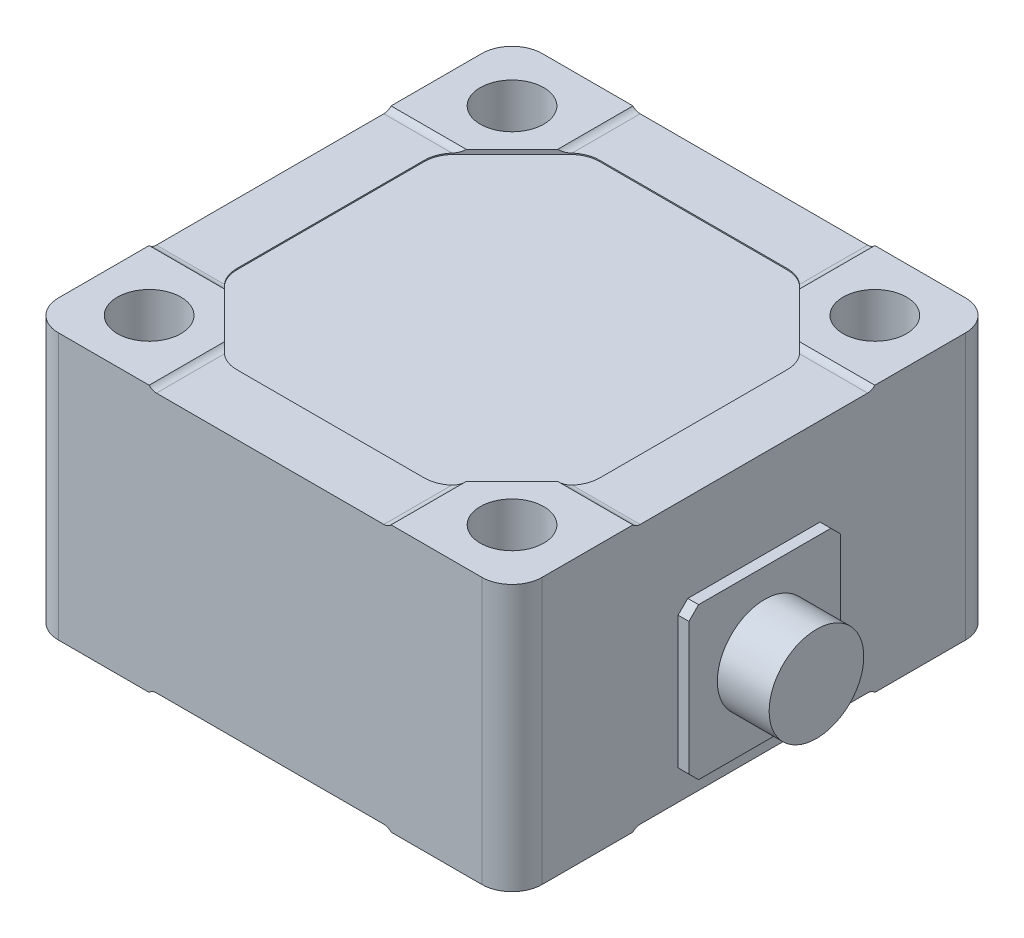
ISO-10303-21;
HEADER;
FILE_DESCRIPTION(('STEP AP214'),'2;1');
FILE_NAME('part.step','',(''),(''),'','','');
FILE_SCHEMA(('AUTOMOTIVE_DESIGN { 1 0 10303 214 1 1 1 1 }'));
ENDSEC;
DATA;
#1=APPLICATION_CONTEXT('core data for automotive mechanical design processes');
#2=APPLICATION_PROTOCOL_DEFINITION('international standard','automotive_design',2000,#1);
#3=PRODUCT_CONTEXT('',#1,'mechanical');
#4=PRODUCT('Part','Part','',(#3));
#5=PRODUCT_RELATED_PRODUCT_CATEGORY('part','',(#4));
#6=PRODUCT_DEFINITION_FORMATION('','',#4);
#7=PRODUCT_DEFINITION_CONTEXT('part definition',#1,'design');
#8=PRODUCT_DEFINITION('design','',#6,#7);
#9=PRODUCT_DEFINITION_SHAPE('','',#8);
#10=(LENGTH_UNIT() NAMED_UNIT(*) SI_UNIT(.MILLI.,.METRE.));
#11=(NAMED_UNIT(*) PLANE_ANGLE_UNIT() SI_UNIT($,.RADIAN.));
#12=(NAMED_UNIT(*) SI_UNIT($,.STERADIAN.) SOLID_ANGLE_UNIT());
#13=UNCERTAINTY_MEASURE_WITH_UNIT(LENGTH_MEASURE(1.E-05),#10,'distance_accuracy_value','');
#14=(GEOMETRIC_REPRESENTATION_CONTEXT(3) GLOBAL_UNCERTAINTY_ASSIGNED_CONTEXT((#13)) GLOBAL_UNIT_ASSIGNED_CONTEXT((#10,
#11,#12)) REPRESENTATION_CONTEXT('',''));
#15=CARTESIAN_POINT('',(0.,0.,0.));
#16=DIRECTION('',(0.,0.,1.));
#17=DIRECTION('',(1.,0.,0.));
#18=AXIS2_PLACEMENT_3D('',#15,#16,#17);
#19=CARTESIAN_POINT('',(47.9552,15.621,0.));
#20=DIRECTION('',(1.,0.,0.));
#21=DIRECTION('',(0.,0.,-1.));
#22=AXIS2_PLACEMENT_3D('',#19,#20,#21);
#23=PLANE('',#22);
#24=CARTESIAN_POINT('',(47.9552,15.621,0.));
#25=DIRECTION('',(-1.,0.,0.));
#26=DIRECTION('',(0.,0.,1.));
#27=AXIS2_PLACEMENT_3D('',#24,#25,#26);
#28=CIRCLE('',#27,7.4549);
#29=CARTESIAN_POINT('',(47.9552,15.621,7.4549));
#30=VERTEX_POINT('',#29);
#31=EDGE_CURVE('E1654',#30,#30,#28,.T.);
#32=ORIENTED_EDGE('',*,*,#31,.F.);
#33=EDGE_LOOP('',(#32));
#34=FACE_BOUND('',#33,.T.);
#35=ADVANCED_FACE('F16',(#34),#23,.T.);
#36=CARTESIAN_POINT('',(-23.8125,0.952499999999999,-14.76375));
#37=DIRECTION('',(0.,0.,1.));
#38=DIRECTION('',(1.,0.,0.));
#39=AXIS2_PLACEMENT_3D('',#36,#37,#38);
#40=CYLINDRICAL_SURFACE('',#39,4.7625);
#41=CARTESIAN_POINT('',(-23.8125000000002,0.952500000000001,14.7637499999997));
#42=DIRECTION('',(0.,0.707106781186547,0.707106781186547));
#43=DIRECTION('',(0.,-0.707106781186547,0.707106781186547));
#44=AXIS2_PLACEMENT_3D('',#41,#42,#43);
#45=ELLIPSE('',#44,6.73519209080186,4.7625);
#46=CARTESIAN_POINT('',(-28.5682218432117,1.2065,14.5097499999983));
#47=VERTEX_POINT('',#46);
#48=CARTESIAN_POINT('',(-28.5750000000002,0.9525,14.7637499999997));
#49=VERTEX_POINT('',#48);
#50=EDGE_CURVE('E495',#47,#49,#45,.T.);
#51=ORIENTED_EDGE('',*,*,#50,.T.);
#52=DIRECTION('',(0.,0.,-1.));
#53=VECTOR('',#52,1.);
#54=CARTESIAN_POINT('',(-28.575,0.952499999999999,-14.76375));
#55=LINE('',#54,#53);
#56=CARTESIAN_POINT('',(-28.575,0.9525,-14.76375));
#57=VERTEX_POINT('',#56);
#58=EDGE_CURVE('E492',#57,#49,#55,.F.);
#59=ORIENTED_EDGE('',*,*,#58,.F.);
#60=CARTESIAN_POINT('',(-23.8125,0.952500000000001,-14.76375));
#61=DIRECTION('',(0.,-0.707106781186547,0.707106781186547));
#62=DIRECTION('',(0.,-0.707106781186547,-0.707106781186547));
#63=AXIS2_PLACEMENT_3D('',#60,#61,#62);
#64=ELLIPSE('',#63,6.73519209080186,4.7625);
#65=CARTESIAN_POINT('',(-28.5682218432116,1.2065,-14.50975));
#66=VERTEX_POINT('',#65);
#67=EDGE_CURVE('E19',#66,#57,#64,.T.);
#68=ORIENTED_EDGE('',*,*,#67,.F.);
#69=DIRECTION('',(0.,0.,1.));
#70=VECTOR('',#69,1.);
#71=CARTESIAN_POINT('',(-28.5682218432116,1.2065,0.));
#72=LINE('',#71,#70);
#73=EDGE_CURVE('E1653',#66,#47,#72,.T.);
#74=ORIENTED_EDGE('',*,*,#73,.T.);
#75=EDGE_LOOP('',(#51,#59,#68,#74));
#76=FACE_BOUND('',#75,.T.);
#77=ADVANCED_FACE('F493',(#76),#40,.F.);
#78=CARTESIAN_POINT('',(23.8125,0.952499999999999,-14.7637499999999));
#79=DIRECTION('',(0.,0.,-1.));
#80=DIRECTION('',(-1.,0.,0.));
#81=AXIS2_PLACEMENT_3D('',#78,#79,#80);
#82=CYLINDRICAL_SURFACE('',#81,4.7625);
#83=CARTESIAN_POINT('',(23.8125,0.952500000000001,-14.7637499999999));
#84=DIRECTION('',(0.,0.707106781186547,-0.707106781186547));
#85=DIRECTION('',(0.,-0.707106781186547,-0.707106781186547));
#86=AXIS2_PLACEMENT_3D('',#83,#84,#85);
#87=ELLIPSE('',#86,6.73519209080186,4.7625);
#88=CARTESIAN_POINT('',(28.5682218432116,1.2065,-14.5097499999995));
#89=VERTEX_POINT('',#88);
#90=CARTESIAN_POINT('',(28.575,0.952500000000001,-14.7637499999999));
#91=VERTEX_POINT('',#90);
#92=EDGE_CURVE('E1412',#89,#91,#87,.T.);
#93=ORIENTED_EDGE('',*,*,#92,.T.);
#94=DIRECTION('',(0.,0.,1.));
#95=VECTOR('',#94,1.);
#96=CARTESIAN_POINT('',(28.575,0.952499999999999,-14.7637499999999));
#97=LINE('',#96,#95);
#98=CARTESIAN_POINT('',(28.575,0.952499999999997,14.76375));
#99=VERTEX_POINT('',#98);
#100=EDGE_CURVE('E1641',#99,#91,#97,.F.);
#101=ORIENTED_EDGE('',*,*,#100,.F.);
#102=CARTESIAN_POINT('',(23.8125,0.952500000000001,14.76375));
#103=DIRECTION('',(0.,-0.707106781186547,-0.707106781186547));
#104=DIRECTION('',(0.,-0.707106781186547,0.707106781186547));
#105=AXIS2_PLACEMENT_3D('',#102,#103,#104);
#106=ELLIPSE('',#105,6.73519209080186,4.7625);
#107=CARTESIAN_POINT('',(28.5682218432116,1.2065,14.50975));
#108=VERTEX_POINT('',#107);
#109=EDGE_CURVE('E490',#108,#99,#106,.T.);
#110=ORIENTED_EDGE('',*,*,#109,.F.);
#111=DIRECTION('',(0.,0.,1.));
#112=VECTOR('',#111,1.);
#113=CARTESIAN_POINT('',(28.5682218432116,1.2065,0.));
#114=LINE('',#113,#112);
#115=EDGE_CURVE('E1656',#108,#89,#114,.F.);
#116=ORIENTED_EDGE('',*,*,#115,.T.);
#117=EDGE_LOOP('',(#93,#101,#110,#116));
#118=FACE_BOUND('',#117,.T.);
#119=ADVANCED_FACE('F540',(#118),#82,.F.);
#120=CARTESIAN_POINT('',(47.9552,15.621,0.));
#121=DIRECTION('',(-1.,0.,0.));
#122=DIRECTION('',(0.,0.,1.));
#123=AXIS2_PLACEMENT_3D('',#120,#121,#122);
#124=CYLINDRICAL_SURFACE('',#123,7.4549);
#125=ORIENTED_EDGE('',*,*,#31,.T.);
#126=EDGE_LOOP('',(#125));
#127=FACE_BOUND('',#126,.T.);
#128=CARTESIAN_POINT('',(39.8018,15.621,0.));
#129=DIRECTION('',(-1.,0.,0.));
#130=DIRECTION('',(0.,0.,1.));
#131=AXIS2_PLACEMENT_3D('',#128,#129,#130);
#132=CIRCLE('',#131,7.4549);
#133=CARTESIAN_POINT('',(39.8018,15.621,7.4549));
#134=VERTEX_POINT('',#133);
#135=EDGE_CURVE('E1627',#134,#134,#132,.F.);
#136=ORIENTED_EDGE('',*,*,#135,.T.);
#137=EDGE_LOOP('',(#136));
#138=FACE_BOUND('',#137,.T.);
#139=ADVANCED_FACE('F536',(#127,#138),#124,.T.);
#140=CARTESIAN_POINT('',(0.,1.2065,0.));
#141=DIRECTION('',(0.,1.,0.));
#142=DIRECTION('',(0.,0.,1.));
#143=AXIS2_PLACEMENT_3D('',#140,#141,#142);
#144=PLANE('',#143);
#145=ORIENTED_EDGE('',*,*,#73,.F.);
#146=CARTESIAN_POINT('',(-23.8125,1.2065,-14.76375));
#147=DIRECTION('',(0.,-1.,0.));
#148=DIRECTION('',(0.,0.,-1.));
#149=AXIS2_PLACEMENT_3D('',#146,#147,#148);
#150=CIRCLE('',#149,4.7625);
#151=CARTESIAN_POINT('',(-27.1800960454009,1.20649999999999,-18.1313460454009));
#152=VERTEX_POINT('',#151);
#153=EDGE_CURVE('E489',#66,#152,#150,.T.);
#154=ORIENTED_EDGE('',*,*,#153,.T.);
#155=DIRECTION('',(0.707106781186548,0.,-0.707106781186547));
#156=VECTOR('',#155,1.);
#157=CARTESIAN_POINT('',(-18.1313460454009,1.20649999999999,-27.1800960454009));
#158=LINE('',#157,#156);
#159=CARTESIAN_POINT('',(-18.1313460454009,1.20649999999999,-27.1800960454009));
#160=VERTEX_POINT('',#159);
#161=EDGE_CURVE('E989',#160,#152,#158,.F.);
#162=ORIENTED_EDGE('',*,*,#161,.F.);
#163=CARTESIAN_POINT('',(-14.76375,1.2065,-23.8125));
#164=DIRECTION('',(0.,-1.,0.));
#165=DIRECTION('',(0.,0.,-1.));
#166=AXIS2_PLACEMENT_3D('',#163,#164,#165);
#167=CIRCLE('',#166,4.7625);
#168=CARTESIAN_POINT('',(-14.76375,1.2065,-28.575));
#169=VERTEX_POINT('',#168);
#170=EDGE_CURVE('E979',#160,#169,#167,.T.);
#171=ORIENTED_EDGE('',*,*,#170,.T.);
#172=DIRECTION('',(1.,0.,0.));
#173=VECTOR('',#172,1.);
#174=CARTESIAN_POINT('',(-14.76375,1.2065,-28.575));
#175=LINE('',#174,#173);
#176=CARTESIAN_POINT('',(14.7637500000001,1.2065,-28.575));
#177=VERTEX_POINT('',#176);
#178=EDGE_CURVE('E975',#177,#169,#175,.F.);
#179=ORIENTED_EDGE('',*,*,#178,.F.);
#180=CARTESIAN_POINT('',(14.7637500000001,1.2065,-23.8125));
#181=DIRECTION('',(0.,-1.,0.));
#182=DIRECTION('',(0.,0.,-1.));
#183=AXIS2_PLACEMENT_3D('',#180,#181,#182);
#184=CIRCLE('',#183,4.7625);
#185=CARTESIAN_POINT('',(18.131346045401,1.20649999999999,-27.1800960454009));
#186=VERTEX_POINT('',#185);
#187=EDGE_CURVE('E971',#177,#186,#184,.T.);
#188=ORIENTED_EDGE('',*,*,#187,.T.);
#189=DIRECTION('',(0.707106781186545,0.,0.70710678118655));
#190=VECTOR('',#189,1.);
#191=CARTESIAN_POINT('',(27.180096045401,1.20649999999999,-18.1313460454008));
#192=LINE('',#191,#190);
#193=CARTESIAN_POINT('',(27.180096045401,1.20649999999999,-18.1313460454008));
#194=VERTEX_POINT('',#193);
#195=EDGE_CURVE('E520',#194,#186,#192,.F.);
#196=ORIENTED_EDGE('',*,*,#195,.F.);
#197=CARTESIAN_POINT('',(23.8125000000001,1.2065,-14.7637499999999));
#198=DIRECTION('',(0.,-1.,0.));
#199=DIRECTION('',(0.,0.,-1.));
#200=AXIS2_PLACEMENT_3D('',#197,#198,#199);
#201=CIRCLE('',#200,4.7625);
#202=EDGE_CURVE('E1410',#194,#89,#201,.T.);
#203=ORIENTED_EDGE('',*,*,#202,.T.);
#204=ORIENTED_EDGE('',*,*,#115,.F.);
#205=CARTESIAN_POINT('',(23.8125,1.2065,14.76375));
#206=DIRECTION('',(0.,-1.,0.));
#207=DIRECTION('',(0.,0.,-1.));
#208=AXIS2_PLACEMENT_3D('',#205,#206,#207);
#209=CIRCLE('',#208,4.7625);
#210=CARTESIAN_POINT('',(27.1800960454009,1.20649999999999,18.1313460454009));
#211=VERTEX_POINT('',#210);
#212=EDGE_CURVE('E1639',#108,#211,#209,.T.);
#213=ORIENTED_EDGE('',*,*,#212,.T.);
#214=DIRECTION('',(-0.707106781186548,0.,0.707106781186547));
#215=VECTOR('',#214,1.);
#216=CARTESIAN_POINT('',(18.1313460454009,1.20649999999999,27.1800960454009));
#217=LINE('',#216,#215);
#218=CARTESIAN_POINT('',(18.1313460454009,1.20649999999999,27.1800960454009));
#219=VERTEX_POINT('',#218);
#220=EDGE_CURVE('E998',#219,#211,#217,.F.);
#221=ORIENTED_EDGE('',*,*,#220,.F.);
#222=CARTESIAN_POINT('',(14.76375,1.2065,23.8125));
#223=DIRECTION('',(0.,-1.,0.));
#224=DIRECTION('',(0.,0.,-1.));
#225=AXIS2_PLACEMENT_3D('',#222,#223,#224);
#226=CIRCLE('',#225,4.7625);
#227=CARTESIAN_POINT('',(14.76375,1.2065,28.575));
#228=VERTEX_POINT('',#227);
#229=EDGE_CURVE('E505',#219,#228,#226,.T.);
#230=ORIENTED_EDGE('',*,*,#229,.T.);
#231=DIRECTION('',(-1.,0.,0.));
#232=VECTOR('',#231,1.);
#233=CARTESIAN_POINT('',(14.76375,1.2065,28.575));
#234=LINE('',#233,#232);
#235=CARTESIAN_POINT('',(-14.7637500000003,1.2065,28.5749999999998));
#236=VERTEX_POINT('',#235);
#237=EDGE_CURVE('E1096',#236,#228,#234,.F.);
#238=ORIENTED_EDGE('',*,*,#237,.F.);
#239=CARTESIAN_POINT('',(-14.7637500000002,1.2065,23.8124999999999));
#240=DIRECTION('',(0.,-1.,0.));
#241=DIRECTION('',(0.,0.,-1.));
#242=AXIS2_PLACEMENT_3D('',#239,#240,#241);
#243=CIRCLE('',#242,4.7625);
#244=CARTESIAN_POINT('',(-18.1313460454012,1.2065,27.1800960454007));
#245=VERTEX_POINT('',#244);
#246=EDGE_CURVE('E1101',#236,#245,#243,.T.);
#247=ORIENTED_EDGE('',*,*,#246,.T.);
#248=DIRECTION('',(-0.70710678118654,0.,-0.707106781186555));
#249=VECTOR('',#248,1.);
#250=CARTESIAN_POINT('',(-27.1800960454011,1.2065,18.1313460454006));
#251=LINE('',#250,#249);
#252=CARTESIAN_POINT('',(-27.1800960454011,1.2065,18.1313460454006));
#253=VERTEX_POINT('',#252);
#254=EDGE_CURVE('E1053',#253,#245,#251,.F.);
#255=ORIENTED_EDGE('',*,*,#254,.F.);
#256=CARTESIAN_POINT('',(-23.8125000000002,1.2065,14.7637499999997));
#257=DIRECTION('',(0.,-1.,0.));
#258=DIRECTION('',(0.,0.,-1.));
#259=AXIS2_PLACEMENT_3D('',#256,#257,#258);
#260=CIRCLE('',#259,4.7625);
#261=EDGE_CURVE('E1650',#253,#47,#260,.T.);
#262=ORIENTED_EDGE('',*,*,#261,.T.);
#263=EDGE_LOOP('',(#145,#154,#162,#171,#179,#188,#196,#203,#204,#213,#221,#230,#238,#247,#255,#262));
#264=FACE_BOUND('',#263,.T.);
#265=ADVANCED_FACE('F532',(#264),#144,.F.);
#266=CARTESIAN_POINT('',(-23.8125000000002,41.91,14.7637499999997));
#267=DIRECTION('',(0.,-1.,0.));
#268=DIRECTION('',(0.,0.,-1.));
#269=AXIS2_PLACEMENT_3D('',#266,#267,#268);
#270=CYLINDRICAL_SURFACE('',#269,4.7625);
#271=ORIENTED_EDGE('',*,*,#261,.F.);
#272=DIRECTION('',(0.,1.,0.));
#273=VECTOR('',#272,1.);
#274=CARTESIAN_POINT('',(-27.1800960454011,41.91,18.1313460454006));
#275=LINE('',#274,#273);
#276=CARTESIAN_POINT('',(-27.1800960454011,0.492433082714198,18.1313460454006));
#277=VERTEX_POINT('',#276);
#278=EDGE_CURVE('E1054',#277,#253,#275,.T.);
#279=ORIENTED_EDGE('',*,*,#278,.F.);
#280=CARTESIAN_POINT('',(-27.3841723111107,0.508000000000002,17.9140774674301));
#281=CARTESIAN_POINT('',(-27.3761372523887,0.508000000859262,17.9231872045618));
#282=CARTESIAN_POINT('',(-27.3680673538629,0.507918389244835,17.9322661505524));
#283=CARTESIAN_POINT('',(-27.35180581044,0.507594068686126,17.9504206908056));
#284=CARTESIAN_POINT('',(-27.3436137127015,0.507350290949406,17.9594958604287));
#285=CARTESIAN_POINT('',(-27.3271069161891,0.506701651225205,17.9776410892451));
#286=CARTESIAN_POINT('',(-27.318791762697,0.506295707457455,17.9867106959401));
#287=CARTESIAN_POINT('',(-27.3020380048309,0.505322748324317,18.0048430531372));
#288=CARTESIAN_POINT('',(-27.2935989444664,0.504754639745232,18.0139053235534));
#289=CARTESIAN_POINT('',(-27.276596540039,0.503457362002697,18.0320212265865));
#290=CARTESIAN_POINT('',(-27.2680327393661,0.502727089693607,18.0410743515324));
#291=CARTESIAN_POINT('',(-27.2507800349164,0.50110549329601,18.0591701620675));
#292=CARTESIAN_POINT('',(-27.2420906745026,0.500213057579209,18.0682123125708));
#293=CARTESIAN_POINT('',(-27.224586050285,0.498267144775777,18.0862843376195));
#294=CARTESIAN_POINT('',(-27.2157703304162,0.497212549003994,18.0953136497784));
#295=CARTESIAN_POINT('',(-27.1980121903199,0.494942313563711,18.1133581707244));
#296=CARTESIAN_POINT('',(-27.1890693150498,0.493725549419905,18.1223727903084));
#297=CARTESIAN_POINT('',(-27.1800960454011,0.492433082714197,18.1313460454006));
#298=B_SPLINE_CURVE_WITH_KNOTS('',3,(#280,#281,#282,#283,#284,#285,#286,#287,#288,#289,#290,
#291,#292,#293,#294,#295,#296,#297),.UNSPECIFIED.,.F.,.F.,(4,2,2,2,2,2,2,2,4),(0.,
0.0364405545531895,0.0731236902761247,0.110055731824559,0.147242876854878,0.184691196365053,
0.222406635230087,0.260395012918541,0.298662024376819),.UNSPECIFIED.);
#299=CARTESIAN_POINT('',(-27.3841723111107,0.508000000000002,17.9140774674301));
#300=VERTEX_POINT('',#299);
#301=EDGE_CURVE('E514',#277,#300,#298,.F.);
#302=ORIENTED_EDGE('',*,*,#301,.T.);
#303=CARTESIAN_POINT('',(-23.8125000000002,0.508000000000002,14.7637499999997));
#304=DIRECTION('',(0.,-1.,0.));
#305=DIRECTION('',(0.,0.,-1.));
#306=AXIS2_PLACEMENT_3D('',#303,#304,#305);
#307=CIRCLE('',#306,4.7625);
#308=CARTESIAN_POINT('',(-28.5750000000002,0.508000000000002,14.7637499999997));
#309=VERTEX_POINT('',#308);
#310=EDGE_CURVE('E1267',#300,#309,#307,.T.);
#311=ORIENTED_EDGE('',*,*,#310,.T.);
#312=DIRECTION('',(0.,1.,0.));
#313=VECTOR('',#312,1.);
#314=CARTESIAN_POINT('',(-28.5750000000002,5.715,14.7637499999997));
#315=LINE('',#314,#313);
#316=EDGE_CURVE('E499',#49,#309,#315,.F.);
#317=ORIENTED_EDGE('',*,*,#316,.F.);
#318=ORIENTED_EDGE('',*,*,#50,.F.);
#319=EDGE_LOOP('',(#271,#279,#302,#311,#317,#318));
#320=FACE_BOUND('',#319,.T.);
#321=ADVANCED_FACE('F522',(#320),#270,.F.);
#322=CARTESIAN_POINT('',(-28.575,5.715,-14.76375));
#323=DIRECTION('',(1.,0.,0.));
#324=DIRECTION('',(0.,0.,-1.));
#325=AXIS2_PLACEMENT_3D('',#322,#323,#324);
#326=PLANE('',#325);
#327=ORIENTED_EDGE('',*,*,#316,.T.);
#328=DIRECTION('',(0.,0.,1.));
#329=VECTOR('',#328,1.);
#330=CARTESIAN_POINT('',(-28.5750000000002,0.508,0.));
#331=LINE('',#330,#329);
#332=CARTESIAN_POINT('',(-28.5750000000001,0.508000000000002,-14.76375));
#333=VERTEX_POINT('',#332);
#334=EDGE_CURVE('E503',#309,#333,#331,.F.);
#335=ORIENTED_EDGE('',*,*,#334,.T.);
#336=DIRECTION('',(0.,-1.,0.));
#337=VECTOR('',#336,1.);
#338=CARTESIAN_POINT('',(-28.575,41.91,-14.76375));
#339=LINE('',#338,#337);
#340=EDGE_CURVE('E486',#333,#57,#339,.F.);
#341=ORIENTED_EDGE('',*,*,#340,.T.);
#342=ORIENTED_EDGE('',*,*,#58,.T.);
#343=EDGE_LOOP('',(#327,#335,#341,#342));
#344=FACE_BOUND('',#343,.T.);
#345=ADVANCED_FACE('F501',(#344),#326,.T.);
#346=CARTESIAN_POINT('',(-23.8125,41.91,-14.76375));
#347=DIRECTION('',(0.,-1.,0.));
#348=DIRECTION('',(0.,0.,-1.));
#349=AXIS2_PLACEMENT_3D('',#346,#347,#348);
#350=CYLINDRICAL_SURFACE('',#349,4.7625);
#351=ORIENTED_EDGE('',*,*,#153,.F.);
#352=ORIENTED_EDGE('',*,*,#67,.T.);
#353=ORIENTED_EDGE('',*,*,#340,.F.);
#354=CARTESIAN_POINT('',(-23.8125,0.508000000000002,-14.76375));
#355=DIRECTION('',(0.,-1.,0.));
#356=DIRECTION('',(0.,0.,-1.));
#357=AXIS2_PLACEMENT_3D('',#354,#355,#356);
#358=CIRCLE('',#357,4.7625);
#359=CARTESIAN_POINT('',(-27.3841723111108,0.508000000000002,-17.9140774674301));
#360=VERTEX_POINT('',#359);
#361=EDGE_CURVE('E1264',#333,#360,#358,.T.);
#362=ORIENTED_EDGE('',*,*,#361,.T.);
#363=CARTESIAN_POINT('',(-27.1800960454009,0.492433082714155,-18.1313460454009));
#364=CARTESIAN_POINT('',(-27.1890693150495,0.493725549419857,-18.1223727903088));
#365=CARTESIAN_POINT('',(-27.1980121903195,0.494942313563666,-18.1133581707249));
#366=CARTESIAN_POINT('',(-27.2157703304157,0.497212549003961,-18.0953136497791));
#367=CARTESIAN_POINT('',(-27.2245860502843,0.498267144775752,-18.0862843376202));
#368=CARTESIAN_POINT('',(-27.2420906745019,0.500213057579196,-18.0682123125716));
#369=CARTESIAN_POINT('',(-27.2507800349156,0.501105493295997,-18.0591701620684));
#370=CARTESIAN_POINT('',(-27.2680327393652,0.502727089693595,-18.0410743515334));
#371=CARTESIAN_POINT('',(-27.2765965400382,0.503457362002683,-18.0320212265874));
#372=CARTESIAN_POINT('',(-27.2935989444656,0.504754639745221,-18.0139053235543));
#373=CARTESIAN_POINT('',(-27.3020380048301,0.50532274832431,-18.0048430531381));
#374=CARTESIAN_POINT('',(-27.3187917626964,0.506295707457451,-17.9867106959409));
#375=CARTESIAN_POINT('',(-27.3271069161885,0.506701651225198,-17.9776410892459));
#376=CARTESIAN_POINT('',(-27.343613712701,0.5073502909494,-17.9594958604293));
#377=CARTESIAN_POINT('',(-27.3518058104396,0.507594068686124,-17.9504206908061));
#378=CARTESIAN_POINT('',(-27.3680673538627,0.507918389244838,-17.9322661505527));
#379=CARTESIAN_POINT('',(-27.3761372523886,0.508000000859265,-17.923187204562));
#380=CARTESIAN_POINT('',(-27.3841723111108,0.508000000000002,-17.9140774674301));
#381=B_SPLINE_CURVE_WITH_KNOTS('',3,(#363,#364,#365,#366,#367,#368,#369,#370,#371,#372,#373,
#374,#375,#376,#377,#378,#379,#380),.UNSPECIFIED.,.F.,.F.,(4,2,2,2,2,2,2,2,4),(0.,
0.038267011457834,0.0762553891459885,0.113970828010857,0.15141914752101,0.188606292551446,
0.22553833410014,0.262221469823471,0.298662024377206),.UNSPECIFIED.);
#382=CARTESIAN_POINT('',(-27.1800960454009,0.492433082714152,-18.1313460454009));
#383=VERTEX_POINT('',#382);
#384=EDGE_CURVE('E509',#360,#383,#381,.F.);
#385=ORIENTED_EDGE('',*,*,#384,.T.);
#386=DIRECTION('',(0.,1.,0.));
#387=VECTOR('',#386,1.);
#388=CARTESIAN_POINT('',(-27.1800960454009,41.91,-18.1313460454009));
#389=LINE('',#388,#387);
#390=EDGE_CURVE('E985',#152,#383,#389,.F.);
#391=ORIENTED_EDGE('',*,*,#390,.F.);
#392=EDGE_LOOP('',(#351,#352,#353,#362,#385,#391));
#393=FACE_BOUND('',#392,.T.);
#394=ADVANCED_FACE('F484',(#393),#350,.F.);
#395=CARTESIAN_POINT('',(14.76375,41.91,23.8125));
#396=DIRECTION('',(0.,-1.,0.));
#397=DIRECTION('',(0.,0.,-1.));
#398=AXIS2_PLACEMENT_3D('',#395,#396,#397);
#399=CYLINDRICAL_SURFACE('',#398,4.7625);
#400=ORIENTED_EDGE('',*,*,#229,.F.);
#401=DIRECTION('',(0.,1.,0.));
#402=VECTOR('',#401,1.);
#403=CARTESIAN_POINT('',(18.1313460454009,41.91,27.1800960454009));
#404=LINE('',#403,#402);
#405=CARTESIAN_POINT('',(18.1313460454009,0.492433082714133,27.1800960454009));
#406=VERTEX_POINT('',#405);
#407=EDGE_CURVE('E999',#406,#219,#404,.T.);
#408=ORIENTED_EDGE('',*,*,#407,.F.);
#409=CARTESIAN_POINT('',(17.91407746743,0.508000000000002,27.3841723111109));
#410=CARTESIAN_POINT('',(17.9231872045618,0.508000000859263,27.3761372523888));
#411=CARTESIAN_POINT('',(17.9322661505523,0.507918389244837,27.368067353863));
#412=CARTESIAN_POINT('',(17.9504206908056,0.507594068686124,27.3518058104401));
#413=CARTESIAN_POINT('',(17.9594958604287,0.507350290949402,27.3436137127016));
#414=CARTESIAN_POINT('',(17.9776410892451,0.506701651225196,27.3271069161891));
#415=CARTESIAN_POINT('',(17.9867106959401,0.506295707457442,27.3187917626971));
#416=CARTESIAN_POINT('',(18.0048430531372,0.505322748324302,27.3020380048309));
#417=CARTESIAN_POINT('',(18.0139053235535,0.504754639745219,27.2935989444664));
#418=CARTESIAN_POINT('',(18.0320212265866,0.503457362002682,27.276596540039));
#419=CARTESIAN_POINT('',(18.0410743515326,0.502727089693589,27.268032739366));
#420=CARTESIAN_POINT('',(18.0591701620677,0.501105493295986,27.2507800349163));
#421=CARTESIAN_POINT('',(18.0682123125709,0.500213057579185,27.2420906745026));
#422=CARTESIAN_POINT('',(18.0862843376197,0.498267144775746,27.2245860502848));
#423=CARTESIAN_POINT('',(18.0953136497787,0.497212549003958,27.2157703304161));
#424=CARTESIAN_POINT('',(18.1133581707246,0.494942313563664,27.1980121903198));
#425=CARTESIAN_POINT('',(18.1223727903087,0.493725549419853,27.1890693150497));
#426=CARTESIAN_POINT('',(18.1313460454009,0.492433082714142,27.1800960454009));
#427=B_SPLINE_CURVE_WITH_KNOTS('',3,(#409,#410,#411,#412,#413,#414,#415,#416,#417,#418,#419,
#420,#421,#422,#423,#424,#425,#426),.UNSPECIFIED.,.F.,.F.,(4,2,2,2,2,2,2,2,4),(0.,
0.0364405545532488,0.0731236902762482,0.110055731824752,0.147242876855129,0.184691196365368,
0.222406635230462,0.26039501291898,0.298662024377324),.UNSPECIFIED.);
#428=CARTESIAN_POINT('',(17.91407746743,0.508000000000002,27.3841723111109));
#429=VERTEX_POINT('',#428);
#430=EDGE_CURVE('E1085',#406,#429,#427,.F.);
#431=ORIENTED_EDGE('',*,*,#430,.T.);
#432=CARTESIAN_POINT('',(14.76375,0.508000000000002,23.8125));
#433=DIRECTION('',(0.,-1.,0.));
#434=DIRECTION('',(0.,0.,-1.));
#435=AXIS2_PLACEMENT_3D('',#432,#433,#434);
#436=CIRCLE('',#435,4.7625);
#437=CARTESIAN_POINT('',(14.76375,0.508000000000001,28.575));
#438=VERTEX_POINT('',#437);
#439=EDGE_CURVE('E1261',#429,#438,#436,.T.);
#440=ORIENTED_EDGE('',*,*,#439,.T.);
#441=DIRECTION('',(0.,1.,0.));
#442=VECTOR('',#441,1.);
#443=CARTESIAN_POINT('',(14.76375,5.715,28.575));
#444=LINE('',#443,#442);
#445=EDGE_CURVE('E1089',#228,#438,#444,.F.);
#446=ORIENTED_EDGE('',*,*,#445,.F.);
#447=EDGE_LOOP('',(#400,#408,#431,#440,#446));
#448=FACE_BOUND('',#447,.T.);
#449=ADVANCED_FACE('F1079',(#448),#399,.F.);
#450=CARTESIAN_POINT('',(14.76375,5.715,28.575));
#451=DIRECTION('',(0.,0.,-1.));
#452=DIRECTION('',(-1.,0.,0.));
#453=AXIS2_PLACEMENT_3D('',#450,#451,#452);
#454=PLANE('',#453);
#455=ORIENTED_EDGE('',*,*,#445,.T.);
#456=DIRECTION('',(1.,0.,0.));
#457=VECTOR('',#456,1.);
#458=CARTESIAN_POINT('',(0.,0.508,28.575));
#459=LINE('',#458,#457);
#460=CARTESIAN_POINT('',(-14.7637500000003,0.508000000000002,28.5749999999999));
#461=VERTEX_POINT('',#460);
#462=EDGE_CURVE('E1260',#438,#461,#459,.F.);
#463=ORIENTED_EDGE('',*,*,#462,.T.);
#464=DIRECTION('',(0.,-1.,0.));
#465=VECTOR('',#464,1.);
#466=CARTESIAN_POINT('',(-14.7637500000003,41.91,28.5749999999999));
#467=LINE('',#466,#465);
#468=EDGE_CURVE('E1062',#461,#236,#467,.F.);
#469=ORIENTED_EDGE('',*,*,#468,.T.);
#470=ORIENTED_EDGE('',*,*,#237,.T.);
#471=EDGE_LOOP('',(#455,#463,#469,#470));
#472=FACE_BOUND('',#471,.T.);
#473=ADVANCED_FACE('F1075',(#472),#454,.T.);
#474=CARTESIAN_POINT('',(-14.7637500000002,41.91,23.8124999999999));
#475=DIRECTION('',(0.,-1.,0.));
#476=DIRECTION('',(0.,0.,-1.));
#477=AXIS2_PLACEMENT_3D('',#474,#475,#476);
#478=CYLINDRICAL_SURFACE('',#477,4.7625);
#479=ORIENTED_EDGE('',*,*,#246,.F.);
#480=ORIENTED_EDGE('',*,*,#468,.F.);
#481=CARTESIAN_POINT('',(-14.7637500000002,0.508000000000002,23.8124999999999));
#482=DIRECTION('',(0.,-1.,0.));
#483=DIRECTION('',(0.,0.,-1.));
#484=AXIS2_PLACEMENT_3D('',#481,#482,#483);
#485=CIRCLE('',#484,4.7625);
#486=CARTESIAN_POINT('',(-17.9140774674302,0.508000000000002,27.3841723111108));
#487=VERTEX_POINT('',#486);
#488=EDGE_CURVE('E1257',#461,#487,#485,.T.);
#489=ORIENTED_EDGE('',*,*,#488,.T.);
#490=CARTESIAN_POINT('',(-18.1313460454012,0.492433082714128,27.1800960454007));
#491=CARTESIAN_POINT('',(-18.1223727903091,0.493725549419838,27.1890693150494));
#492=CARTESIAN_POINT('',(-18.1133581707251,0.49494231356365,27.1980121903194));
#493=CARTESIAN_POINT('',(-18.0953136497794,0.497212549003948,27.2157703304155));
#494=CARTESIAN_POINT('',(-18.0862843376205,0.498267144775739,27.2245860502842));
#495=CARTESIAN_POINT('',(-18.0682123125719,0.500213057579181,27.2420906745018));
#496=CARTESIAN_POINT('',(-18.0591701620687,0.501105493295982,27.2507800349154));
#497=CARTESIAN_POINT('',(-18.0410743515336,0.502727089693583,27.2680327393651));
#498=CARTESIAN_POINT('',(-18.0320212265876,0.503457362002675,27.2765965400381));
#499=CARTESIAN_POINT('',(-18.0139053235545,0.504754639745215,27.2935989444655));
#500=CARTESIAN_POINT('',(-18.0048430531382,0.505322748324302,27.30203800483));
#501=CARTESIAN_POINT('',(-17.986710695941,0.506295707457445,27.3187917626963));
#502=CARTESIAN_POINT('',(-17.977641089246,0.506701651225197,27.3271069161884));
#503=CARTESIAN_POINT('',(-17.9594958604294,0.507350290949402,27.343613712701));
#504=CARTESIAN_POINT('',(-17.9504206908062,0.507594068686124,27.3518058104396));
#505=CARTESIAN_POINT('',(-17.9322661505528,0.507918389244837,27.3680673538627));
#506=CARTESIAN_POINT('',(-17.9231872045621,0.508000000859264,27.3761372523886));
#507=CARTESIAN_POINT('',(-17.9140774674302,0.508000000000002,27.3841723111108));
#508=B_SPLINE_CURVE_WITH_KNOTS('',3,(#490,#491,#492,#493,#494,#495,#496,#497,#498,#499,#500,
#501,#502,#503,#504,#505,#506,#507),.UNSPECIFIED.,.F.,.F.,(4,2,2,2,2,2,2,2,4),(0.,
0.038267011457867,0.0762553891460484,0.113970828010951,0.151419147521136,0.188606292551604,
0.225538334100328,0.262221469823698,0.298662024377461),.UNSPECIFIED.);
#509=CARTESIAN_POINT('',(-18.1313460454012,0.492433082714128,27.1800960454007));
#510=VERTEX_POINT('',#509);
#511=EDGE_CURVE('E1057',#487,#510,#508,.F.);
#512=ORIENTED_EDGE('',*,*,#511,.T.);
#513=DIRECTION('',(0.,1.,0.));
#514=VECTOR('',#513,1.);
#515=CARTESIAN_POINT('',(-18.1313460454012,41.91,27.1800960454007));
#516=LINE('',#515,#514);
#517=EDGE_CURVE('E1049',#245,#510,#516,.F.);
#518=ORIENTED_EDGE('',*,*,#517,.F.);
#519=EDGE_LOOP('',(#479,#480,#489,#512,#518));
#520=FACE_BOUND('',#519,.T.);
#521=ADVANCED_FACE('F1064',(#520),#478,.F.);
#522=CARTESIAN_POINT('',(-17.9140774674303,-1.016,57.1499999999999));
#523=DIRECTION('',(0.,0.,1.));
#524=DIRECTION('',(1.,0.,0.));
#525=AXIS2_PLACEMENT_3D('',#522,#523,#524);
#526=CYLINDRICAL_SURFACE('',#525,1.524);
#527=DIRECTION('',(0.,0.,1.));
#528=VECTOR('',#527,1.);
#529=CARTESIAN_POINT('',(-17.9140774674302,0.508,0.));
#530=LINE('',#529,#528);
#531=CARTESIAN_POINT('',(-17.9140774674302,0.508000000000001,38.1));
#532=VERTEX_POINT('',#531);
#533=EDGE_CURVE('E1259',#487,#532,#530,.T.);
#534=ORIENTED_EDGE('',*,*,#533,.T.);
#535=CARTESIAN_POINT('',(-17.9140774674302,-1.016,38.1));
#536=DIRECTION('',(0.,0.,1.));
#537=DIRECTION('',(1.,0.,0.));
#538=AXIS2_PLACEMENT_3D('',#535,#536,#537);
#539=CIRCLE('',#538,1.524);
#540=CARTESIAN_POINT('',(-19.0500000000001,0.,38.1));
#541=VERTEX_POINT('',#540);
#542=EDGE_CURVE('E1061',#541,#532,#539,.F.);
#543=ORIENTED_EDGE('',*,*,#542,.F.);
#544=DIRECTION('',(0.,0.,1.));
#545=VECTOR('',#544,1.);
#546=CARTESIAN_POINT('',(-19.0500000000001,0.,33.3375));
#547=LINE('',#546,#545);
#548=CARTESIAN_POINT('',(-19.0500000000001,0.,26.2614420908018));
#549=VERTEX_POINT('',#548);
#550=EDGE_CURVE('E1048',#541,#549,#547,.F.);
#551=ORIENTED_EDGE('',*,*,#550,.T.);
#552=CARTESIAN_POINT('',(-17.9140774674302,-1.016,27.3973646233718));
#553=DIRECTION('',(0.707106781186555,0.,-0.70710678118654));
#554=DIRECTION('',(0.70710678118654,0.,0.707106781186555));
#555=AXIS2_PLACEMENT_3D('',#552,#553,#554);
#556=ELLIPSE('',#555,2.15526146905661,1.524);
#557=EDGE_CURVE('E1052',#510,#549,#556,.F.);
#558=ORIENTED_EDGE('',*,*,#557,.F.);
#559=ORIENTED_EDGE('',*,*,#511,.F.);
#560=EDGE_LOOP('',(#534,#543,#551,#558,#559));
#561=FACE_BOUND('',#560,.T.);
#562=ADVANCED_FACE('F1074',(#561),#526,.F.);
#563=CARTESIAN_POINT('',(-27.1800960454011,41.91,18.1313460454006));
#564=DIRECTION('',(0.707106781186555,0.,-0.70710678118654));
#565=DIRECTION('',(-0.70710678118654,0.,-0.707106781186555));
#566=AXIS2_PLACEMENT_3D('',#563,#564,#565);
#567=PLANE('',#566);
#568=DIRECTION('',(-0.70710678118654,0.,-0.707106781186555));
#569=VECTOR('',#568,1.);
#570=CARTESIAN_POINT('',(-19.0500000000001,0.,26.2614420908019));
#571=LINE('',#570,#569);
#572=CARTESIAN_POINT('',(-26.2614420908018,0.,19.05));
#573=VERTEX_POINT('',#572);
#574=EDGE_CURVE('E1040',#549,#573,#571,.T.);
#575=ORIENTED_EDGE('',*,*,#574,.T.);
#576=CARTESIAN_POINT('',(-27.3973646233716,-1.016,17.9140774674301));
#577=DIRECTION('',(0.707106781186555,0.,-0.70710678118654));
#578=DIRECTION('',(0.70710678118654,0.,0.707106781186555));
#579=AXIS2_PLACEMENT_3D('',#576,#577,#578);
#580=ELLIPSE('',#579,2.15526146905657,1.524);
#581=EDGE_CURVE('E519',#573,#277,#580,.F.);
#582=ORIENTED_EDGE('',*,*,#581,.T.);
#583=ORIENTED_EDGE('',*,*,#278,.T.);
#584=ORIENTED_EDGE('',*,*,#254,.T.);
#585=ORIENTED_EDGE('',*,*,#517,.T.);
#586=ORIENTED_EDGE('',*,*,#557,.T.);
#587=EDGE_LOOP('',(#575,#582,#583,#584,#585,#586));
#588=FACE_BOUND('',#587,.T.);
#589=ADVANCED_FACE('F1743',(#588),#567,.T.);
#590=CARTESIAN_POINT('',(-57.15,-1.016,17.9140774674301));
#591=DIRECTION('',(1.,0.,0.));
#592=DIRECTION('',(0.,0.,-1.));
#593=AXIS2_PLACEMENT_3D('',#590,#591,#592);
#594=CYLINDRICAL_SURFACE('',#593,1.524);
#595=DIRECTION('',(1.,0.,0.));
#596=VECTOR('',#595,1.);
#597=CARTESIAN_POINT('',(0.,0.508,17.9140774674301));
#598=LINE('',#597,#596);
#599=CARTESIAN_POINT('',(-38.1,0.508000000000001,17.9140774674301));
#600=VERTEX_POINT('',#599);
#601=EDGE_CURVE('E959',#600,#300,#598,.T.);
#602=ORIENTED_EDGE('',*,*,#601,.T.);
#603=ORIENTED_EDGE('',*,*,#301,.F.);
#604=ORIENTED_EDGE('',*,*,#581,.F.);
#605=DIRECTION('',(1.,0.,0.));
#606=VECTOR('',#605,1.);
#607=CARTESIAN_POINT('',(-33.3375,0.,19.05));
#608=LINE('',#607,#606);
#609=CARTESIAN_POINT('',(-38.1,0.,19.05));
#610=VERTEX_POINT('',#609);
#611=EDGE_CURVE('E1047',#573,#610,#608,.F.);
#612=ORIENTED_EDGE('',*,*,#611,.T.);
#613=CARTESIAN_POINT('',(-38.1,-1.016,17.9140774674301));
#614=DIRECTION('',(1.,0.,0.));
#615=DIRECTION('',(0.,0.,-1.));
#616=AXIS2_PLACEMENT_3D('',#613,#614,#615);
#617=CIRCLE('',#616,1.524);
#618=EDGE_CURVE('E518',#600,#610,#617,.T.);
#619=ORIENTED_EDGE('',*,*,#618,.F.);
#620=EDGE_LOOP('',(#602,#603,#604,#612,#619));
#621=FACE_BOUND('',#620,.T.);
#622=ADVANCED_FACE('F1030',(#621),#594,.F.);
#623=CARTESIAN_POINT('',(23.8125000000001,41.91,-14.7637499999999));
#624=DIRECTION('',(0.,-1.,0.));
#625=DIRECTION('',(0.,0.,-1.));
#626=AXIS2_PLACEMENT_3D('',#623,#624,#625);
#627=CYLINDRICAL_SURFACE('',#626,4.7625);
#628=ORIENTED_EDGE('',*,*,#202,.F.);
#629=DIRECTION('',(0.,1.,0.));
#630=VECTOR('',#629,1.);
#631=CARTESIAN_POINT('',(27.180096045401,41.91,-18.1313460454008));
#632=LINE('',#631,#630);
#633=CARTESIAN_POINT('',(27.180096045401,0.49243308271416,-18.1313460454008));
#634=VERTEX_POINT('',#633);
#635=EDGE_CURVE('E961',#634,#194,#632,.T.);
#636=ORIENTED_EDGE('',*,*,#635,.F.);
#637=CARTESIAN_POINT('',(27.3841723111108,0.508000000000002,-17.9140774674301));
#638=CARTESIAN_POINT('',(27.3761372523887,0.508000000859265,-17.9231872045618));
#639=CARTESIAN_POINT('',(27.3680673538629,0.507918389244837,-17.9322661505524));
#640=CARTESIAN_POINT('',(27.35180581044,0.507594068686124,-17.9504206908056));
#641=CARTESIAN_POINT('',(27.3436137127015,0.5073502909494,-17.9594958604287));
#642=CARTESIAN_POINT('',(27.3271069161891,0.506701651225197,-17.9776410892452));
#643=CARTESIAN_POINT('',(27.318791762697,0.506295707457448,-17.9867106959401));
#644=CARTESIAN_POINT('',(27.3020380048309,0.505322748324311,-18.0048430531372));
#645=CARTESIAN_POINT('',(27.2935989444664,0.504754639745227,-18.0139053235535));
#646=CARTESIAN_POINT('',(27.2765965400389,0.503457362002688,-18.0320212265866));
#647=CARTESIAN_POINT('',(27.268032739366,0.502727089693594,-18.0410743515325));
#648=CARTESIAN_POINT('',(27.2507800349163,0.501105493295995,-18.0591701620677));
#649=CARTESIAN_POINT('',(27.2420906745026,0.500213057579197,-18.0682123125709));
#650=CARTESIAN_POINT('',(27.2245860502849,0.498267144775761,-18.0862843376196));
#651=CARTESIAN_POINT('',(27.2157703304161,0.497212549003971,-18.0953136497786));
#652=CARTESIAN_POINT('',(27.1980121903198,0.494942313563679,-18.1133581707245));
#653=CARTESIAN_POINT('',(27.1890693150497,0.49372554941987,-18.1223727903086));
#654=CARTESIAN_POINT('',(27.180096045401,0.492433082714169,-18.1313460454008));
#655=B_SPLINE_CURVE_WITH_KNOTS('',3,(#637,#638,#639,#640,#641,#642,#643,#644,#645,#646,#647,
#648,#649,#650,#651,#652,#653,#654),.UNSPECIFIED.,.F.,.F.,(4,2,2,2,2,2,2,2,4),(0.,
0.0364405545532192,0.0731236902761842,0.110055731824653,0.147242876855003,0.184691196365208,
0.222406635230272,0.260395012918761,0.298662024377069),.UNSPECIFIED.);
#656=CARTESIAN_POINT('',(27.3841723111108,0.508000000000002,-17.9140774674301));
#657=VERTEX_POINT('',#656);
#658=EDGE_CURVE('E1034',#634,#657,#655,.F.);
#659=ORIENTED_EDGE('',*,*,#658,.T.);
#660=CARTESIAN_POINT('',(23.8125000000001,0.508000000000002,-14.7637499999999));
#661=DIRECTION('',(0.,-1.,0.));
#662=DIRECTION('',(0.,0.,-1.));
#663=AXIS2_PLACEMENT_3D('',#660,#661,#662);
#664=CIRCLE('',#663,4.7625);
#665=CARTESIAN_POINT('',(28.575,0.508000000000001,-14.7637499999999));
#666=VERTEX_POINT('',#665);
#667=EDGE_CURVE('E1254',#657,#666,#664,.T.);
#668=ORIENTED_EDGE('',*,*,#667,.T.);
#669=DIRECTION('',(0.,1.,0.));
#670=VECTOR('',#669,1.);
#671=CARTESIAN_POINT('',(28.575,5.715,-14.7637499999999));
#672=LINE('',#671,#670);
#673=EDGE_CURVE('E1039',#91,#666,#672,.F.);
#674=ORIENTED_EDGE('',*,*,#673,.F.);
#675=ORIENTED_EDGE('',*,*,#92,.F.);
#676=EDGE_LOOP('',(#628,#636,#659,#668,#674,#675));
#677=FACE_BOUND('',#676,.T.);
#678=ADVANCED_FACE('F1025',(#677),#627,.F.);
#679=CARTESIAN_POINT('',(28.575,5.715,-14.7637499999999));
#680=DIRECTION('',(-1.,0.,0.));
#681=DIRECTION('',(0.,0.,1.));
#682=AXIS2_PLACEMENT_3D('',#679,#680,#681);
#683=PLANE('',#682);
#684=ORIENTED_EDGE('',*,*,#673,.T.);
#685=DIRECTION('',(0.,0.,1.));
#686=VECTOR('',#685,1.);
#687=CARTESIAN_POINT('',(28.575,0.508,0.));
#688=LINE('',#687,#686);
#689=CARTESIAN_POINT('',(28.575,0.508000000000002,14.76375));
#690=VERTEX_POINT('',#689);
#691=EDGE_CURVE('E1253',#666,#690,#688,.T.);
#692=ORIENTED_EDGE('',*,*,#691,.T.);
#693=DIRECTION('',(0.,-1.,0.));
#694=VECTOR('',#693,1.);
#695=CARTESIAN_POINT('',(28.575,41.91,14.76375));
#696=LINE('',#695,#694);
#697=EDGE_CURVE('E1007',#690,#99,#696,.F.);
#698=ORIENTED_EDGE('',*,*,#697,.T.);
#699=ORIENTED_EDGE('',*,*,#100,.T.);
#700=EDGE_LOOP('',(#684,#692,#698,#699));
#701=FACE_BOUND('',#700,.T.);
#702=ADVANCED_FACE('F1020',(#701),#683,.T.);
#703=CARTESIAN_POINT('',(23.8125,41.91,14.76375));
#704=DIRECTION('',(0.,-1.,0.));
#705=DIRECTION('',(0.,0.,-1.));
#706=AXIS2_PLACEMENT_3D('',#703,#704,#705);
#707=CYLINDRICAL_SURFACE('',#706,4.7625);
#708=ORIENTED_EDGE('',*,*,#212,.F.);
#709=ORIENTED_EDGE('',*,*,#109,.T.);
#710=ORIENTED_EDGE('',*,*,#697,.F.);
#711=CARTESIAN_POINT('',(23.8125,0.508000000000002,14.76375));
#712=DIRECTION('',(0.,-1.,0.));
#713=DIRECTION('',(0.,0.,-1.));
#714=AXIS2_PLACEMENT_3D('',#711,#712,#713);
#715=CIRCLE('',#714,4.7625);
#716=CARTESIAN_POINT('',(27.3841723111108,0.508000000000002,17.9140774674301));
#717=VERTEX_POINT('',#716);
#718=EDGE_CURVE('E1250',#690,#717,#715,.T.);
#719=ORIENTED_EDGE('',*,*,#718,.T.);
#720=CARTESIAN_POINT('',(27.1800960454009,0.492433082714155,18.1313460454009));
#721=CARTESIAN_POINT('',(27.1890693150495,0.493725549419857,18.1223727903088));
#722=CARTESIAN_POINT('',(27.1980121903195,0.494942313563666,18.1133581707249));
#723=CARTESIAN_POINT('',(27.2157703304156,0.497212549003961,18.0953136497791));
#724=CARTESIAN_POINT('',(27.2245860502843,0.498267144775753,18.0862843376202));
#725=CARTESIAN_POINT('',(27.2420906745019,0.500213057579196,18.0682123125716));
#726=CARTESIAN_POINT('',(27.2507800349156,0.501105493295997,18.0591701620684));
#727=CARTESIAN_POINT('',(27.2680327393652,0.502727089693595,18.0410743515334));
#728=CARTESIAN_POINT('',(27.2765965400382,0.503457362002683,18.0320212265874));
#729=CARTESIAN_POINT('',(27.2935989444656,0.504754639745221,18.0139053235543));
#730=CARTESIAN_POINT('',(27.3020380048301,0.50532274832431,18.0048430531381));
#731=CARTESIAN_POINT('',(27.3187917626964,0.50629570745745,17.9867106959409));
#732=CARTESIAN_POINT('',(27.3271069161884,0.506701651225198,17.9776410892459));
#733=CARTESIAN_POINT('',(27.343613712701,0.5073502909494,17.9594958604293));
#734=CARTESIAN_POINT('',(27.3518058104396,0.507594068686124,17.9504206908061));
#735=CARTESIAN_POINT('',(27.3680673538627,0.507918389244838,17.9322661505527));
#736=CARTESIAN_POINT('',(27.3761372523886,0.508000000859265,17.923187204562));
#737=CARTESIAN_POINT('',(27.3841723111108,0.508000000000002,17.9140774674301));
#738=B_SPLINE_CURVE_WITH_KNOTS('',3,(#720,#721,#722,#723,#724,#725,#726,#727,#728,#729,#730,
#731,#732,#733,#734,#735,#736,#737),.UNSPECIFIED.,.F.,.F.,(4,2,2,2,2,2,2,2,4),(0.,
0.038267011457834,0.0762553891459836,0.113970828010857,0.151419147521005,0.188606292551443,
0.22553833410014,0.262221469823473,0.298662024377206),.UNSPECIFIED.);
#739=CARTESIAN_POINT('',(27.1800960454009,0.492433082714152,18.1313460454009));
#740=VERTEX_POINT('',#739);
#741=EDGE_CURVE('E1002',#717,#740,#738,.F.);
#742=ORIENTED_EDGE('',*,*,#741,.T.);
#743=DIRECTION('',(0.,1.,0.));
#744=VECTOR('',#743,1.);
#745=CARTESIAN_POINT('',(27.1800960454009,41.91,18.1313460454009));
#746=LINE('',#745,#744);
#747=EDGE_CURVE('E994',#211,#740,#746,.F.);
#748=ORIENTED_EDGE('',*,*,#747,.F.);
#749=EDGE_LOOP('',(#708,#709,#710,#719,#742,#748));
#750=FACE_BOUND('',#749,.T.);
#751=ADVANCED_FACE('F1009',(#750),#707,.F.);
#752=CARTESIAN_POINT('',(57.15,-1.016,17.9140774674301));
#753=DIRECTION('',(1.,0.,0.));
#754=DIRECTION('',(0.,0.,-1.));
#755=AXIS2_PLACEMENT_3D('',#752,#753,#754);
#756=CYLINDRICAL_SURFACE('',#755,1.524);
#757=DIRECTION('',(1.,0.,0.));
#758=VECTOR('',#757,1.);
#759=CARTESIAN_POINT('',(0.,0.508,17.9140774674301));
#760=LINE('',#759,#758);
#761=CARTESIAN_POINT('',(38.1,0.508000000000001,17.9140774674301));
#762=VERTEX_POINT('',#761);
#763=EDGE_CURVE('E1252',#717,#762,#760,.T.);
#764=ORIENTED_EDGE('',*,*,#763,.T.);
#765=CARTESIAN_POINT('',(38.1,-1.016,17.9140774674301));
#766=DIRECTION('',(1.,0.,0.));
#767=DIRECTION('',(0.,0.,-1.));
#768=AXIS2_PLACEMENT_3D('',#765,#766,#767);
#769=CIRCLE('',#768,1.524);
#770=CARTESIAN_POINT('',(38.1,0.,19.05));
#771=VERTEX_POINT('',#770);
#772=EDGE_CURVE('E1006',#771,#762,#769,.F.);
#773=ORIENTED_EDGE('',*,*,#772,.F.);
#774=DIRECTION('',(1.,0.,0.));
#775=VECTOR('',#774,1.);
#776=CARTESIAN_POINT('',(-33.3375,0.,19.05));
#777=LINE('',#776,#775);
#778=CARTESIAN_POINT('',(26.2614420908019,0.,19.05));
#779=VERTEX_POINT('',#778);
#780=EDGE_CURVE('E993',#771,#779,#777,.F.);
#781=ORIENTED_EDGE('',*,*,#780,.T.);
#782=CARTESIAN_POINT('',(27.3973646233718,-1.016,17.9140774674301));
#783=DIRECTION('',(-0.707106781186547,0.,-0.707106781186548));
#784=DIRECTION('',(0.707106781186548,0.,-0.707106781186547));
#785=AXIS2_PLACEMENT_3D('',#782,#783,#784);
#786=ELLIPSE('',#785,2.1552614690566,1.524);
#787=EDGE_CURVE('E997',#740,#779,#786,.F.);
#788=ORIENTED_EDGE('',*,*,#787,.F.);
#789=ORIENTED_EDGE('',*,*,#741,.F.);
#790=EDGE_LOOP('',(#764,#773,#781,#788,#789));
#791=FACE_BOUND('',#790,.T.);
#792=ADVANCED_FACE('F1019',(#791),#756,.F.);
#793=CARTESIAN_POINT('',(18.1313460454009,41.91,27.1800960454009));
#794=DIRECTION('',(-0.707106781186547,0.,-0.707106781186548));
#795=DIRECTION('',(-0.707106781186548,0.,0.707106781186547));
#796=AXIS2_PLACEMENT_3D('',#793,#794,#795);
#797=PLANE('',#796);
#798=DIRECTION('',(-0.707106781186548,0.,0.707106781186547));
#799=VECTOR('',#798,1.);
#800=CARTESIAN_POINT('',(26.2614420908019,0.,19.05));
#801=LINE('',#800,#799);
#802=CARTESIAN_POINT('',(19.0499999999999,0.,26.261442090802));
#803=VERTEX_POINT('',#802);
#804=EDGE_CURVE('E990',#779,#803,#801,.T.);
#805=ORIENTED_EDGE('',*,*,#804,.T.);
#806=CARTESIAN_POINT('',(17.91407746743,-1.016,27.3973646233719));
#807=DIRECTION('',(-0.707106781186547,0.,-0.707106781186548));
#808=DIRECTION('',(0.707106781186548,0.,-0.707106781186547));
#809=AXIS2_PLACEMENT_3D('',#806,#807,#808);
#810=ELLIPSE('',#809,2.1552614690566,1.524);
#811=EDGE_CURVE('E1088',#803,#406,#810,.F.);
#812=ORIENTED_EDGE('',*,*,#811,.T.);
#813=ORIENTED_EDGE('',*,*,#407,.T.);
#814=ORIENTED_EDGE('',*,*,#220,.T.);
#815=ORIENTED_EDGE('',*,*,#747,.T.);
#816=ORIENTED_EDGE('',*,*,#787,.T.);
#817=EDGE_LOOP('',(#805,#812,#813,#814,#815,#816));
#818=FACE_BOUND('',#817,.T.);
#819=ADVANCED_FACE('F1674',(#818),#797,.T.);
#820=CARTESIAN_POINT('',(17.9140774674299,-1.016,57.1500000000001));
#821=DIRECTION('',(0.,0.,-1.));
#822=DIRECTION('',(-1.,0.,0.));
#823=AXIS2_PLACEMENT_3D('',#820,#821,#822);
#824=CYLINDRICAL_SURFACE('',#823,1.524);
#825=DIRECTION('',(0.,0.,1.));
#826=VECTOR('',#825,1.);
#827=CARTESIAN_POINT('',(17.91407746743,0.508,0.));
#828=LINE('',#827,#826);
#829=CARTESIAN_POINT('',(17.91407746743,0.508000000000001,38.1));
#830=VERTEX_POINT('',#829);
#831=EDGE_CURVE('E1263',#830,#429,#828,.F.);
#832=ORIENTED_EDGE('',*,*,#831,.T.);
#833=ORIENTED_EDGE('',*,*,#430,.F.);
#834=ORIENTED_EDGE('',*,*,#811,.F.);
#835=DIRECTION('',(0.,0.,1.));
#836=VECTOR('',#835,1.);
#837=CARTESIAN_POINT('',(19.0499999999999,0.,33.3375));
#838=LINE('',#837,#836);
#839=CARTESIAN_POINT('',(19.0499999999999,0.,38.1));
#840=VERTEX_POINT('',#839);
#841=EDGE_CURVE('E992',#803,#840,#838,.T.);
#842=ORIENTED_EDGE('',*,*,#841,.T.);
#843=CARTESIAN_POINT('',(17.91407746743,-1.016,38.1));
#844=DIRECTION('',(0.,0.,-1.));
#845=DIRECTION('',(-1.,0.,0.));
#846=AXIS2_PLACEMENT_3D('',#843,#844,#845);
#847=CIRCLE('',#846,1.524);
#848=EDGE_CURVE('E1087',#830,#840,#847,.T.);
#849=ORIENTED_EDGE('',*,*,#848,.F.);
#850=EDGE_LOOP('',(#832,#833,#834,#842,#849));
#851=FACE_BOUND('',#850,.T.);
#852=ADVANCED_FACE('F1624',(#851),#824,.F.);
#853=CARTESIAN_POINT('',(39.8018,0.,0.));
#854=DIRECTION('',(-1.,0.,0.));
#855=DIRECTION('',(0.,0.,1.));
#856=AXIS2_PLACEMENT_3D('',#853,#854,#855);
#857=PLANE('',#856);
#858=ORIENTED_EDGE('',*,*,#135,.F.);
#859=EDGE_LOOP('',(#858));
#860=FACE_BOUND('',#859,.T.);
#861=DIRECTION('',(0.,0.707106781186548,-0.707106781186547));
#862=VECTOR('',#861,1.);
#863=CARTESIAN_POINT('',(39.8018,26.035,11.938));
#864=LINE('',#863,#862);
#865=CARTESIAN_POINT('',(39.8018,27.559,10.414));
#866=VERTEX_POINT('',#865);
#867=CARTESIAN_POINT('',(39.8018,26.035,11.938));
#868=VERTEX_POINT('',#867);
#869=EDGE_CURVE('E1373',#866,#868,#864,.F.);
#870=ORIENTED_EDGE('',*,*,#869,.T.);
#871=DIRECTION('',(0.,1.,0.));
#872=VECTOR('',#871,1.);
#873=CARTESIAN_POINT('',(39.8018,26.035,11.938));
#874=LINE('',#873,#872);
#875=CARTESIAN_POINT('',(39.8018,5.207,11.938));
#876=VERTEX_POINT('',#875);
#877=EDGE_CURVE('E1367',#868,#876,#874,.F.);
#878=ORIENTED_EDGE('',*,*,#877,.T.);
#879=DIRECTION('',(0.,0.707106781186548,0.707106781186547));
#880=VECTOR('',#879,1.);
#881=CARTESIAN_POINT('',(39.8018,5.207,11.938));
#882=LINE('',#881,#880);
#883=CARTESIAN_POINT('',(39.8018,3.683,10.414));
#884=VERTEX_POINT('',#883);
#885=EDGE_CURVE('E1361',#876,#884,#882,.F.);
#886=ORIENTED_EDGE('',*,*,#885,.T.);
#887=DIRECTION('',(0.,0.,1.));
#888=VECTOR('',#887,1.);
#889=CARTESIAN_POINT('',(39.8018,3.683,10.414));
#890=LINE('',#889,#888);
#891=CARTESIAN_POINT('',(39.8018,3.683,-10.414));
#892=VERTEX_POINT('',#891);
#893=EDGE_CURVE('E1355',#884,#892,#890,.F.);
#894=ORIENTED_EDGE('',*,*,#893,.T.);
#895=DIRECTION('',(0.,-0.707106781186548,0.707106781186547));
#896=VECTOR('',#895,1.);
#897=CARTESIAN_POINT('',(39.8018,3.683,-10.414));
#898=LINE('',#897,#896);
#899=CARTESIAN_POINT('',(39.8018,5.207,-11.938));
#900=VERTEX_POINT('',#899);
#901=EDGE_CURVE('E1349',#892,#900,#898,.F.);
#902=ORIENTED_EDGE('',*,*,#901,.T.);
#903=DIRECTION('',(0.,-1.,0.));
#904=VECTOR('',#903,1.);
#905=CARTESIAN_POINT('',(39.8018,26.035,-11.938));
#906=LINE('',#905,#904);
#907=CARTESIAN_POINT('',(39.8018,26.035,-11.938));
#908=VERTEX_POINT('',#907);
#909=EDGE_CURVE('E1343',#900,#908,#906,.F.);
#910=ORIENTED_EDGE('',*,*,#909,.T.);
#911=DIRECTION('',(0.,-0.707106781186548,-0.707106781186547));
#912=VECTOR('',#911,1.);
#913=CARTESIAN_POINT('',(39.8018,27.559,-10.414));
#914=LINE('',#913,#912);
#915=CARTESIAN_POINT('',(39.8018,27.559,-10.414));
#916=VERTEX_POINT('',#915);
#917=EDGE_CURVE('E1337',#908,#916,#914,.F.);
#918=ORIENTED_EDGE('',*,*,#917,.T.);
#919=DIRECTION('',(0.,0.,-1.));
#920=VECTOR('',#919,1.);
#921=CARTESIAN_POINT('',(39.8018,27.559,10.414));
#922=LINE('',#921,#920);
#923=EDGE_CURVE('E1331',#916,#866,#922,.F.);
#924=ORIENTED_EDGE('',*,*,#923,.T.);
#925=EDGE_LOOP('',(#870,#878,#886,#894,#902,#910,#918,#924));
#926=FACE_BOUND('',#925,.T.);
#927=ADVANCED_FACE('F1876',(#860,#926),#857,.F.);
#928=CARTESIAN_POINT('',(-57.15,-1.016,-17.9140774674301));
#929=DIRECTION('',(-1.,0.,0.));
#930=DIRECTION('',(0.,0.,1.));
#931=AXIS2_PLACEMENT_3D('',#928,#929,#930);
#932=CYLINDRICAL_SURFACE('',#931,1.524);
#933=DIRECTION('',(1.,0.,0.));
#934=VECTOR('',#933,1.);
#935=CARTESIAN_POINT('',(0.,0.508,-17.9140774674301));
#936=LINE('',#935,#934);
#937=CARTESIAN_POINT('',(-38.1,0.508000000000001,-17.9140774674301));
#938=VERTEX_POINT('',#937);
#939=EDGE_CURVE('E1266',#360,#938,#936,.F.);
#940=ORIENTED_EDGE('',*,*,#939,.T.);
#941=CARTESIAN_POINT('',(-38.1,-1.016,-17.9140774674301));
#942=DIRECTION('',(-1.,0.,0.));
#943=DIRECTION('',(0.,0.,1.));
#944=AXIS2_PLACEMENT_3D('',#941,#942,#943);
#945=CIRCLE('',#944,1.524);
#946=CARTESIAN_POINT('',(-38.1,0.,-19.05));
#947=VERTEX_POINT('',#946);
#948=EDGE_CURVE('E1630',#947,#938,#945,.F.);
#949=ORIENTED_EDGE('',*,*,#948,.F.);
#950=DIRECTION('',(1.,0.,0.));
#951=VECTOR('',#950,1.);
#952=CARTESIAN_POINT('',(-33.3375,0.,-19.05));
#953=LINE('',#952,#951);
#954=CARTESIAN_POINT('',(-26.2614420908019,0.,-19.05));
#955=VERTEX_POINT('',#954);
#956=EDGE_CURVE('E984',#947,#955,#953,.T.);
#957=ORIENTED_EDGE('',*,*,#956,.T.);
#958=CARTESIAN_POINT('',(-27.3973646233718,-1.016,-17.9140774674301));
#959=DIRECTION('',(0.707106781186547,0.,0.707106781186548));
#960=DIRECTION('',(-0.707106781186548,0.,0.707106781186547));
#961=AXIS2_PLACEMENT_3D('',#958,#959,#960);
#962=ELLIPSE('',#961,2.1552614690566,1.524);
#963=EDGE_CURVE('E988',#383,#955,#962,.F.);
#964=ORIENTED_EDGE('',*,*,#963,.F.);
#965=ORIENTED_EDGE('',*,*,#384,.F.);
#966=EDGE_LOOP('',(#940,#949,#957,#964,#965));
#967=FACE_BOUND('',#966,.T.);
#968=ADVANCED_FACE('F1687',(#967),#932,.F.);
#969=CARTESIAN_POINT('',(-18.1313460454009,41.91,-27.1800960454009));
#970=DIRECTION('',(0.707106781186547,0.,0.707106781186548));
#971=DIRECTION('',(0.707106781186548,0.,-0.707106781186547));
#972=AXIS2_PLACEMENT_3D('',#969,#970,#971);
#973=PLANE('',#972);
#974=DIRECTION('',(0.707106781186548,0.,-0.707106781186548));
#975=VECTOR('',#974,1.);
#976=CARTESIAN_POINT('',(-26.2614420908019,0.,-19.05));
#977=LINE('',#976,#975);
#978=CARTESIAN_POINT('',(-19.0499999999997,0.,-26.2614420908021));
#979=VERTEX_POINT('',#978);
#980=EDGE_CURVE('E981',#955,#979,#977,.T.);
#981=ORIENTED_EDGE('',*,*,#980,.T.);
#982=CARTESIAN_POINT('',(-17.9140774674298,-1.016,-27.397364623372));
#983=DIRECTION('',(0.707106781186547,0.,0.707106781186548));
#984=DIRECTION('',(-0.707106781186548,0.,0.707106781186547));
#985=AXIS2_PLACEMENT_3D('',#982,#983,#984);
#986=ELLIPSE('',#985,2.15526146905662,1.524);
#987=CARTESIAN_POINT('',(-18.1313460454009,0.492433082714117,-27.1800960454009));
#988=VERTEX_POINT('',#987);
#989=EDGE_CURVE('E1309',#979,#988,#986,.F.);
#990=ORIENTED_EDGE('',*,*,#989,.T.);
#991=DIRECTION('',(0.,-1.,0.));
#992=VECTOR('',#991,1.);
#993=CARTESIAN_POINT('',(-18.1313460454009,41.91,-27.1800960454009));
#994=LINE('',#993,#992);
#995=EDGE_CURVE('E976',#988,#160,#994,.F.);
#996=ORIENTED_EDGE('',*,*,#995,.T.);
#997=ORIENTED_EDGE('',*,*,#161,.T.);
#998=ORIENTED_EDGE('',*,*,#390,.T.);
#999=ORIENTED_EDGE('',*,*,#963,.T.);
#1000=EDGE_LOOP('',(#981,#990,#996,#997,#998,#999));
#1001=FACE_BOUND('',#1000,.T.);
#1002=ADVANCED_FACE('F1298',(#1001),#973,.T.);
#1003=CARTESIAN_POINT('',(-17.9140774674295,-1.016,-57.1500000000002));
#1004=DIRECTION('',(0.,0.,1.));
#1005=DIRECTION('',(1.,0.,0.));
#1006=AXIS2_PLACEMENT_3D('',#1003,#1004,#1005);
#1007=CYLINDRICAL_SURFACE('',#1006,1.524);
#1008=DIRECTION('',(0.,0.,1.));
#1009=VECTOR('',#1008,1.);
#1010=CARTESIAN_POINT('',(-17.9140774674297,0.508,0.));
#1011=LINE('',#1010,#1009);
#1012=CARTESIAN_POINT('',(-17.9140774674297,0.508000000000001,-38.1));
#1013=VERTEX_POINT('',#1012);
#1014=CARTESIAN_POINT('',(-17.9140774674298,0.508,-27.3841723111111));
#1015=VERTEX_POINT('',#1014);
#1016=EDGE_CURVE('E1249',#1013,#1015,#1011,.T.);
#1017=ORIENTED_EDGE('',*,*,#1016,.T.);
#1018=CARTESIAN_POINT('',(-17.9140774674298,0.508000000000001,-27.384172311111));
#1019=CARTESIAN_POINT('',(-17.9327518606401,0.507999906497,-27.367701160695));
#1020=CARTESIAN_POINT('',(-17.9512962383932,0.50765677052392,-27.351083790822));
#1021=CARTESIAN_POINT('',(-17.9880929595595,0.506312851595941,-27.3175872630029));
#1022=CARTESIAN_POINT('',(-18.0063455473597,0.505312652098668,-27.3007083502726));
#1023=CARTESIAN_POINT('',(-18.0425596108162,0.502682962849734,-27.2666903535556));
#1024=CARTESIAN_POINT('',(-18.0605210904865,0.501053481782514,-27.2495512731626));
#1025=CARTESIAN_POINT('',(-18.0961566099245,0.497190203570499,-27.2150121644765));
#1026=CARTESIAN_POINT('',(-18.1138303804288,0.494955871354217,-27.1976119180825));
#1027=CARTESIAN_POINT('',(-18.1313460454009,0.49243308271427,-27.1800960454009));
#1028=B_SPLINE_CURVE_WITH_KNOTS('',3,(#1018,#1019,#1020,#1021,#1022,#1023,#1024,#1025,#1026,
#1027),.UNSPECIFIED.,.F.,.F.,(4,2,2,2,4),(0.,0.0746970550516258,0.149327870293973,
0.223957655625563,0.298653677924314),.UNSPECIFIED.);
#1029=EDGE_CURVE('E980',#1015,#988,#1028,.T.);
#1030=ORIENTED_EDGE('',*,*,#1029,.T.);
#1031=ORIENTED_EDGE('',*,*,#989,.F.);
#1032=DIRECTION('',(0.,0.,1.));
#1033=VECTOR('',#1032,1.);
#1034=CARTESIAN_POINT('',(-19.0499999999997,0.,33.3375));
#1035=LINE('',#1034,#1033);
#1036=CARTESIAN_POINT('',(-19.0499999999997,0.,-38.1));
#1037=VERTEX_POINT('',#1036);
#1038=EDGE_CURVE('E983',#979,#1037,#1035,.F.);
#1039=ORIENTED_EDGE('',*,*,#1038,.T.);
#1040=CARTESIAN_POINT('',(-17.9140774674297,-1.016,-38.1));
#1041=DIRECTION('',(0.,0.,1.));
#1042=DIRECTION('',(1.,0.,0.));
#1043=AXIS2_PLACEMENT_3D('',#1040,#1041,#1042);
#1044=CIRCLE('',#1043,1.524);
#1045=EDGE_CURVE('E1284',#1013,#1037,#1044,.T.);
#1046=ORIENTED_EDGE('',*,*,#1045,.F.);
#1047=EDGE_LOOP('',(#1017,#1030,#1031,#1039,#1046));
#1048=FACE_BOUND('',#1047,.T.);
#1049=ADVANCED_FACE('F1286',(#1048),#1007,.F.);
#1050=CARTESIAN_POINT('',(-14.76375,41.91,-23.8125));
#1051=DIRECTION('',(0.,-1.,0.));
#1052=DIRECTION('',(0.,0.,-1.));
#1053=AXIS2_PLACEMENT_3D('',#1050,#1051,#1052);
#1054=CYLINDRICAL_SURFACE('',#1053,4.7625);
#1055=ORIENTED_EDGE('',*,*,#170,.F.);
#1056=ORIENTED_EDGE('',*,*,#995,.F.);
#1057=ORIENTED_EDGE('',*,*,#1029,.F.);
#1058=CARTESIAN_POINT('',(-14.76375,0.508000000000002,-23.8125));
#1059=DIRECTION('',(0.,-1.,0.));
#1060=DIRECTION('',(0.,0.,-1.));
#1061=AXIS2_PLACEMENT_3D('',#1058,#1059,#1060);
#1062=CIRCLE('',#1061,4.7625);
#1063=CARTESIAN_POINT('',(-14.76375,0.508000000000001,-28.575));
#1064=VERTEX_POINT('',#1063);
#1065=EDGE_CURVE('E1247',#1015,#1064,#1062,.T.);
#1066=ORIENTED_EDGE('',*,*,#1065,.T.);
#1067=DIRECTION('',(0.,1.,0.));
#1068=VECTOR('',#1067,1.);
#1069=CARTESIAN_POINT('',(-14.76375,5.715,-28.575));
#1070=LINE('',#1069,#1068);
#1071=EDGE_CURVE('E972',#169,#1064,#1070,.F.);
#1072=ORIENTED_EDGE('',*,*,#1071,.F.);
#1073=EDGE_LOOP('',(#1055,#1056,#1057,#1066,#1072));
#1074=FACE_BOUND('',#1073,.T.);
#1075=ADVANCED_FACE('F1289',(#1074),#1054,.F.);
#1076=CARTESIAN_POINT('',(-14.76375,5.715,-28.575));
#1077=DIRECTION('',(0.,0.,1.));
#1078=DIRECTION('',(1.,0.,0.));
#1079=AXIS2_PLACEMENT_3D('',#1076,#1077,#1078);
#1080=PLANE('',#1079);
#1081=ORIENTED_EDGE('',*,*,#1071,.T.);
#1082=DIRECTION('',(1.,0.,0.));
#1083=VECTOR('',#1082,1.);
#1084=CARTESIAN_POINT('',(0.,0.508,-28.575));
#1085=LINE('',#1084,#1083);
#1086=CARTESIAN_POINT('',(14.7637500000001,0.508000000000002,-28.575));
#1087=VERTEX_POINT('',#1086);
#1088=EDGE_CURVE('E1246',#1064,#1087,#1085,.T.);
#1089=ORIENTED_EDGE('',*,*,#1088,.T.);
#1090=DIRECTION('',(0.,-1.,0.));
#1091=VECTOR('',#1090,1.);
#1092=CARTESIAN_POINT('',(14.7637500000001,41.91,-28.575));
#1093=LINE('',#1092,#1091);
#1094=EDGE_CURVE('E963',#1087,#177,#1093,.F.);
#1095=ORIENTED_EDGE('',*,*,#1094,.T.);
#1096=ORIENTED_EDGE('',*,*,#178,.T.);
#1097=EDGE_LOOP('',(#1081,#1089,#1095,#1096));
#1098=FACE_BOUND('',#1097,.T.);
#1099=ADVANCED_FACE('F950',(#1098),#1080,.T.);
#1100=CARTESIAN_POINT('',(14.7637500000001,41.91,-23.8125));
#1101=DIRECTION('',(0.,-1.,0.));
#1102=DIRECTION('',(0.,0.,-1.));
#1103=AXIS2_PLACEMENT_3D('',#1100,#1101,#1102);
#1104=CYLINDRICAL_SURFACE('',#1103,4.7625);
#1105=ORIENTED_EDGE('',*,*,#187,.F.);
#1106=ORIENTED_EDGE('',*,*,#1094,.F.);
#1107=CARTESIAN_POINT('',(14.7637500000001,0.508000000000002,-23.8125));
#1108=DIRECTION('',(0.,-1.,0.));
#1109=DIRECTION('',(0.,0.,-1.));
#1110=AXIS2_PLACEMENT_3D('',#1107,#1108,#1109);
#1111=CIRCLE('',#1110,4.7625);
#1112=CARTESIAN_POINT('',(17.9140774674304,0.508000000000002,-27.3841723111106));
#1113=VERTEX_POINT('',#1112);
#1114=EDGE_CURVE('E1243',#1087,#1113,#1111,.T.);
#1115=ORIENTED_EDGE('',*,*,#1114,.T.);
#1116=CARTESIAN_POINT('',(18.131346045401,0.492433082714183,-27.1800960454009));
#1117=CARTESIAN_POINT('',(18.1223727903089,0.493725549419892,-27.1890693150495));
#1118=CARTESIAN_POINT('',(18.113358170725,0.494942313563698,-27.1980121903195));
#1119=CARTESIAN_POINT('',(18.0953136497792,0.497212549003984,-27.2157703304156));
#1120=CARTESIAN_POINT('',(18.0862843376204,0.498267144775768,-27.2245860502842));
#1121=CARTESIAN_POINT('',(18.0682123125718,0.500213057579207,-27.2420906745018));
#1122=CARTESIAN_POINT('',(18.0591701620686,0.501105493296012,-27.2507800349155));
#1123=CARTESIAN_POINT('',(18.0410743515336,0.502727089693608,-27.2680327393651));
#1124=CARTESIAN_POINT('',(18.0320212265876,0.503457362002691,-27.276596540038));
#1125=CARTESIAN_POINT('',(18.0139053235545,0.504754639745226,-27.2935989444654));
#1126=CARTESIAN_POINT('',(18.0048430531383,0.505322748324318,-27.30203800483));
#1127=CARTESIAN_POINT('',(17.9867106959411,0.506295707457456,-27.3187917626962));
#1128=CARTESIAN_POINT('',(17.9776410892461,0.5067016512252,-27.3271069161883));
#1129=CARTESIAN_POINT('',(17.9594958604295,0.507350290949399,-27.3436137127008));
#1130=CARTESIAN_POINT('',(17.9504206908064,0.507594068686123,-27.3518058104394));
#1131=CARTESIAN_POINT('',(17.9322661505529,0.507918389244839,-27.3680673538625));
#1132=CARTESIAN_POINT('',(17.9231872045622,0.508000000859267,-27.3761372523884));
#1133=CARTESIAN_POINT('',(17.9140774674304,0.508000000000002,-27.3841723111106));
#1134=B_SPLINE_CURVE_WITH_KNOTS('',3,(#1116,#1117,#1118,#1119,#1120,#1121,#1122,#1123,#1124,
#1125,#1126,#1127,#1128,#1129,#1130,#1131,#1132,#1133),.UNSPECIFIED.,.F.,.F.,(4,2,2,2,2,2,2,2,
4),(0.,0.0382670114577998,0.0762553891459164,0.113970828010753,0.151419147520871,
0.18860629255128,0.225538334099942,0.262221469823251,0.298662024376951),.UNSPECIFIED.);
#1135=CARTESIAN_POINT('',(18.131346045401,0.492433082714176,-27.1800960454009));
#1136=VERTEX_POINT('',#1135);
#1137=EDGE_CURVE('E954',#1113,#1136,#1134,.F.);
#1138=ORIENTED_EDGE('',*,*,#1137,.T.);
#1139=DIRECTION('',(0.,1.,0.));
#1140=VECTOR('',#1139,1.);
#1141=CARTESIAN_POINT('',(18.131346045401,41.91,-27.1800960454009));
#1142=LINE('',#1141,#1140);
#1143=EDGE_CURVE('E1275',#186,#1136,#1142,.F.);
#1144=ORIENTED_EDGE('',*,*,#1143,.F.);
#1145=EDGE_LOOP('',(#1105,#1106,#1115,#1138,#1144));
#1146=FACE_BOUND('',#1145,.T.);
#1147=ADVANCED_FACE('F945',(#1146),#1104,.F.);
#1148=CARTESIAN_POINT('',(27.180096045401,41.91,-18.1313460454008));
#1149=DIRECTION('',(-0.70710678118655,0.,0.707106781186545));
#1150=DIRECTION('',(0.707106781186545,0.,0.70710678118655));
#1151=AXIS2_PLACEMENT_3D('',#1148,#1149,#1150);
#1152=PLANE('',#1151);
#1153=DIRECTION('',(0.707106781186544,0.,0.707106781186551));
#1154=VECTOR('',#1153,1.);
#1155=CARTESIAN_POINT('',(19.0500000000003,0.,-26.2614420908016));
#1156=LINE('',#1155,#1154);
#1157=CARTESIAN_POINT('',(19.0500000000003,0.,-26.2614420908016));
#1158=VERTEX_POINT('',#1157);
#1159=CARTESIAN_POINT('',(26.2614420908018,0.,-19.05));
#1160=VERTEX_POINT('',#1159);
#1161=EDGE_CURVE('E1385',#1158,#1160,#1156,.T.);
#1162=ORIENTED_EDGE('',*,*,#1161,.T.);
#1163=CARTESIAN_POINT('',(27.3973646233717,-1.016,-17.9140774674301));
#1164=DIRECTION('',(-0.70710678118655,0.,0.707106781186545));
#1165=DIRECTION('',(-0.707106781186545,0.,-0.70710678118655));
#1166=AXIS2_PLACEMENT_3D('',#1163,#1164,#1165);
#1167=ELLIPSE('',#1166,2.15526146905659,1.524);
#1168=EDGE_CURVE('E1038',#1160,#634,#1167,.F.);
#1169=ORIENTED_EDGE('',*,*,#1168,.T.);
#1170=ORIENTED_EDGE('',*,*,#635,.T.);
#1171=ORIENTED_EDGE('',*,*,#195,.T.);
#1172=ORIENTED_EDGE('',*,*,#1143,.T.);
#1173=CARTESIAN_POINT('',(17.9140774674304,-1.016,-27.3973646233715));
#1174=DIRECTION('',(-0.70710678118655,0.,0.707106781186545));
#1175=DIRECTION('',(-0.707106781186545,0.,-0.70710678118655));
#1176=AXIS2_PLACEMENT_3D('',#1173,#1174,#1175);
#1177=ELLIPSE('',#1176,2.15526146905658,1.524);
#1178=EDGE_CURVE('E1270',#1136,#1158,#1177,.F.);
#1179=ORIENTED_EDGE('',*,*,#1178,.T.);
#1180=EDGE_LOOP('',(#1162,#1169,#1170,#1171,#1172,#1179));
#1181=FACE_BOUND('',#1180,.T.);
#1182=ADVANCED_FACE('F941',(#1181),#1152,.T.);
#1183=CARTESIAN_POINT('',(57.15,-1.016,-17.9140774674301));
#1184=DIRECTION('',(-1.,0.,0.));
#1185=DIRECTION('',(0.,0.,1.));
#1186=AXIS2_PLACEMENT_3D('',#1183,#1184,#1185);
#1187=CYLINDRICAL_SURFACE('',#1186,1.524);
#1188=DIRECTION('',(1.,0.,0.));
#1189=VECTOR('',#1188,1.);
#1190=CARTESIAN_POINT('',(0.,0.508,-17.9140774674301));
#1191=LINE('',#1190,#1189);
#1192=CARTESIAN_POINT('',(38.1,0.508000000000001,-17.9140774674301));
#1193=VERTEX_POINT('',#1192);
#1194=EDGE_CURVE('E1256',#1193,#657,#1191,.F.);
#1195=ORIENTED_EDGE('',*,*,#1194,.T.);
#1196=ORIENTED_EDGE('',*,*,#658,.F.);
#1197=ORIENTED_EDGE('',*,*,#1168,.F.);
#1198=DIRECTION('',(1.,0.,0.));
#1199=VECTOR('',#1198,1.);
#1200=CARTESIAN_POINT('',(-33.3375,0.,-19.05));
#1201=LINE('',#1200,#1199);
#1202=CARTESIAN_POINT('',(38.1,0.,-19.05));
#1203=VERTEX_POINT('',#1202);
#1204=EDGE_CURVE('E1382',#1160,#1203,#1201,.T.);
#1205=ORIENTED_EDGE('',*,*,#1204,.T.);
#1206=CARTESIAN_POINT('',(38.1,-1.016,-17.9140774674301));
#1207=DIRECTION('',(-1.,0.,0.));
#1208=DIRECTION('',(0.,0.,1.));
#1209=AXIS2_PLACEMENT_3D('',#1206,#1207,#1208);
#1210=CIRCLE('',#1209,1.524);
#1211=EDGE_CURVE('E1037',#1193,#1203,#1210,.T.);
#1212=ORIENTED_EDGE('',*,*,#1211,.F.);
#1213=EDGE_LOOP('',(#1195,#1196,#1197,#1205,#1212));
#1214=FACE_BOUND('',#1213,.T.);
#1215=ADVANCED_FACE('F937',(#1214),#1187,.F.);
#1216=CARTESIAN_POINT('',(17.9140774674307,-1.016,-57.1499999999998));
#1217=DIRECTION('',(0.,0.,-1.));
#1218=DIRECTION('',(-1.,0.,0.));
#1219=AXIS2_PLACEMENT_3D('',#1216,#1217,#1218);
#1220=CYLINDRICAL_SURFACE('',#1219,1.524);
#1221=DIRECTION('',(0.,0.,1.));
#1222=VECTOR('',#1221,1.);
#1223=CARTESIAN_POINT('',(17.9140774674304,0.508,0.));
#1224=LINE('',#1223,#1222);
#1225=CARTESIAN_POINT('',(17.9140774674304,0.508000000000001,-38.1));
#1226=VERTEX_POINT('',#1225);
#1227=EDGE_CURVE('E1245',#1113,#1226,#1224,.F.);
#1228=ORIENTED_EDGE('',*,*,#1227,.T.);
#1229=CARTESIAN_POINT('',(17.9140774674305,-1.016,-38.1));
#1230=DIRECTION('',(0.,0.,-1.));
#1231=DIRECTION('',(-1.,0.,0.));
#1232=AXIS2_PLACEMENT_3D('',#1229,#1230,#1231);
#1233=CIRCLE('',#1232,1.524);
#1234=CARTESIAN_POINT('',(19.0500000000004,0.,-38.1));
#1235=VERTEX_POINT('',#1234);
#1236=EDGE_CURVE('E960',#1235,#1226,#1233,.F.);
#1237=ORIENTED_EDGE('',*,*,#1236,.F.);
#1238=DIRECTION('',(0.,0.,1.));
#1239=VECTOR('',#1238,1.);
#1240=CARTESIAN_POINT('',(19.0500000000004,0.,33.3375));
#1241=LINE('',#1240,#1239);
#1242=EDGE_CURVE('E1242',#1235,#1158,#1241,.T.);
#1243=ORIENTED_EDGE('',*,*,#1242,.T.);
#1244=ORIENTED_EDGE('',*,*,#1178,.F.);
#1245=ORIENTED_EDGE('',*,*,#1137,.F.);
#1246=EDGE_LOOP('',(#1228,#1237,#1243,#1244,#1245));
#1247=FACE_BOUND('',#1246,.T.);
#1248=ADVANCED_FACE('F933',(#1247),#1220,.F.);
#1249=CARTESIAN_POINT('',(0.,0.508,0.));
#1250=DIRECTION('',(0.,1.,0.));
#1251=DIRECTION('',(0.,0.,1.));
#1252=AXIS2_PLACEMENT_3D('',#1249,#1250,#1251);
#1253=PLANE('',#1252);
#1254=ORIENTED_EDGE('',*,*,#939,.F.);
#1255=ORIENTED_EDGE('',*,*,#361,.F.);
#1256=ORIENTED_EDGE('',*,*,#334,.F.);
#1257=ORIENTED_EDGE('',*,*,#310,.F.);
#1258=ORIENTED_EDGE('',*,*,#601,.F.);
#1259=DIRECTION('',(0.,0.,-1.));
#1260=VECTOR('',#1259,1.);
#1261=CARTESIAN_POINT('',(-38.1,0.508000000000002,-33.3375));
#1262=LINE('',#1261,#1260);
#1263=EDGE_CURVE('E1462',#600,#938,#1262,.T.);
#1264=ORIENTED_EDGE('',*,*,#1263,.T.);
#1265=EDGE_LOOP('',(#1254,#1255,#1256,#1257,#1258,#1264));
#1266=FACE_BOUND('',#1265,.T.);
#1267=ADVANCED_FACE('F929',(#1266),#1253,.F.);
#1268=CARTESIAN_POINT('',(0.,0.508,0.));
#1269=DIRECTION('',(0.,1.,0.));
#1270=DIRECTION('',(0.,0.,1.));
#1271=AXIS2_PLACEMENT_3D('',#1268,#1269,#1270);
#1272=PLANE('',#1271);
#1273=ORIENTED_EDGE('',*,*,#533,.F.);
#1274=ORIENTED_EDGE('',*,*,#488,.F.);
#1275=ORIENTED_EDGE('',*,*,#462,.F.);
#1276=ORIENTED_EDGE('',*,*,#439,.F.);
#1277=ORIENTED_EDGE('',*,*,#831,.F.);
#1278=DIRECTION('',(-1.,0.,0.));
#1279=VECTOR('',#1278,1.);
#1280=CARTESIAN_POINT('',(-33.3375,0.508000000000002,38.1));
#1281=LINE('',#1280,#1279);
#1282=EDGE_CURVE('E1447',#830,#532,#1281,.T.);
#1283=ORIENTED_EDGE('',*,*,#1282,.T.);
#1284=EDGE_LOOP('',(#1273,#1274,#1275,#1276,#1277,#1283));
#1285=FACE_BOUND('',#1284,.T.);
#1286=ADVANCED_FACE('F925',(#1285),#1272,.F.);
#1287=CARTESIAN_POINT('',(-33.3375,0.,33.3375));
#1288=DIRECTION('',(0.,1.,0.));
#1289=DIRECTION('',(0.,0.,1.));
#1290=AXIS2_PLACEMENT_3D('',#1287,#1288,#1289);
#1291=PLANE('',#1290);
#1292=ORIENTED_EDGE('',*,*,#574,.F.);
#1293=ORIENTED_EDGE('',*,*,#550,.F.);
#1294=DIRECTION('',(-1.,0.,0.));
#1295=VECTOR('',#1294,1.);
#1296=CARTESIAN_POINT('',(-33.3375,0.,38.1));
#1297=LINE('',#1296,#1295);
#1298=CARTESIAN_POINT('',(-33.3375,0.,38.1));
#1299=VERTEX_POINT('',#1298);
#1300=EDGE_CURVE('E1445',#541,#1299,#1297,.T.);
#1301=ORIENTED_EDGE('',*,*,#1300,.T.);
#1302=CARTESIAN_POINT('',(-33.3375,0.,33.3375));
#1303=DIRECTION('',(0.,-1.,0.));
#1304=DIRECTION('',(0.,0.,-1.));
#1305=AXIS2_PLACEMENT_3D('',#1302,#1303,#1304);
#1306=CIRCLE('',#1305,4.7625);
#1307=CARTESIAN_POINT('',(-38.1,0.,33.3375));
#1308=VERTEX_POINT('',#1307);
#1309=EDGE_CURVE('E1226',#1308,#1299,#1306,.F.);
#1310=ORIENTED_EDGE('',*,*,#1309,.F.);
#1311=DIRECTION('',(0.,0.,-1.));
#1312=VECTOR('',#1311,1.);
#1313=CARTESIAN_POINT('',(-38.1,0.,-33.3375));
#1314=LINE('',#1313,#1312);
#1315=EDGE_CURVE('E1232',#1308,#610,#1314,.T.);
#1316=ORIENTED_EDGE('',*,*,#1315,.T.);
#1317=ORIENTED_EDGE('',*,*,#611,.F.);
#1318=EDGE_LOOP('',(#1292,#1293,#1301,#1310,#1316,#1317));
#1319=FACE_BOUND('',#1318,.T.);
#1320=CARTESIAN_POINT('',(-28.575,0.,28.575));
#1321=DIRECTION('',(0.,-1.,0.));
#1322=DIRECTION('',(0.,0.,-1.));
#1323=AXIS2_PLACEMENT_3D('',#1320,#1321,#1322);
#1324=CIRCLE('',#1323,4.99999999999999);
#1325=CARTESIAN_POINT('',(-28.575,0.,23.575));
#1326=VERTEX_POINT('',#1325);
#1327=EDGE_CURVE('E671',#1326,#1326,#1324,.F.);
#1328=ORIENTED_EDGE('',*,*,#1327,.T.);
#1329=EDGE_LOOP('',(#1328));
#1330=FACE_BOUND('',#1329,.T.);
#1331=ADVANCED_FACE('F921',(#1319,#1330),#1291,.F.);
#1332=CARTESIAN_POINT('',(0.,0.508,0.));
#1333=DIRECTION('',(0.,1.,0.));
#1334=DIRECTION('',(0.,0.,1.));
#1335=AXIS2_PLACEMENT_3D('',#1332,#1333,#1334);
#1336=PLANE('',#1335);
#1337=ORIENTED_EDGE('',*,*,#763,.F.);
#1338=ORIENTED_EDGE('',*,*,#718,.F.);
#1339=ORIENTED_EDGE('',*,*,#691,.F.);
#1340=ORIENTED_EDGE('',*,*,#667,.F.);
#1341=ORIENTED_EDGE('',*,*,#1194,.F.);
#1342=DIRECTION('',(0.,0.,1.));
#1343=VECTOR('',#1342,1.);
#1344=CARTESIAN_POINT('',(38.1,0.508000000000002,-33.3375));
#1345=LINE('',#1344,#1343);
#1346=EDGE_CURVE('E1428',#1193,#762,#1345,.T.);
#1347=ORIENTED_EDGE('',*,*,#1346,.T.);
#1348=EDGE_LOOP('',(#1337,#1338,#1339,#1340,#1341,#1347));
#1349=FACE_BOUND('',#1348,.T.);
#1350=ADVANCED_FACE('F917',(#1349),#1336,.F.);
#1351=CARTESIAN_POINT('',(-33.3375,0.,33.3375));
#1352=DIRECTION('',(0.,1.,0.));
#1353=DIRECTION('',(0.,0.,1.));
#1354=AXIS2_PLACEMENT_3D('',#1351,#1352,#1353);
#1355=PLANE('',#1354);
#1356=ORIENTED_EDGE('',*,*,#804,.F.);
#1357=ORIENTED_EDGE('',*,*,#780,.F.);
#1358=DIRECTION('',(0.,0.,1.));
#1359=VECTOR('',#1358,1.);
#1360=CARTESIAN_POINT('',(38.1,0.,-33.3375));
#1361=LINE('',#1360,#1359);
#1362=CARTESIAN_POINT('',(38.1,0.,33.3375));
#1363=VERTEX_POINT('',#1362);
#1364=EDGE_CURVE('E1431',#771,#1363,#1361,.T.);
#1365=ORIENTED_EDGE('',*,*,#1364,.T.);
#1366=CARTESIAN_POINT('',(33.3375,0.,33.3375));
#1367=DIRECTION('',(0.,-1.,0.));
#1368=DIRECTION('',(0.,0.,-1.));
#1369=AXIS2_PLACEMENT_3D('',#1366,#1367,#1368);
#1370=CIRCLE('',#1369,4.76249999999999);
#1371=CARTESIAN_POINT('',(33.3375,0.,38.1));
#1372=VERTEX_POINT('',#1371);
#1373=EDGE_CURVE('E1213',#1372,#1363,#1370,.F.);
#1374=ORIENTED_EDGE('',*,*,#1373,.F.);
#1375=DIRECTION('',(-1.,0.,0.));
#1376=VECTOR('',#1375,1.);
#1377=CARTESIAN_POINT('',(-33.3375,0.,38.1));
#1378=LINE('',#1377,#1376);
#1379=EDGE_CURVE('E1219',#1372,#840,#1378,.T.);
#1380=ORIENTED_EDGE('',*,*,#1379,.T.);
#1381=ORIENTED_EDGE('',*,*,#841,.F.);
#1382=EDGE_LOOP('',(#1356,#1357,#1365,#1374,#1380,#1381));
#1383=FACE_BOUND('',#1382,.T.);
#1384=CARTESIAN_POINT('',(28.575,0.,28.575));
#1385=DIRECTION('',(0.,-1.,0.));
#1386=DIRECTION('',(0.,0.,-1.));
#1387=AXIS2_PLACEMENT_3D('',#1384,#1385,#1386);
#1388=CIRCLE('',#1387,4.99999999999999);
#1389=CARTESIAN_POINT('',(28.575,0.,23.575));
#1390=VERTEX_POINT('',#1389);
#1391=EDGE_CURVE('E622',#1390,#1390,#1388,.F.);
#1392=ORIENTED_EDGE('',*,*,#1391,.T.);
#1393=EDGE_LOOP('',(#1392));
#1394=FACE_BOUND('',#1393,.T.);
#1395=ADVANCED_FACE('F913',(#1383,#1394),#1355,.F.);
#1396=CARTESIAN_POINT('',(39.8018,26.035,11.938));
#1397=DIRECTION('',(0.,-0.707106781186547,-0.707106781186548));
#1398=DIRECTION('',(0.,0.707106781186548,-0.707106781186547));
#1399=AXIS2_PLACEMENT_3D('',#1396,#1397,#1398);
#1400=PLANE('',#1399);
#1401=DIRECTION('',(1.,0.,0.));
#1402=VECTOR('',#1401,1.);
#1403=CARTESIAN_POINT('',(39.8018,26.035,11.938));
#1404=LINE('',#1403,#1402);
#1405=CARTESIAN_POINT('',(38.1,26.035,11.938));
#1406=VERTEX_POINT('',#1405);
#1407=EDGE_CURVE('E1370',#1406,#868,#1404,.T.);
#1408=ORIENTED_EDGE('',*,*,#1407,.T.);
#1409=ORIENTED_EDGE('',*,*,#869,.F.);
#1410=DIRECTION('',(1.,0.,0.));
#1411=VECTOR('',#1410,1.);
#1412=CARTESIAN_POINT('',(39.8018,27.559,10.414));
#1413=LINE('',#1412,#1411);
#1414=CARTESIAN_POINT('',(38.1,27.559,10.414));
#1415=VERTEX_POINT('',#1414);
#1416=EDGE_CURVE('E1328',#866,#1415,#1413,.F.);
#1417=ORIENTED_EDGE('',*,*,#1416,.T.);
#1418=DIRECTION('',(0.,-0.707106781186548,0.707106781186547));
#1419=VECTOR('',#1418,1.);
#1420=CARTESIAN_POINT('',(38.1,27.559,10.414));
#1421=LINE('',#1420,#1419);
#1422=EDGE_CURVE('E1441',#1415,#1406,#1421,.T.);
#1423=ORIENTED_EDGE('',*,*,#1422,.T.);
#1424=EDGE_LOOP('',(#1408,#1409,#1417,#1423));
#1425=FACE_BOUND('',#1424,.T.);
#1426=ADVANCED_FACE('F909',(#1425),#1400,.F.);
#1427=CARTESIAN_POINT('',(39.8018,26.035,11.938));
#1428=DIRECTION('',(0.,0.,-1.));
#1429=DIRECTION('',(0.,1.,0.));
#1430=AXIS2_PLACEMENT_3D('',#1427,#1428,#1429);
#1431=PLANE('',#1430);
#1432=DIRECTION('',(1.,0.,0.));
#1433=VECTOR('',#1432,1.);
#1434=CARTESIAN_POINT('',(39.8018,5.207,11.938));
#1435=LINE('',#1434,#1433);
#1436=CARTESIAN_POINT('',(38.1,5.20700000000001,11.938));
#1437=VERTEX_POINT('',#1436);
#1438=EDGE_CURVE('E1364',#1437,#876,#1435,.T.);
#1439=ORIENTED_EDGE('',*,*,#1438,.T.);
#1440=ORIENTED_EDGE('',*,*,#877,.F.);
#1441=ORIENTED_EDGE('',*,*,#1407,.F.);
#1442=DIRECTION('',(0.,1.,0.));
#1443=VECTOR('',#1442,1.);
#1444=CARTESIAN_POINT('',(38.1,41.91,11.938));
#1445=LINE('',#1444,#1443);
#1446=EDGE_CURVE('E1503',#1406,#1437,#1445,.F.);
#1447=ORIENTED_EDGE('',*,*,#1446,.T.);
#1448=EDGE_LOOP('',(#1439,#1440,#1441,#1447));
#1449=FACE_BOUND('',#1448,.T.);
#1450=ADVANCED_FACE('F905',(#1449),#1431,.F.);
#1451=CARTESIAN_POINT('',(39.8018,5.207,11.938));
#1452=DIRECTION('',(0.,0.707106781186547,-0.707106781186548));
#1453=DIRECTION('',(0.,0.707106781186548,0.707106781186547));
#1454=AXIS2_PLACEMENT_3D('',#1451,#1452,#1453);
#1455=PLANE('',#1454);
#1456=DIRECTION('',(1.,0.,0.));
#1457=VECTOR('',#1456,1.);
#1458=CARTESIAN_POINT('',(39.8018,3.683,10.414));
#1459=LINE('',#1458,#1457);
#1460=CARTESIAN_POINT('',(38.1,3.683,10.414));
#1461=VERTEX_POINT('',#1460);
#1462=EDGE_CURVE('E1358',#1461,#884,#1459,.T.);
#1463=ORIENTED_EDGE('',*,*,#1462,.T.);
#1464=ORIENTED_EDGE('',*,*,#885,.F.);
#1465=ORIENTED_EDGE('',*,*,#1438,.F.);
#1466=DIRECTION('',(0.,-0.707106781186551,-0.707106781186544));
#1467=VECTOR('',#1466,1.);
#1468=CARTESIAN_POINT('',(38.1,5.207,11.938));
#1469=LINE('',#1468,#1467);
#1470=EDGE_CURVE('E1500',#1437,#1461,#1469,.T.);
#1471=ORIENTED_EDGE('',*,*,#1470,.T.);
#1472=EDGE_LOOP('',(#1463,#1464,#1465,#1471));
#1473=FACE_BOUND('',#1472,.T.);
#1474=ADVANCED_FACE('F901',(#1473),#1455,.F.);
#1475=CARTESIAN_POINT('',(39.8018,3.683,10.414));
#1476=DIRECTION('',(0.,1.,0.));
#1477=DIRECTION('',(0.,0.,1.));
#1478=AXIS2_PLACEMENT_3D('',#1475,#1476,#1477);
#1479=PLANE('',#1478);
#1480=DIRECTION('',(1.,0.,0.));
#1481=VECTOR('',#1480,1.);
#1482=CARTESIAN_POINT('',(39.8018,3.683,-10.414));
#1483=LINE('',#1482,#1481);
#1484=CARTESIAN_POINT('',(38.1,3.683,-10.414));
#1485=VERTEX_POINT('',#1484);
#1486=EDGE_CURVE('E1352',#1485,#892,#1483,.T.);
#1487=ORIENTED_EDGE('',*,*,#1486,.T.);
#1488=ORIENTED_EDGE('',*,*,#893,.F.);
#1489=ORIENTED_EDGE('',*,*,#1462,.F.);
#1490=DIRECTION('',(0.,0.,1.));
#1491=VECTOR('',#1490,1.);
#1492=CARTESIAN_POINT('',(38.1,3.683,-33.3375));
#1493=LINE('',#1492,#1491);
#1494=EDGE_CURVE('E1497',#1461,#1485,#1493,.F.);
#1495=ORIENTED_EDGE('',*,*,#1494,.T.);
#1496=EDGE_LOOP('',(#1487,#1488,#1489,#1495));
#1497=FACE_BOUND('',#1496,.T.);
#1498=ADVANCED_FACE('F897',(#1497),#1479,.F.);
#1499=CARTESIAN_POINT('',(39.8018,3.683,-10.414));
#1500=DIRECTION('',(0.,0.707106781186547,0.707106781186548));
#1501=DIRECTION('',(0.,-0.707106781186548,0.707106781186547));
#1502=AXIS2_PLACEMENT_3D('',#1499,#1500,#1501);
#1503=PLANE('',#1502);
#1504=DIRECTION('',(1.,0.,0.));
#1505=VECTOR('',#1504,1.);
#1506=CARTESIAN_POINT('',(39.8018,5.207,-11.938));
#1507=LINE('',#1506,#1505);
#1508=CARTESIAN_POINT('',(38.1,5.207,-11.938));
#1509=VERTEX_POINT('',#1508);
#1510=EDGE_CURVE('E1346',#1509,#900,#1507,.T.);
#1511=ORIENTED_EDGE('',*,*,#1510,.T.);
#1512=ORIENTED_EDGE('',*,*,#901,.F.);
#1513=ORIENTED_EDGE('',*,*,#1486,.F.);
#1514=DIRECTION('',(0.,0.707106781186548,-0.707106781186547));
#1515=VECTOR('',#1514,1.);
#1516=CARTESIAN_POINT('',(38.1,3.683,-10.414));
#1517=LINE('',#1516,#1515);
#1518=EDGE_CURVE('E1494',#1485,#1509,#1517,.T.);
#1519=ORIENTED_EDGE('',*,*,#1518,.T.);
#1520=EDGE_LOOP('',(#1511,#1512,#1513,#1519));
#1521=FACE_BOUND('',#1520,.T.);
#1522=ADVANCED_FACE('F893',(#1521),#1503,.F.);
#1523=CARTESIAN_POINT('',(39.8018,26.035,-11.938));
#1524=DIRECTION('',(0.,0.,1.));
#1525=DIRECTION('',(0.,-1.,0.));
#1526=AXIS2_PLACEMENT_3D('',#1523,#1524,#1525);
#1527=PLANE('',#1526);
#1528=DIRECTION('',(1.,0.,0.));
#1529=VECTOR('',#1528,1.);
#1530=CARTESIAN_POINT('',(39.8018,26.035,-11.938));
#1531=LINE('',#1530,#1529);
#1532=CARTESIAN_POINT('',(38.1,26.035,-11.938));
#1533=VERTEX_POINT('',#1532);
#1534=EDGE_CURVE('E1340',#1533,#908,#1531,.T.);
#1535=ORIENTED_EDGE('',*,*,#1534,.T.);
#1536=ORIENTED_EDGE('',*,*,#909,.F.);
#1537=ORIENTED_EDGE('',*,*,#1510,.F.);
#1538=DIRECTION('',(0.,1.,0.));
#1539=VECTOR('',#1538,1.);
#1540=CARTESIAN_POINT('',(38.1,41.91,-11.938));
#1541=LINE('',#1540,#1539);
#1542=EDGE_CURVE('E1491',#1509,#1533,#1541,.T.);
#1543=ORIENTED_EDGE('',*,*,#1542,.T.);
#1544=EDGE_LOOP('',(#1535,#1536,#1537,#1543));
#1545=FACE_BOUND('',#1544,.T.);
#1546=ADVANCED_FACE('F889',(#1545),#1527,.F.);
#1547=CARTESIAN_POINT('',(39.8018,27.559,-10.414));
#1548=DIRECTION('',(0.,-0.707106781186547,0.707106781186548));
#1549=DIRECTION('',(0.,-0.707106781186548,-0.707106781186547));
#1550=AXIS2_PLACEMENT_3D('',#1547,#1548,#1549);
#1551=PLANE('',#1550);
#1552=DIRECTION('',(1.,0.,0.));
#1553=VECTOR('',#1552,1.);
#1554=CARTESIAN_POINT('',(39.8018,27.559,-10.414));
#1555=LINE('',#1554,#1553);
#1556=CARTESIAN_POINT('',(38.1,27.559,-10.414));
#1557=VERTEX_POINT('',#1556);
#1558=EDGE_CURVE('E1334',#1557,#916,#1555,.T.);
#1559=ORIENTED_EDGE('',*,*,#1558,.T.);
#1560=ORIENTED_EDGE('',*,*,#917,.F.);
#1561=ORIENTED_EDGE('',*,*,#1534,.F.);
#1562=DIRECTION('',(0.,0.707106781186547,0.707106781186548));
#1563=VECTOR('',#1562,1.);
#1564=CARTESIAN_POINT('',(38.1,26.035,-11.938));
#1565=LINE('',#1564,#1563);
#1566=EDGE_CURVE('E1488',#1533,#1557,#1565,.T.);
#1567=ORIENTED_EDGE('',*,*,#1566,.T.);
#1568=EDGE_LOOP('',(#1559,#1560,#1561,#1567));
#1569=FACE_BOUND('',#1568,.T.);
#1570=ADVANCED_FACE('F885',(#1569),#1551,.F.);
#1571=CARTESIAN_POINT('',(39.8018,27.559,10.414));
#1572=DIRECTION('',(0.,-1.,0.));
#1573=DIRECTION('',(0.,0.,-1.));
#1574=AXIS2_PLACEMENT_3D('',#1571,#1572,#1573);
#1575=PLANE('',#1574);
#1576=ORIENTED_EDGE('',*,*,#1416,.F.);
#1577=ORIENTED_EDGE('',*,*,#923,.F.);
#1578=ORIENTED_EDGE('',*,*,#1558,.F.);
#1579=DIRECTION('',(0.,0.,1.));
#1580=VECTOR('',#1579,1.);
#1581=CARTESIAN_POINT('',(38.1,27.559,-33.3375));
#1582=LINE('',#1581,#1580);
#1583=EDGE_CURVE('E1485',#1557,#1415,#1582,.T.);
#1584=ORIENTED_EDGE('',*,*,#1583,.T.);
#1585=EDGE_LOOP('',(#1576,#1577,#1578,#1584));
#1586=FACE_BOUND('',#1585,.T.);
#1587=ADVANCED_FACE('F881',(#1586),#1575,.F.);
#1588=CARTESIAN_POINT('',(-33.3375,0.,33.3375));
#1589=DIRECTION('',(0.,1.,0.));
#1590=DIRECTION('',(0.,0.,1.));
#1591=AXIS2_PLACEMENT_3D('',#1588,#1589,#1590);
#1592=PLANE('',#1591);
#1593=ORIENTED_EDGE('',*,*,#980,.F.);
#1594=ORIENTED_EDGE('',*,*,#956,.F.);
#1595=DIRECTION('',(0.,0.,-1.));
#1596=VECTOR('',#1595,1.);
#1597=CARTESIAN_POINT('',(-38.1,0.,-33.3375));
#1598=LINE('',#1597,#1596);
#1599=CARTESIAN_POINT('',(-38.1,0.,-33.3375));
#1600=VERTEX_POINT('',#1599);
#1601=EDGE_CURVE('E1460',#947,#1600,#1598,.T.);
#1602=ORIENTED_EDGE('',*,*,#1601,.T.);
#1603=CARTESIAN_POINT('',(-33.3375,0.,-33.3375));
#1604=DIRECTION('',(0.,-1.,0.));
#1605=DIRECTION('',(0.,0.,-1.));
#1606=AXIS2_PLACEMENT_3D('',#1603,#1604,#1605);
#1607=CIRCLE('',#1606,4.7625);
#1608=CARTESIAN_POINT('',(-33.3375,0.,-38.1));
#1609=VERTEX_POINT('',#1608);
#1610=EDGE_CURVE('E1239',#1609,#1600,#1607,.F.);
#1611=ORIENTED_EDGE('',*,*,#1610,.F.);
#1612=DIRECTION('',(1.,0.,0.));
#1613=VECTOR('',#1612,1.);
#1614=CARTESIAN_POINT('',(-33.3375,0.,-38.1));
#1615=LINE('',#1614,#1613);
#1616=EDGE_CURVE('E1473',#1609,#1037,#1615,.T.);
#1617=ORIENTED_EDGE('',*,*,#1616,.T.);
#1618=ORIENTED_EDGE('',*,*,#1038,.F.);
#1619=EDGE_LOOP('',(#1593,#1594,#1602,#1611,#1617,#1618));
#1620=FACE_BOUND('',#1619,.T.);
#1621=CARTESIAN_POINT('',(-28.575,0.,-28.575));
#1622=DIRECTION('',(0.,-1.,0.));
#1623=DIRECTION('',(0.,0.,-1.));
#1624=AXIS2_PLACEMENT_3D('',#1621,#1622,#1623);
#1625=CIRCLE('',#1624,4.99999999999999);
#1626=CARTESIAN_POINT('',(-28.575,0.,-33.575));
#1627=VERTEX_POINT('',#1626);
#1628=EDGE_CURVE('E720',#1627,#1627,#1625,.F.);
#1629=ORIENTED_EDGE('',*,*,#1628,.T.);
#1630=EDGE_LOOP('',(#1629));
#1631=FACE_BOUND('',#1630,.T.);
#1632=ADVANCED_FACE('F877',(#1620,#1631),#1592,.F.);
#1633=CARTESIAN_POINT('',(0.,0.508,0.));
#1634=DIRECTION('',(0.,1.,0.));
#1635=DIRECTION('',(0.,0.,1.));
#1636=AXIS2_PLACEMENT_3D('',#1633,#1634,#1635);
#1637=PLANE('',#1636);
#1638=ORIENTED_EDGE('',*,*,#1227,.F.);
#1639=ORIENTED_EDGE('',*,*,#1114,.F.);
#1640=ORIENTED_EDGE('',*,*,#1088,.F.);
#1641=ORIENTED_EDGE('',*,*,#1065,.F.);
#1642=ORIENTED_EDGE('',*,*,#1016,.F.);
#1643=DIRECTION('',(1.,0.,0.));
#1644=VECTOR('',#1643,1.);
#1645=CARTESIAN_POINT('',(-33.3375,0.508000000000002,-38.1));
#1646=LINE('',#1645,#1644);
#1647=EDGE_CURVE('E1477',#1013,#1226,#1646,.T.);
#1648=ORIENTED_EDGE('',*,*,#1647,.T.);
#1649=EDGE_LOOP('',(#1638,#1639,#1640,#1641,#1642,#1648));
#1650=FACE_BOUND('',#1649,.T.);
#1651=ADVANCED_FACE('F873',(#1650),#1637,.F.);
#1652=CARTESIAN_POINT('',(-33.3375,0.,33.3375));
#1653=DIRECTION('',(0.,1.,0.));
#1654=DIRECTION('',(0.,0.,1.));
#1655=AXIS2_PLACEMENT_3D('',#1652,#1653,#1654);
#1656=PLANE('',#1655);
#1657=DIRECTION('',(1.,0.,0.));
#1658=VECTOR('',#1657,1.);
#1659=CARTESIAN_POINT('',(-33.3375,0.,-38.1));
#1660=LINE('',#1659,#1658);
#1661=CARTESIAN_POINT('',(33.3375,0.,-38.1));
#1662=VERTEX_POINT('',#1661);
#1663=EDGE_CURVE('E1479',#1235,#1662,#1660,.T.);
#1664=ORIENTED_EDGE('',*,*,#1663,.T.);
#1665=CARTESIAN_POINT('',(33.3375,0.,-33.3375));
#1666=DIRECTION('',(0.,-1.,0.));
#1667=DIRECTION('',(0.,0.,-1.));
#1668=AXIS2_PLACEMENT_3D('',#1665,#1666,#1667);
#1669=CIRCLE('',#1668,4.7625);
#1670=CARTESIAN_POINT('',(38.1,0.,-33.3375));
#1671=VERTEX_POINT('',#1670);
#1672=EDGE_CURVE('E1200',#1671,#1662,#1669,.F.);
#1673=ORIENTED_EDGE('',*,*,#1672,.F.);
#1674=DIRECTION('',(0.,0.,1.));
#1675=VECTOR('',#1674,1.);
#1676=CARTESIAN_POINT('',(38.1,0.,-33.3375));
#1677=LINE('',#1676,#1675);
#1678=EDGE_CURVE('E1206',#1671,#1203,#1677,.T.);
#1679=ORIENTED_EDGE('',*,*,#1678,.T.);
#1680=ORIENTED_EDGE('',*,*,#1204,.F.);
#1681=ORIENTED_EDGE('',*,*,#1161,.F.);
#1682=ORIENTED_EDGE('',*,*,#1242,.F.);
#1683=EDGE_LOOP('',(#1664,#1673,#1679,#1680,#1681,#1682));
#1684=FACE_BOUND('',#1683,.T.);
#1685=CARTESIAN_POINT('',(28.575,0.,-28.575));
#1686=DIRECTION('',(0.,-1.,0.));
#1687=DIRECTION('',(0.,0.,-1.));
#1688=AXIS2_PLACEMENT_3D('',#1685,#1686,#1687);
#1689=CIRCLE('',#1688,4.99999999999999);
#1690=CARTESIAN_POINT('',(28.575,0.,-33.575));
#1691=VERTEX_POINT('',#1690);
#1692=EDGE_CURVE('E742',#1691,#1691,#1689,.F.);
#1693=ORIENTED_EDGE('',*,*,#1692,.T.);
#1694=EDGE_LOOP('',(#1693));
#1695=FACE_BOUND('',#1694,.T.);
#1696=ADVANCED_FACE('F869',(#1684,#1695),#1656,.F.);
#1697=CARTESIAN_POINT('',(-33.3375,41.91,-33.3375));
#1698=DIRECTION('',(0.,-1.,0.));
#1699=DIRECTION('',(0.,0.,-1.));
#1700=AXIS2_PLACEMENT_3D('',#1697,#1698,#1699);
#1701=CYLINDRICAL_SURFACE('',#1700,4.7625);
#1702=DIRECTION('',(0.,1.,0.));
#1703=VECTOR('',#1702,1.);
#1704=CARTESIAN_POINT('',(-38.1,41.91,-33.3375));
#1705=LINE('',#1704,#1703);
#1706=CARTESIAN_POINT('',(-38.1,41.91,-33.3375));
#1707=VERTEX_POINT('',#1706);
#1708=EDGE_CURVE('E1459',#1600,#1707,#1705,.T.);
#1709=ORIENTED_EDGE('',*,*,#1708,.T.);
#1710=CARTESIAN_POINT('',(-33.3375,41.91,-33.3375));
#1711=DIRECTION('',(0.,-1.,0.));
#1712=DIRECTION('',(0.,0.,-1.));
#1713=AXIS2_PLACEMENT_3D('',#1710,#1711,#1712);
#1714=CIRCLE('',#1713,4.7625);
#1715=CARTESIAN_POINT('',(-33.3375,41.91,-38.1));
#1716=VERTEX_POINT('',#1715);
#1717=EDGE_CURVE('E1185',#1716,#1707,#1714,.F.);
#1718=ORIENTED_EDGE('',*,*,#1717,.F.);
#1719=DIRECTION('',(0.,1.,0.));
#1720=VECTOR('',#1719,1.);
#1721=CARTESIAN_POINT('',(-33.3375,41.91,-38.1));
#1722=LINE('',#1721,#1720);
#1723=EDGE_CURVE('E1196',#1716,#1609,#1722,.F.);
#1724=ORIENTED_EDGE('',*,*,#1723,.T.);
#1725=ORIENTED_EDGE('',*,*,#1610,.T.);
#1726=EDGE_LOOP('',(#1709,#1718,#1724,#1725));
#1727=FACE_BOUND('',#1726,.T.);
#1728=ADVANCED_FACE('F865',(#1727),#1701,.T.);
#1729=CARTESIAN_POINT('',(-28.575,0.,-28.575));
#1730=DIRECTION('',(0.,-1.,0.));
#1731=DIRECTION('',(0.,0.,-1.));
#1732=AXIS2_PLACEMENT_3D('',#1729,#1730,#1731);
#1733=CYLINDRICAL_SURFACE('',#1732,4.99999999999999);
#1734=ORIENTED_EDGE('',*,*,#1628,.F.);
#1735=EDGE_LOOP('',(#1734));
#1736=FACE_BOUND('',#1735,.T.);
#1737=CARTESIAN_POINT('',(-28.575,41.91,-28.575));
#1738=DIRECTION('',(0.,-1.,0.));
#1739=DIRECTION('',(0.,0.,-1.));
#1740=AXIS2_PLACEMENT_3D('',#1737,#1738,#1739);
#1741=CIRCLE('',#1740,4.99999999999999);
#1742=CARTESIAN_POINT('',(-28.575,41.91,-33.575));
#1743=VERTEX_POINT('',#1742);
#1744=EDGE_CURVE('E1180',#1743,#1743,#1741,.T.);
#1745=ORIENTED_EDGE('',*,*,#1744,.F.);
#1746=EDGE_LOOP('',(#1745));
#1747=FACE_BOUND('',#1746,.T.);
#1748=ADVANCED_FACE('F861',(#1736,#1747),#1733,.F.);
#1749=CARTESIAN_POINT('',(-57.15,42.926,-17.9140774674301));
#1750=DIRECTION('',(1.,0.,0.));
#1751=DIRECTION('',(0.,0.,-1.));
#1752=AXIS2_PLACEMENT_3D('',#1749,#1750,#1751);
#1753=CYLINDRICAL_SURFACE('',#1752,1.524);
#1754=DIRECTION('',(1.,0.,0.));
#1755=VECTOR('',#1754,1.);
#1756=CARTESIAN_POINT('',(-33.3375,41.91,-19.05));
#1757=LINE('',#1756,#1755);
#1758=CARTESIAN_POINT('',(-38.1,41.91,-19.05));
#1759=VERTEX_POINT('',#1758);
#1760=CARTESIAN_POINT('',(-26.2614420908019,41.91,-19.05));
#1761=VERTEX_POINT('',#1760);
#1762=EDGE_CURVE('E1184',#1759,#1761,#1757,.T.);
#1763=ORIENTED_EDGE('',*,*,#1762,.F.);
#1764=CARTESIAN_POINT('',(-38.1,42.926,-17.9140774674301));
#1765=DIRECTION('',(1.,0.,0.));
#1766=DIRECTION('',(0.,0.,-1.));
#1767=AXIS2_PLACEMENT_3D('',#1764,#1765,#1766);
#1768=CIRCLE('',#1767,1.524);
#1769=CARTESIAN_POINT('',(-38.1,41.402,-17.9140774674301));
#1770=VERTEX_POINT('',#1769);
#1771=EDGE_CURVE('E1233',#1759,#1770,#1768,.F.);
#1772=ORIENTED_EDGE('',*,*,#1771,.T.);
#1773=DIRECTION('',(1.,0.,0.));
#1774=VECTOR('',#1773,1.);
#1775=CARTESIAN_POINT('',(0.,41.402,-17.9140774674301));
#1776=LINE('',#1775,#1774);
#1777=CARTESIAN_POINT('',(-27.3841723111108,41.402,-17.9140774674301));
#1778=VERTEX_POINT('',#1777);
#1779=EDGE_CURVE('E1470',#1770,#1778,#1776,.T.);
#1780=ORIENTED_EDGE('',*,*,#1779,.T.);
#1781=CARTESIAN_POINT('',(-27.3841723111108,41.402,-17.9140774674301));
#1782=CARTESIAN_POINT('',(-27.3761372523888,41.4019999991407,-17.9231872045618));
#1783=CARTESIAN_POINT('',(-27.368067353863,41.4020816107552,-17.9322661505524));
#1784=CARTESIAN_POINT('',(-27.35180581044,41.4024059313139,-17.9504206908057));
#1785=CARTESIAN_POINT('',(-27.3436137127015,41.4026497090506,-17.9594958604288));
#1786=CARTESIAN_POINT('',(-27.3271069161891,41.4032983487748,-17.9776410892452));
#1787=CARTESIAN_POINT('',(-27.318791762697,41.4037042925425,-17.9867106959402));
#1788=CARTESIAN_POINT('',(-27.3020380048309,41.4046772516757,-18.0048430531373));
#1789=CARTESIAN_POINT('',(-27.2935989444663,41.4052453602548,-18.0139053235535));
#1790=CARTESIAN_POINT('',(-27.2765965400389,41.4065426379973,-18.0320212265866));
#1791=CARTESIAN_POINT('',(-27.268032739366,41.4072729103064,-18.0410743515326));
#1792=CARTESIAN_POINT('',(-27.2507800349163,41.408894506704,-18.0591701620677));
#1793=CARTESIAN_POINT('',(-27.2420906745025,41.4097869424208,-18.068212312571));
#1794=CARTESIAN_POINT('',(-27.2245860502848,41.4117328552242,-18.0862843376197));
#1795=CARTESIAN_POINT('',(-27.2157703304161,41.412787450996,-18.0953136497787));
#1796=CARTESIAN_POINT('',(-27.1980121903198,41.4150576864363,-18.1133581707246));
#1797=CARTESIAN_POINT('',(-27.1890693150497,41.4162744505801,-18.1223727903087));
#1798=CARTESIAN_POINT('',(-27.1800960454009,41.4175669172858,-18.1313460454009));
#1799=B_SPLINE_CURVE_WITH_KNOTS('',3,(#1781,#1782,#1783,#1784,#1785,#1786,#1787,#1788,#1789,
#1790,#1791,#1792,#1793,#1794,#1795,#1796,#1797,#1798),.UNSPECIFIED.,.F.,.F.,(4,2,2,2,2,2,2,2,
4),(0.,0.0364405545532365,0.0731236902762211,0.1100557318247,0.14724287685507,0.184691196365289,
0.222406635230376,0.260395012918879,0.298662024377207),.UNSPECIFIED.);
#1800=CARTESIAN_POINT('',(-27.1800960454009,41.4175669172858,-18.1313460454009));
#1801=VERTEX_POINT('',#1800);
#1802=EDGE_CURVE('E717',#1801,#1778,#1799,.F.);
#1803=ORIENTED_EDGE('',*,*,#1802,.F.);
#1804=CARTESIAN_POINT('',(-27.3973646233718,42.926,-17.9140774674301));
#1805=DIRECTION('',(0.707106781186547,0.,0.707106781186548));
#1806=DIRECTION('',(0.707106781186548,0.,-0.707106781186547));
#1807=AXIS2_PLACEMENT_3D('',#1804,#1805,#1806);
#1808=ELLIPSE('',#1807,2.1552614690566,1.524);
#1809=EDGE_CURVE('E693',#1761,#1801,#1808,.F.);
#1810=ORIENTED_EDGE('',*,*,#1809,.F.);
#1811=EDGE_LOOP('',(#1763,#1772,#1780,#1803,#1810));
#1812=FACE_BOUND('',#1811,.T.);
#1813=ADVANCED_FACE('F857',(#1812),#1753,.F.);
#1814=CARTESIAN_POINT('',(-57.15,42.926,17.9140774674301));
#1815=DIRECTION('',(-1.,0.,0.));
#1816=DIRECTION('',(0.,0.,1.));
#1817=AXIS2_PLACEMENT_3D('',#1814,#1815,#1816);
#1818=CYLINDRICAL_SURFACE('',#1817,1.524);
#1819=DIRECTION('',(1.,0.,0.));
#1820=VECTOR('',#1819,1.);
#1821=CARTESIAN_POINT('',(-33.3375,41.91,19.05));
#1822=LINE('',#1821,#1820);
#1823=CARTESIAN_POINT('',(-26.2614420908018,41.91,19.05));
#1824=VERTEX_POINT('',#1823);
#1825=CARTESIAN_POINT('',(-38.1,41.91,19.05));
#1826=VERTEX_POINT('',#1825);
#1827=EDGE_CURVE('E1540',#1824,#1826,#1822,.F.);
#1828=ORIENTED_EDGE('',*,*,#1827,.F.);
#1829=CARTESIAN_POINT('',(-27.3973646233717,42.926,17.9140774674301));
#1830=DIRECTION('',(0.707106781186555,0.,-0.70710678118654));
#1831=DIRECTION('',(-0.70710678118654,0.,-0.707106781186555));
#1832=AXIS2_PLACEMENT_3D('',#1829,#1830,#1831);
#1833=ELLIPSE('',#1832,2.15526146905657,1.524);
#1834=CARTESIAN_POINT('',(-27.1800960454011,41.4175669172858,18.1313460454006));
#1835=VERTEX_POINT('',#1834);
#1836=EDGE_CURVE('E692',#1835,#1824,#1833,.F.);
#1837=ORIENTED_EDGE('',*,*,#1836,.F.);
#1838=CARTESIAN_POINT('',(-27.1800960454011,41.4175669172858,18.1313460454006));
#1839=CARTESIAN_POINT('',(-27.1890693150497,41.4162744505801,18.1223727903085));
#1840=CARTESIAN_POINT('',(-27.1980121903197,41.4150576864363,18.1133581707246));
#1841=CARTESIAN_POINT('',(-27.2157703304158,41.412787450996,18.0953136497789));
#1842=CARTESIAN_POINT('',(-27.2245860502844,41.4117328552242,18.08628433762));
#1843=CARTESIAN_POINT('',(-27.242090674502,41.4097869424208,18.0682123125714));
#1844=CARTESIAN_POINT('',(-27.2507800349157,41.408894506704,18.0591701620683));
#1845=CARTESIAN_POINT('',(-27.2680327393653,41.4072729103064,18.0410743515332));
#1846=CARTESIAN_POINT('',(-27.2765965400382,41.4065426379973,18.0320212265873));
#1847=CARTESIAN_POINT('',(-27.2935989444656,41.4052453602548,18.0139053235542));
#1848=CARTESIAN_POINT('',(-27.3020380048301,41.4046772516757,18.004843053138));
#1849=CARTESIAN_POINT('',(-27.3187917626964,41.4037042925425,17.9867106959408));
#1850=CARTESIAN_POINT('',(-27.3271069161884,41.4032983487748,17.9776410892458));
#1851=CARTESIAN_POINT('',(-27.343613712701,41.4026497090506,17.9594958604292));
#1852=CARTESIAN_POINT('',(-27.3518058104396,41.4024059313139,17.9504206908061));
#1853=CARTESIAN_POINT('',(-27.3680673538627,41.4020816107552,17.9322661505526));
#1854=CARTESIAN_POINT('',(-27.3761372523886,41.4019999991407,17.923187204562));
#1855=CARTESIAN_POINT('',(-27.3841723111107,41.402,17.9140774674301));
#1856=B_SPLINE_CURVE_WITH_KNOTS('',3,(#1838,#1839,#1840,#1841,#1842,#1843,#1844,#1845,#1846,
#1847,#1848,#1849,#1850,#1851,#1852,#1853,#1854,#1855),.UNSPECIFIED.,.F.,.F.,(4,2,2,2,2,2,2,2,
4),(0.,0.0382670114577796,0.0762553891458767,0.113970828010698,0.151419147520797,
0.188606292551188,0.225538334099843,0.262221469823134,0.29866202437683),.UNSPECIFIED.);
#1857=CARTESIAN_POINT('',(-27.3841723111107,41.402,17.9140774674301));
#1858=VERTEX_POINT('',#1857);
#1859=EDGE_CURVE('E689',#1858,#1835,#1856,.F.);
#1860=ORIENTED_EDGE('',*,*,#1859,.F.);
#1861=DIRECTION('',(1.,0.,0.));
#1862=VECTOR('',#1861,1.);
#1863=CARTESIAN_POINT('',(0.,41.402,17.9140774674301));
#1864=LINE('',#1863,#1862);
#1865=CARTESIAN_POINT('',(-38.1,41.402,17.9140774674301));
#1866=VERTEX_POINT('',#1865);
#1867=EDGE_CURVE('E1183',#1858,#1866,#1864,.F.);
#1868=ORIENTED_EDGE('',*,*,#1867,.T.);
#1869=CARTESIAN_POINT('',(-38.1,42.926,17.9140774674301));
#1870=DIRECTION('',(-1.,0.,0.));
#1871=DIRECTION('',(0.,0.,1.));
#1872=AXIS2_PLACEMENT_3D('',#1869,#1870,#1871);
#1873=CIRCLE('',#1872,1.524);
#1874=EDGE_CURVE('E1230',#1866,#1826,#1873,.T.);
#1875=ORIENTED_EDGE('',*,*,#1874,.T.);
#1876=EDGE_LOOP('',(#1828,#1837,#1860,#1868,#1875));
#1877=FACE_BOUND('',#1876,.T.);
#1878=ADVANCED_FACE('F853',(#1877),#1818,.F.);
#1879=CARTESIAN_POINT('',(-38.1,41.91,-33.3375));
#1880=DIRECTION('',(1.,0.,0.));
#1881=DIRECTION('',(0.,0.,-1.));
#1882=AXIS2_PLACEMENT_3D('',#1879,#1880,#1881);
#1883=PLANE('',#1882);
#1884=ORIENTED_EDGE('',*,*,#1601,.F.);
#1885=ORIENTED_EDGE('',*,*,#948,.T.);
#1886=ORIENTED_EDGE('',*,*,#1263,.F.);
#1887=ORIENTED_EDGE('',*,*,#618,.T.);
#1888=ORIENTED_EDGE('',*,*,#1315,.F.);
#1889=DIRECTION('',(0.,-1.,0.));
#1890=VECTOR('',#1889,1.);
#1891=CARTESIAN_POINT('',(-38.1,41.91,33.3375));
#1892=LINE('',#1891,#1890);
#1893=CARTESIAN_POINT('',(-38.1,41.91,33.3375));
#1894=VERTEX_POINT('',#1893);
#1895=EDGE_CURVE('E1229',#1894,#1308,#1892,.T.);
#1896=ORIENTED_EDGE('',*,*,#1895,.F.);
#1897=DIRECTION('',(0.,0.,1.));
#1898=VECTOR('',#1897,1.);
#1899=CARTESIAN_POINT('',(-38.1,41.91,33.3375));
#1900=LINE('',#1899,#1898);
#1901=EDGE_CURVE('E1179',#1826,#1894,#1900,.T.);
#1902=ORIENTED_EDGE('',*,*,#1901,.F.);
#1903=ORIENTED_EDGE('',*,*,#1874,.F.);
#1904=DIRECTION('',(0.,0.,-1.));
#1905=VECTOR('',#1904,1.);
#1906=CARTESIAN_POINT('',(-38.1,41.402,0.));
#1907=LINE('',#1906,#1905);
#1908=EDGE_CURVE('E1467',#1866,#1770,#1907,.T.);
#1909=ORIENTED_EDGE('',*,*,#1908,.T.);
#1910=ORIENTED_EDGE('',*,*,#1771,.F.);
#1911=DIRECTION('',(0.,0.,1.));
#1912=VECTOR('',#1911,1.);
#1913=CARTESIAN_POINT('',(-38.1,41.91,33.3375));
#1914=LINE('',#1913,#1912);
#1915=EDGE_CURVE('E1188',#1707,#1759,#1914,.T.);
#1916=ORIENTED_EDGE('',*,*,#1915,.F.);
#1917=ORIENTED_EDGE('',*,*,#1708,.F.);
#1918=EDGE_LOOP('',(#1884,#1885,#1886,#1887,#1888,#1896,#1902,#1903,#1909,#1910,#1916,#1917));
#1919=FACE_BOUND('',#1918,.T.);
#1920=ADVANCED_FACE('F849',(#1919),#1883,.F.);
#1921=CARTESIAN_POINT('',(-33.3375,41.91,33.3375));
#1922=DIRECTION('',(0.,-1.,0.));
#1923=DIRECTION('',(0.,0.,-1.));
#1924=AXIS2_PLACEMENT_3D('',#1921,#1922,#1923);
#1925=CYLINDRICAL_SURFACE('',#1924,4.7625);
#1926=DIRECTION('',(0.,1.,0.));
#1927=VECTOR('',#1926,1.);
#1928=CARTESIAN_POINT('',(-33.3375,41.91,38.1));
#1929=LINE('',#1928,#1927);
#1930=CARTESIAN_POINT('',(-33.3375,41.91,38.1));
#1931=VERTEX_POINT('',#1930);
#1932=EDGE_CURVE('E1444',#1299,#1931,#1929,.T.);
#1933=ORIENTED_EDGE('',*,*,#1932,.T.);
#1934=CARTESIAN_POINT('',(-33.3375,41.91,33.3375));
#1935=DIRECTION('',(0.,-1.,0.));
#1936=DIRECTION('',(0.,0.,-1.));
#1937=AXIS2_PLACEMENT_3D('',#1934,#1935,#1936);
#1938=CIRCLE('',#1937,4.7625);
#1939=EDGE_CURVE('E1175',#1894,#1931,#1938,.F.);
#1940=ORIENTED_EDGE('',*,*,#1939,.F.);
#1941=ORIENTED_EDGE('',*,*,#1895,.T.);
#1942=ORIENTED_EDGE('',*,*,#1309,.T.);
#1943=EDGE_LOOP('',(#1933,#1940,#1941,#1942));
#1944=FACE_BOUND('',#1943,.T.);
#1945=ADVANCED_FACE('F845',(#1944),#1925,.T.);
#1946=CARTESIAN_POINT('',(-28.575,0.,28.575));
#1947=DIRECTION('',(0.,-1.,0.));
#1948=DIRECTION('',(0.,0.,-1.));
#1949=AXIS2_PLACEMENT_3D('',#1946,#1947,#1948);
#1950=CYLINDRICAL_SURFACE('',#1949,4.99999999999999);
#1951=ORIENTED_EDGE('',*,*,#1327,.F.);
#1952=EDGE_LOOP('',(#1951));
#1953=FACE_BOUND('',#1952,.T.);
#1954=CARTESIAN_POINT('',(-28.575,41.91,28.575));
#1955=DIRECTION('',(0.,-1.,0.));
#1956=DIRECTION('',(0.,0.,-1.));
#1957=AXIS2_PLACEMENT_3D('',#1954,#1955,#1956);
#1958=CIRCLE('',#1957,4.99999999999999);
#1959=CARTESIAN_POINT('',(-28.575,41.91,23.575));
#1960=VERTEX_POINT('',#1959);
#1961=EDGE_CURVE('E1170',#1960,#1960,#1958,.T.);
#1962=ORIENTED_EDGE('',*,*,#1961,.F.);
#1963=EDGE_LOOP('',(#1962));
#1964=FACE_BOUND('',#1963,.T.);
#1965=ADVANCED_FACE('F841',(#1953,#1964),#1950,.F.);
#1966=CARTESIAN_POINT('',(-17.9140774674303,42.926,57.1499999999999));
#1967=DIRECTION('',(0.,0.,-1.));
#1968=DIRECTION('',(-1.,0.,0.));
#1969=AXIS2_PLACEMENT_3D('',#1966,#1967,#1968);
#1970=CYLINDRICAL_SURFACE('',#1969,1.524);
#1971=DIRECTION('',(0.,0.,1.));
#1972=VECTOR('',#1971,1.);
#1973=CARTESIAN_POINT('',(-19.0500000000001,41.91,33.3375));
#1974=LINE('',#1973,#1972);
#1975=CARTESIAN_POINT('',(-19.0500000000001,41.91,38.1));
#1976=VERTEX_POINT('',#1975);
#1977=CARTESIAN_POINT('',(-19.0500000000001,41.91,26.2614420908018));
#1978=VERTEX_POINT('',#1977);
#1979=EDGE_CURVE('E1174',#1976,#1978,#1974,.F.);
#1980=ORIENTED_EDGE('',*,*,#1979,.F.);
#1981=CARTESIAN_POINT('',(-17.9140774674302,42.926,38.1));
#1982=DIRECTION('',(0.,0.,-1.));
#1983=DIRECTION('',(-1.,0.,0.));
#1984=AXIS2_PLACEMENT_3D('',#1981,#1982,#1983);
#1985=CIRCLE('',#1984,1.524);
#1986=CARTESIAN_POINT('',(-17.9140774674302,41.402,38.1));
#1987=VERTEX_POINT('',#1986);
#1988=EDGE_CURVE('E1220',#1976,#1987,#1985,.F.);
#1989=ORIENTED_EDGE('',*,*,#1988,.T.);
#1990=DIRECTION('',(0.,0.,-1.));
#1991=VECTOR('',#1990,1.);
#1992=CARTESIAN_POINT('',(-17.9140774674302,41.402,0.));
#1993=LINE('',#1992,#1991);
#1994=CARTESIAN_POINT('',(-17.9140774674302,41.402,27.3841723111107));
#1995=VERTEX_POINT('',#1994);
#1996=EDGE_CURVE('E1455',#1987,#1995,#1993,.T.);
#1997=ORIENTED_EDGE('',*,*,#1996,.T.);
#1998=CARTESIAN_POINT('',(-17.9140774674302,41.402,27.3841723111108));
#1999=CARTESIAN_POINT('',(-17.9231872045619,41.4019999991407,27.3761372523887));
#2000=CARTESIAN_POINT('',(-17.9322661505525,41.4020816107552,27.3680673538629));
#2001=CARTESIAN_POINT('',(-17.9504206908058,41.4024059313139,27.35180581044));
#2002=CARTESIAN_POINT('',(-17.9594958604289,41.4026497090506,27.3436137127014));
#2003=CARTESIAN_POINT('',(-17.9776410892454,41.4032983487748,27.327106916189));
#2004=CARTESIAN_POINT('',(-17.9867106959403,41.4037042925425,27.318791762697));
#2005=CARTESIAN_POINT('',(-18.0048430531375,41.4046772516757,27.3020380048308));
#2006=CARTESIAN_POINT('',(-18.0139053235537,41.4052453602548,27.2935989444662));
#2007=CARTESIAN_POINT('',(-18.0320212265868,41.4065426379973,27.2765965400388));
#2008=CARTESIAN_POINT('',(-18.0410743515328,41.4072729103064,27.2680327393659));
#2009=CARTESIAN_POINT('',(-18.059170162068,41.408894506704,27.2507800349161));
#2010=CARTESIAN_POINT('',(-18.0682123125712,41.4097869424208,27.2420906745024));
#2011=CARTESIAN_POINT('',(-18.08628433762,41.4117328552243,27.2245860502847));
#2012=CARTESIAN_POINT('',(-18.0953136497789,41.412787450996,27.2157703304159));
#2013=CARTESIAN_POINT('',(-18.1133581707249,41.4150576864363,27.1980121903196));
#2014=CARTESIAN_POINT('',(-18.122372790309,41.4162744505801,27.1890693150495));
#2015=CARTESIAN_POINT('',(-18.1313460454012,41.4175669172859,27.1800960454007));
#2016=B_SPLINE_CURVE_WITH_KNOTS('',3,(#1998,#1999,#2000,#2001,#2002,#2003,#2004,#2005,#2006,
#2007,#2008,#2009,#2010,#2011,#2012,#2013,#2014,#2015),.UNSPECIFIED.,.F.,.F.,(4,2,2,2,2,2,2,2,
4),(0.,0.0364405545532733,0.0731236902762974,0.110055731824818,0.14724287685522,
0.184691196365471,0.222406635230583,0.260395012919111,0.298662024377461),.UNSPECIFIED.);
#2017=CARTESIAN_POINT('',(-18.1313460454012,41.4175669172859,27.1800960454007));
#2018=VERTEX_POINT('',#2017);
#2019=EDGE_CURVE('E668',#2018,#1995,#2016,.F.);
#2020=ORIENTED_EDGE('',*,*,#2019,.F.);
#2021=CARTESIAN_POINT('',(-17.9140774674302,42.926,27.3973646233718));
#2022=DIRECTION('',(0.707106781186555,0.,-0.70710678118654));
#2023=DIRECTION('',(-0.70710678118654,0.,-0.707106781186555));
#2024=AXIS2_PLACEMENT_3D('',#2021,#2022,#2023);
#2025=ELLIPSE('',#2024,2.15526146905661,1.524);
#2026=EDGE_CURVE('E644',#1978,#2018,#2025,.F.);
#2027=ORIENTED_EDGE('',*,*,#2026,.F.);
#2028=EDGE_LOOP('',(#1980,#1989,#1997,#2020,#2027));
#2029=FACE_BOUND('',#2028,.T.);
#2030=ADVANCED_FACE('F837',(#2029),#1970,.F.);
#2031=CARTESIAN_POINT('',(17.9140774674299,42.926,57.1500000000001));
#2032=DIRECTION('',(0.,0.,1.));
#2033=DIRECTION('',(1.,0.,0.));
#2034=AXIS2_PLACEMENT_3D('',#2031,#2032,#2033);
#2035=CYLINDRICAL_SURFACE('',#2034,1.524);
#2036=DIRECTION('',(0.,0.,1.));
#2037=VECTOR('',#2036,1.);
#2038=CARTESIAN_POINT('',(19.0499999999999,41.91,33.3375));
#2039=LINE('',#2038,#2037);
#2040=CARTESIAN_POINT('',(19.0499999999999,41.91,26.261442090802));
#2041=VERTEX_POINT('',#2040);
#2042=CARTESIAN_POINT('',(19.0499999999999,41.91,38.1));
#2043=VERTEX_POINT('',#2042);
#2044=EDGE_CURVE('E1525',#2041,#2043,#2039,.T.);
#2045=ORIENTED_EDGE('',*,*,#2044,.F.);
#2046=CARTESIAN_POINT('',(17.91407746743,42.926,27.3973646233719));
#2047=DIRECTION('',(-0.707106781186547,0.,-0.707106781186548));
#2048=DIRECTION('',(-0.707106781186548,0.,0.707106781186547));
#2049=AXIS2_PLACEMENT_3D('',#2046,#2047,#2048);
#2050=ELLIPSE('',#2049,2.1552614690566,1.524);
#2051=CARTESIAN_POINT('',(18.1313460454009,41.4175669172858,27.1800960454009));
#2052=VERTEX_POINT('',#2051);
#2053=EDGE_CURVE('E643',#2052,#2041,#2050,.F.);
#2054=ORIENTED_EDGE('',*,*,#2053,.F.);
#2055=CARTESIAN_POINT('',(18.1313460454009,41.4175669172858,27.1800960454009));
#2056=CARTESIAN_POINT('',(18.1223727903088,41.4162744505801,27.1890693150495));
#2057=CARTESIAN_POINT('',(18.1133581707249,41.4150576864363,27.1980121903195));
#2058=CARTESIAN_POINT('',(18.0953136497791,41.412787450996,27.2157703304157));
#2059=CARTESIAN_POINT('',(18.0862843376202,41.4117328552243,27.2245860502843));
#2060=CARTESIAN_POINT('',(18.0682123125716,41.4097869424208,27.2420906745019));
#2061=CARTESIAN_POINT('',(18.0591701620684,41.408894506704,27.2507800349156));
#2062=CARTESIAN_POINT('',(18.0410743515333,41.4072729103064,27.2680327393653));
#2063=CARTESIAN_POINT('',(18.0320212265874,41.4065426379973,27.2765965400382));
#2064=CARTESIAN_POINT('',(18.0139053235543,41.4052453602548,27.2935989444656));
#2065=CARTESIAN_POINT('',(18.004843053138,41.4046772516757,27.3020380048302));
#2066=CARTESIAN_POINT('',(17.9867106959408,41.4037042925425,27.3187917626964));
#2067=CARTESIAN_POINT('',(17.9776410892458,41.4032983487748,27.3271069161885));
#2068=CARTESIAN_POINT('',(17.9594958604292,41.4026497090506,27.3436137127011));
#2069=CARTESIAN_POINT('',(17.950420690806,41.4024059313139,27.3518058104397));
#2070=CARTESIAN_POINT('',(17.9322661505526,41.4020816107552,27.3680673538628));
#2071=CARTESIAN_POINT('',(17.9231872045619,41.4019999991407,27.3761372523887));
#2072=CARTESIAN_POINT('',(17.91407746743,41.402,27.3841723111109));
#2073=B_SPLINE_CURVE_WITH_KNOTS('',3,(#2055,#2056,#2057,#2058,#2059,#2060,#2061,#2062,#2063,
#2064,#2065,#2066,#2067,#2068,#2069,#2070,#2071,#2072),.UNSPECIFIED.,.F.,.F.,(4,2,2,2,2,2,2,2,
4),(0.,0.0382670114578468,0.0762553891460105,0.113970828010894,0.151419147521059,
0.188606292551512,0.225538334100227,0.262221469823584,0.298662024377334),.UNSPECIFIED.);
#2074=CARTESIAN_POINT('',(17.91407746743,41.402,27.3841723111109));
#2075=VERTEX_POINT('',#2074);
#2076=EDGE_CURVE('E640',#2075,#2052,#2073,.F.);
#2077=ORIENTED_EDGE('',*,*,#2076,.F.);
#2078=DIRECTION('',(0.,0.,-1.));
#2079=VECTOR('',#2078,1.);
#2080=CARTESIAN_POINT('',(17.91407746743,41.402,0.));
#2081=LINE('',#2080,#2079);
#2082=CARTESIAN_POINT('',(17.91407746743,41.402,38.1));
#2083=VERTEX_POINT('',#2082);
#2084=EDGE_CURVE('E1173',#2075,#2083,#2081,.F.);
#2085=ORIENTED_EDGE('',*,*,#2084,.T.);
#2086=CARTESIAN_POINT('',(17.91407746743,42.926,38.1));
#2087=DIRECTION('',(0.,0.,1.));
#2088=DIRECTION('',(1.,0.,0.));
#2089=AXIS2_PLACEMENT_3D('',#2086,#2087,#2088);
#2090=CIRCLE('',#2089,1.524);
#2091=EDGE_CURVE('E1217',#2083,#2043,#2090,.T.);
#2092=ORIENTED_EDGE('',*,*,#2091,.T.);
#2093=EDGE_LOOP('',(#2045,#2054,#2077,#2085,#2092));
#2094=FACE_BOUND('',#2093,.T.);
#2095=ADVANCED_FACE('F833',(#2094),#2035,.F.);
#2096=CARTESIAN_POINT('',(-33.3375,41.91,38.1));
#2097=DIRECTION('',(0.,0.,-1.));
#2098=DIRECTION('',(-1.,0.,0.));
#2099=AXIS2_PLACEMENT_3D('',#2096,#2097,#2098);
#2100=PLANE('',#2099);
#2101=ORIENTED_EDGE('',*,*,#1300,.F.);
#2102=ORIENTED_EDGE('',*,*,#542,.T.);
#2103=ORIENTED_EDGE('',*,*,#1282,.F.);
#2104=ORIENTED_EDGE('',*,*,#848,.T.);
#2105=ORIENTED_EDGE('',*,*,#1379,.F.);
#2106=DIRECTION('',(0.,-1.,0.));
#2107=VECTOR('',#2106,1.);
#2108=CARTESIAN_POINT('',(33.3375,41.91,38.1));
#2109=LINE('',#2108,#2107);
#2110=CARTESIAN_POINT('',(33.3375,41.91,38.1));
#2111=VERTEX_POINT('',#2110);
#2112=EDGE_CURVE('E1216',#2111,#1372,#2109,.T.);
#2113=ORIENTED_EDGE('',*,*,#2112,.F.);
#2114=DIRECTION('',(1.,0.,0.));
#2115=VECTOR('',#2114,1.);
#2116=CARTESIAN_POINT('',(-33.3375,41.91,38.1));
#2117=LINE('',#2116,#2115);
#2118=EDGE_CURVE('E1169',#2043,#2111,#2117,.T.);
#2119=ORIENTED_EDGE('',*,*,#2118,.F.);
#2120=ORIENTED_EDGE('',*,*,#2091,.F.);
#2121=DIRECTION('',(1.,0.,0.));
#2122=VECTOR('',#2121,1.);
#2123=CARTESIAN_POINT('',(0.,41.402,38.1));
#2124=LINE('',#2123,#2122);
#2125=EDGE_CURVE('E1452',#2083,#1987,#2124,.F.);
#2126=ORIENTED_EDGE('',*,*,#2125,.T.);
#2127=ORIENTED_EDGE('',*,*,#1988,.F.);
#2128=DIRECTION('',(1.,0.,0.));
#2129=VECTOR('',#2128,1.);
#2130=CARTESIAN_POINT('',(-33.3375,41.91,38.1));
#2131=LINE('',#2130,#2129);
#2132=EDGE_CURVE('E1178',#1931,#1976,#2131,.T.);
#2133=ORIENTED_EDGE('',*,*,#2132,.F.);
#2134=ORIENTED_EDGE('',*,*,#1932,.F.);
#2135=EDGE_LOOP('',(#2101,#2102,#2103,#2104,#2105,#2113,#2119,#2120,#2126,#2127,#2133,#2134));
#2136=FACE_BOUND('',#2135,.T.);
#2137=ADVANCED_FACE('F829',(#2136),#2100,.F.);
#2138=CARTESIAN_POINT('',(33.3375,41.91,33.3375));
#2139=DIRECTION('',(0.,-1.,0.));
#2140=DIRECTION('',(0.,0.,-1.));
#2141=AXIS2_PLACEMENT_3D('',#2138,#2139,#2140);
#2142=CYLINDRICAL_SURFACE('',#2141,4.76249999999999);
#2143=DIRECTION('',(0.,1.,0.));
#2144=VECTOR('',#2143,1.);
#2145=CARTESIAN_POINT('',(38.1,41.91,33.3375));
#2146=LINE('',#2145,#2144);
#2147=CARTESIAN_POINT('',(38.1,41.91,33.3375));
#2148=VERTEX_POINT('',#2147);
#2149=EDGE_CURVE('E1439',#1363,#2148,#2146,.T.);
#2150=ORIENTED_EDGE('',*,*,#2149,.T.);
#2151=CARTESIAN_POINT('',(33.3375,41.91,33.3375));
#2152=DIRECTION('',(0.,-1.,0.));
#2153=DIRECTION('',(0.,0.,-1.));
#2154=AXIS2_PLACEMENT_3D('',#2151,#2152,#2153);
#2155=CIRCLE('',#2154,4.76249999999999);
#2156=EDGE_CURVE('E1165',#2111,#2148,#2155,.F.);
#2157=ORIENTED_EDGE('',*,*,#2156,.F.);
#2158=ORIENTED_EDGE('',*,*,#2112,.T.);
#2159=ORIENTED_EDGE('',*,*,#1373,.T.);
#2160=EDGE_LOOP('',(#2150,#2157,#2158,#2159));
#2161=FACE_BOUND('',#2160,.T.);
#2162=ADVANCED_FACE('F825',(#2161),#2142,.T.);
#2163=CARTESIAN_POINT('',(28.575,0.,28.575));
#2164=DIRECTION('',(0.,-1.,0.));
#2165=DIRECTION('',(0.,0.,-1.));
#2166=AXIS2_PLACEMENT_3D('',#2163,#2164,#2165);
#2167=CYLINDRICAL_SURFACE('',#2166,4.99999999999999);
#2168=ORIENTED_EDGE('',*,*,#1391,.F.);
#2169=EDGE_LOOP('',(#2168));
#2170=FACE_BOUND('',#2169,.T.);
#2171=CARTESIAN_POINT('',(28.575,41.91,28.575));
#2172=DIRECTION('',(0.,-1.,0.));
#2173=DIRECTION('',(0.,0.,-1.));
#2174=AXIS2_PLACEMENT_3D('',#2171,#2172,#2173);
#2175=CIRCLE('',#2174,4.99999999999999);
#2176=CARTESIAN_POINT('',(28.575,41.91,23.575));
#2177=VERTEX_POINT('',#2176);
#2178=EDGE_CURVE('E1160',#2177,#2177,#2175,.T.);
#2179=ORIENTED_EDGE('',*,*,#2178,.F.);
#2180=EDGE_LOOP('',(#2179));
#2181=FACE_BOUND('',#2180,.T.);
#2182=ADVANCED_FACE('F821',(#2170,#2181),#2167,.F.);
#2183=CARTESIAN_POINT('',(57.15,42.926,17.9140774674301));
#2184=DIRECTION('',(-1.,0.,0.));
#2185=DIRECTION('',(0.,0.,1.));
#2186=AXIS2_PLACEMENT_3D('',#2183,#2184,#2185);
#2187=CYLINDRICAL_SURFACE('',#2186,1.524);
#2188=DIRECTION('',(1.,0.,0.));
#2189=VECTOR('',#2188,1.);
#2190=CARTESIAN_POINT('',(-33.3375,41.91,19.05));
#2191=LINE('',#2190,#2189);
#2192=CARTESIAN_POINT('',(38.1,41.91,19.05));
#2193=VERTEX_POINT('',#2192);
#2194=CARTESIAN_POINT('',(26.2614420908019,41.91,19.05));
#2195=VERTEX_POINT('',#2194);
#2196=EDGE_CURVE('E1164',#2193,#2195,#2191,.F.);
#2197=ORIENTED_EDGE('',*,*,#2196,.F.);
#2198=CARTESIAN_POINT('',(38.1,42.926,17.9140774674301));
#2199=DIRECTION('',(-1.,0.,0.));
#2200=DIRECTION('',(0.,0.,1.));
#2201=AXIS2_PLACEMENT_3D('',#2198,#2199,#2200);
#2202=CIRCLE('',#2201,1.524);
#2203=CARTESIAN_POINT('',(38.1,41.402,17.9140774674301));
#2204=VERTEX_POINT('',#2203);
#2205=EDGE_CURVE('E1207',#2193,#2204,#2202,.F.);
#2206=ORIENTED_EDGE('',*,*,#2205,.T.);
#2207=DIRECTION('',(1.,0.,0.));
#2208=VECTOR('',#2207,1.);
#2209=CARTESIAN_POINT('',(0.,41.402,17.9140774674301));
#2210=LINE('',#2209,#2208);
#2211=CARTESIAN_POINT('',(27.3841723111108,41.402,17.9140774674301));
#2212=VERTEX_POINT('',#2211);
#2213=EDGE_CURVE('E1438',#2204,#2212,#2210,.F.);
#2214=ORIENTED_EDGE('',*,*,#2213,.T.);
#2215=CARTESIAN_POINT('',(27.3841723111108,41.402,17.9140774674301));
#2216=CARTESIAN_POINT('',(27.3761372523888,41.4019999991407,17.9231872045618));
#2217=CARTESIAN_POINT('',(27.368067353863,41.4020816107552,17.9322661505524));
#2218=CARTESIAN_POINT('',(27.35180581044,41.4024059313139,17.9504206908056));
#2219=CARTESIAN_POINT('',(27.3436137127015,41.4026497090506,17.9594958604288));
#2220=CARTESIAN_POINT('',(27.3271069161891,41.4032983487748,17.9776410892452));
#2221=CARTESIAN_POINT('',(27.318791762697,41.4037042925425,17.9867106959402));
#2222=CARTESIAN_POINT('',(27.3020380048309,41.4046772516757,18.0048430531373));
#2223=CARTESIAN_POINT('',(27.2935989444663,41.4052453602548,18.0139053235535));
#2224=CARTESIAN_POINT('',(27.2765965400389,41.4065426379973,18.0320212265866));
#2225=CARTESIAN_POINT('',(27.268032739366,41.4072729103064,18.0410743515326));
#2226=CARTESIAN_POINT('',(27.2507800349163,41.408894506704,18.0591701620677));
#2227=CARTESIAN_POINT('',(27.2420906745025,41.4097869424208,18.068212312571));
#2228=CARTESIAN_POINT('',(27.2245860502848,41.4117328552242,18.0862843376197));
#2229=CARTESIAN_POINT('',(27.2157703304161,41.412787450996,18.0953136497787));
#2230=CARTESIAN_POINT('',(27.1980121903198,41.4150576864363,18.1133581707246));
#2231=CARTESIAN_POINT('',(27.1890693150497,41.4162744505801,18.1223727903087));
#2232=CARTESIAN_POINT('',(27.1800960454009,41.4175669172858,18.1313460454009));
#2233=B_SPLINE_CURVE_WITH_KNOTS('',3,(#2215,#2216,#2217,#2218,#2219,#2220,#2221,#2222,#2223,
#2224,#2225,#2226,#2227,#2228,#2229,#2230,#2231,#2232),.UNSPECIFIED.,.F.,.F.,(4,2,2,2,2,2,2,2,
4),(0.,0.0364405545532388,0.0731236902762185,0.110055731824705,0.147242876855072,
0.184691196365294,0.222406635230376,0.260395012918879,0.298662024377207),.UNSPECIFIED.);
#2234=CARTESIAN_POINT('',(27.1800960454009,41.4175669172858,18.1313460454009));
#2235=VERTEX_POINT('',#2234);
#2236=EDGE_CURVE('E619',#2235,#2212,#2233,.F.);
#2237=ORIENTED_EDGE('',*,*,#2236,.F.);
#2238=CARTESIAN_POINT('',(27.3973646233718,42.926,17.9140774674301));
#2239=DIRECTION('',(-0.707106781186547,0.,-0.707106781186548));
#2240=DIRECTION('',(-0.707106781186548,0.,0.707106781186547));
#2241=AXIS2_PLACEMENT_3D('',#2238,#2239,#2240);
#2242=ELLIPSE('',#2241,2.1552614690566,1.524);
#2243=EDGE_CURVE('E595',#2195,#2235,#2242,.F.);
#2244=ORIENTED_EDGE('',*,*,#2243,.F.);
#2245=EDGE_LOOP('',(#2197,#2206,#2214,#2237,#2244));
#2246=FACE_BOUND('',#2245,.T.);
#2247=ADVANCED_FACE('F817',(#2246),#2187,.F.);
#2248=CARTESIAN_POINT('',(57.15,42.926,-17.9140774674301));
#2249=DIRECTION('',(1.,0.,0.));
#2250=DIRECTION('',(0.,0.,-1.));
#2251=AXIS2_PLACEMENT_3D('',#2248,#2249,#2250);
#2252=CYLINDRICAL_SURFACE('',#2251,1.524);
#2253=DIRECTION('',(1.,0.,0.));
#2254=VECTOR('',#2253,1.);
#2255=CARTESIAN_POINT('',(-33.3375,41.91,-19.05));
#2256=LINE('',#2255,#2254);
#2257=CARTESIAN_POINT('',(26.2614420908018,41.91,-19.05));
#2258=VERTEX_POINT('',#2257);
#2259=CARTESIAN_POINT('',(38.1,41.91,-19.05));
#2260=VERTEX_POINT('',#2259);
#2261=EDGE_CURVE('E1574',#2258,#2260,#2256,.T.);
#2262=ORIENTED_EDGE('',*,*,#2261,.F.);
#2263=CARTESIAN_POINT('',(27.3973646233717,42.926,-17.9140774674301));
#2264=DIRECTION('',(-0.70710678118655,0.,0.707106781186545));
#2265=DIRECTION('',(0.707106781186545,0.,0.70710678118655));
#2266=AXIS2_PLACEMENT_3D('',#2263,#2264,#2265);
#2267=ELLIPSE('',#2266,2.15526146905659,1.524);
#2268=CARTESIAN_POINT('',(27.180096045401,41.4175669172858,-18.1313460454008));
#2269=VERTEX_POINT('',#2268);
#2270=EDGE_CURVE('E594',#2269,#2258,#2267,.F.);
#2271=ORIENTED_EDGE('',*,*,#2270,.F.);
#2272=CARTESIAN_POINT('',(27.180096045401,41.4175669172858,-18.1313460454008));
#2273=CARTESIAN_POINT('',(27.1890693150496,41.4162744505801,-18.1223727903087));
#2274=CARTESIAN_POINT('',(27.1980121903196,41.4150576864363,-18.1133581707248));
#2275=CARTESIAN_POINT('',(27.2157703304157,41.412787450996,-18.095313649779));
#2276=CARTESIAN_POINT('',(27.2245860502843,41.4117328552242,-18.0862843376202));
#2277=CARTESIAN_POINT('',(27.2420906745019,41.4097869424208,-18.0682123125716));
#2278=CARTESIAN_POINT('',(27.2507800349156,41.408894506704,-18.0591701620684));
#2279=CARTESIAN_POINT('',(27.2680327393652,41.4072729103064,-18.0410743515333));
#2280=CARTESIAN_POINT('',(27.2765965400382,41.4065426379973,-18.0320212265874));
#2281=CARTESIAN_POINT('',(27.2935989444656,41.4052453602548,-18.0139053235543));
#2282=CARTESIAN_POINT('',(27.3020380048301,41.4046772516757,-18.004843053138));
#2283=CARTESIAN_POINT('',(27.3187917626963,41.4037042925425,-17.9867106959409));
#2284=CARTESIAN_POINT('',(27.3271069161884,41.4032983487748,-17.9776410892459));
#2285=CARTESIAN_POINT('',(27.343613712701,41.4026497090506,-17.9594958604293));
#2286=CARTESIAN_POINT('',(27.3518058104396,41.4024059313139,-17.9504206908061));
#2287=CARTESIAN_POINT('',(27.3680673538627,41.4020816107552,-17.9322661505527));
#2288=CARTESIAN_POINT('',(27.3761372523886,41.4019999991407,-17.923187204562));
#2289=CARTESIAN_POINT('',(27.3841723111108,41.402,-17.9140774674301));
#2290=B_SPLINE_CURVE_WITH_KNOTS('',3,(#2272,#2273,#2274,#2275,#2276,#2277,#2278,#2279,#2280,
#2281,#2282,#2283,#2284,#2285,#2286,#2287,#2288,#2289),.UNSPECIFIED.,.F.,.F.,(4,2,2,2,2,2,2,2,
4),(0.,0.0382670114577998,0.0762553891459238,0.113970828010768,0.151419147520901,
0.188606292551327,0.225538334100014,0.262221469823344,0.298662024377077),.UNSPECIFIED.);
#2291=CARTESIAN_POINT('',(27.3841723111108,41.402,-17.9140774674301));
#2292=VERTEX_POINT('',#2291);
#2293=EDGE_CURVE('E591',#2292,#2269,#2290,.F.);
#2294=ORIENTED_EDGE('',*,*,#2293,.F.);
#2295=DIRECTION('',(1.,0.,0.));
#2296=VECTOR('',#2295,1.);
#2297=CARTESIAN_POINT('',(0.,41.402,-17.9140774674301));
#2298=LINE('',#2297,#2296);
#2299=CARTESIAN_POINT('',(38.1,41.402,-17.9140774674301));
#2300=VERTEX_POINT('',#2299);
#2301=EDGE_CURVE('E1163',#2292,#2300,#2298,.T.);
#2302=ORIENTED_EDGE('',*,*,#2301,.T.);
#2303=CARTESIAN_POINT('',(38.1,42.926,-17.9140774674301));
#2304=DIRECTION('',(1.,0.,0.));
#2305=DIRECTION('',(0.,0.,-1.));
#2306=AXIS2_PLACEMENT_3D('',#2303,#2304,#2305);
#2307=CIRCLE('',#2306,1.524);
#2308=EDGE_CURVE('E1204',#2300,#2260,#2307,.T.);
#2309=ORIENTED_EDGE('',*,*,#2308,.T.);
#2310=EDGE_LOOP('',(#2262,#2271,#2294,#2302,#2309));
#2311=FACE_BOUND('',#2310,.T.);
#2312=ADVANCED_FACE('F813',(#2311),#2252,.F.);
#2313=CARTESIAN_POINT('',(38.1,41.91,-33.3375));
#2314=DIRECTION('',(-1.,0.,0.));
#2315=DIRECTION('',(0.,0.,1.));
#2316=AXIS2_PLACEMENT_3D('',#2313,#2314,#2315);
#2317=PLANE('',#2316);
#2318=ORIENTED_EDGE('',*,*,#1566,.F.);
#2319=ORIENTED_EDGE('',*,*,#1542,.F.);
#2320=ORIENTED_EDGE('',*,*,#1518,.F.);
#2321=ORIENTED_EDGE('',*,*,#1494,.F.);
#2322=ORIENTED_EDGE('',*,*,#1470,.F.);
#2323=ORIENTED_EDGE('',*,*,#1446,.F.);
#2324=ORIENTED_EDGE('',*,*,#1422,.F.);
#2325=ORIENTED_EDGE('',*,*,#1583,.F.);
#2326=EDGE_LOOP('',(#2318,#2319,#2320,#2321,#2322,#2323,#2324,#2325));
#2327=FACE_BOUND('',#2326,.T.);
#2328=ORIENTED_EDGE('',*,*,#1364,.F.);
#2329=ORIENTED_EDGE('',*,*,#772,.T.);
#2330=ORIENTED_EDGE('',*,*,#1346,.F.);
#2331=ORIENTED_EDGE('',*,*,#1211,.T.);
#2332=ORIENTED_EDGE('',*,*,#1678,.F.);
#2333=DIRECTION('',(0.,-1.,0.));
#2334=VECTOR('',#2333,1.);
#2335=CARTESIAN_POINT('',(38.1,41.91,-33.3375));
#2336=LINE('',#2335,#2334);
#2337=CARTESIAN_POINT('',(38.1,41.91,-33.3375));
#2338=VERTEX_POINT('',#2337);
#2339=EDGE_CURVE('E1203',#2338,#1671,#2336,.T.);
#2340=ORIENTED_EDGE('',*,*,#2339,.F.);
#2341=DIRECTION('',(0.,0.,1.));
#2342=VECTOR('',#2341,1.);
#2343=CARTESIAN_POINT('',(38.1,41.91,33.3375));
#2344=LINE('',#2343,#2342);
#2345=EDGE_CURVE('E1159',#2260,#2338,#2344,.F.);
#2346=ORIENTED_EDGE('',*,*,#2345,.F.);
#2347=ORIENTED_EDGE('',*,*,#2308,.F.);
#2348=DIRECTION('',(0.,0.,-1.));
#2349=VECTOR('',#2348,1.);
#2350=CARTESIAN_POINT('',(38.1,41.402,0.));
#2351=LINE('',#2350,#2349);
#2352=EDGE_CURVE('E1435',#2300,#2204,#2351,.F.);
#2353=ORIENTED_EDGE('',*,*,#2352,.T.);
#2354=ORIENTED_EDGE('',*,*,#2205,.F.);
#2355=DIRECTION('',(0.,0.,1.));
#2356=VECTOR('',#2355,1.);
#2357=CARTESIAN_POINT('',(38.1,41.91,33.3375));
#2358=LINE('',#2357,#2356);
#2359=EDGE_CURVE('E1168',#2148,#2193,#2358,.F.);
#2360=ORIENTED_EDGE('',*,*,#2359,.F.);
#2361=ORIENTED_EDGE('',*,*,#2149,.F.);
#2362=EDGE_LOOP('',(#2328,#2329,#2330,#2331,#2332,#2340,#2346,#2347,#2353,#2354,#2360,#2361));
#2363=FACE_BOUND('',#2362,.T.);
#2364=ADVANCED_FACE('F809',(#2327,#2363),#2317,.F.);
#2365=CARTESIAN_POINT('',(33.3375,41.91,-33.3375));
#2366=DIRECTION('',(0.,-1.,0.));
#2367=DIRECTION('',(0.,0.,-1.));
#2368=AXIS2_PLACEMENT_3D('',#2365,#2366,#2367);
#2369=CYLINDRICAL_SURFACE('',#2368,4.7625);
#2370=DIRECTION('',(0.,1.,0.));
#2371=VECTOR('',#2370,1.);
#2372=CARTESIAN_POINT('',(33.3375,41.91,-38.1));
#2373=LINE('',#2372,#2371);
#2374=CARTESIAN_POINT('',(33.3375,41.91,-38.1));
#2375=VERTEX_POINT('',#2374);
#2376=EDGE_CURVE('E571',#1662,#2375,#2373,.T.);
#2377=ORIENTED_EDGE('',*,*,#2376,.T.);
#2378=CARTESIAN_POINT('',(33.3375,41.91,-33.3375));
#2379=DIRECTION('',(0.,-1.,0.));
#2380=DIRECTION('',(0.,0.,-1.));
#2381=AXIS2_PLACEMENT_3D('',#2378,#2379,#2380);
#2382=CIRCLE('',#2381,4.7625);
#2383=EDGE_CURVE('E1156',#2338,#2375,#2382,.F.);
#2384=ORIENTED_EDGE('',*,*,#2383,.F.);
#2385=ORIENTED_EDGE('',*,*,#2339,.T.);
#2386=ORIENTED_EDGE('',*,*,#1672,.T.);
#2387=EDGE_LOOP('',(#2377,#2384,#2385,#2386));
#2388=FACE_BOUND('',#2387,.T.);
#2389=ADVANCED_FACE('F805',(#2388),#2369,.T.);
#2390=CARTESIAN_POINT('',(28.575,0.,-28.575));
#2391=DIRECTION('',(0.,-1.,0.));
#2392=DIRECTION('',(0.,0.,-1.));
#2393=AXIS2_PLACEMENT_3D('',#2390,#2391,#2392);
#2394=CYLINDRICAL_SURFACE('',#2393,4.99999999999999);
#2395=ORIENTED_EDGE('',*,*,#1692,.F.);
#2396=EDGE_LOOP('',(#2395));
#2397=FACE_BOUND('',#2396,.T.);
#2398=CARTESIAN_POINT('',(28.575,41.91,-28.575));
#2399=DIRECTION('',(0.,-1.,0.));
#2400=DIRECTION('',(0.,0.,-1.));
#2401=AXIS2_PLACEMENT_3D('',#2398,#2399,#2400);
#2402=CIRCLE('',#2401,4.99999999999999);
#2403=CARTESIAN_POINT('',(28.575,41.91,-33.575));
#2404=VERTEX_POINT('',#2403);
#2405=EDGE_CURVE('E1151',#2404,#2404,#2402,.T.);
#2406=ORIENTED_EDGE('',*,*,#2405,.F.);
#2407=EDGE_LOOP('',(#2406));
#2408=FACE_BOUND('',#2407,.T.);
#2409=ADVANCED_FACE('F801',(#2397,#2408),#2394,.F.);
#2410=CARTESIAN_POINT('',(-17.9140774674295,42.926,-57.1500000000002));
#2411=DIRECTION('',(0.,0.,-1.));
#2412=DIRECTION('',(-1.,0.,0.));
#2413=AXIS2_PLACEMENT_3D('',#2410,#2411,#2412);
#2414=CYLINDRICAL_SURFACE('',#2413,1.524);
#2415=DIRECTION('',(0.,0.,1.));
#2416=VECTOR('',#2415,1.);
#2417=CARTESIAN_POINT('',(-19.0499999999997,41.91,33.3375));
#2418=LINE('',#2417,#2416);
#2419=CARTESIAN_POINT('',(-19.0499999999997,41.91,-26.2614420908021));
#2420=VERTEX_POINT('',#2419);
#2421=CARTESIAN_POINT('',(-19.0499999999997,41.91,-38.1));
#2422=VERTEX_POINT('',#2421);
#2423=EDGE_CURVE('E1192',#2420,#2422,#2418,.F.);
#2424=ORIENTED_EDGE('',*,*,#2423,.F.);
#2425=CARTESIAN_POINT('',(-17.9140774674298,42.926,-27.397364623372));
#2426=DIRECTION('',(0.707106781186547,0.,0.707106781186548));
#2427=DIRECTION('',(0.707106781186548,0.,-0.707106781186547));
#2428=AXIS2_PLACEMENT_3D('',#2425,#2426,#2427);
#2429=ELLIPSE('',#2428,2.15526146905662,1.524);
#2430=CARTESIAN_POINT('',(-18.1313460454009,41.4175669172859,-27.1800960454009));
#2431=VERTEX_POINT('',#2430);
#2432=EDGE_CURVE('E741',#2431,#2420,#2429,.F.);
#2433=ORIENTED_EDGE('',*,*,#2432,.F.);
#2434=CARTESIAN_POINT('',(-18.1313460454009,41.4175669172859,-27.1800960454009));
#2435=CARTESIAN_POINT('',(-18.1223727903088,41.4162744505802,-27.1890693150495));
#2436=CARTESIAN_POINT('',(-18.1133581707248,41.4150576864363,-27.1980121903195));
#2437=CARTESIAN_POINT('',(-18.0953136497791,41.412787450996,-27.2157703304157));
#2438=CARTESIAN_POINT('',(-18.0862843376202,41.4117328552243,-27.2245860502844));
#2439=CARTESIAN_POINT('',(-18.0682123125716,41.4097869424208,-27.242090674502));
#2440=CARTESIAN_POINT('',(-18.0591701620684,41.408894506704,-27.2507800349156));
#2441=CARTESIAN_POINT('',(-18.0410743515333,41.4072729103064,-27.2680327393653));
#2442=CARTESIAN_POINT('',(-18.0320212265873,41.4065426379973,-27.2765965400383));
#2443=CARTESIAN_POINT('',(-18.0139053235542,41.4052453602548,-27.2935989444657));
#2444=CARTESIAN_POINT('',(-18.0048430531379,41.4046772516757,-27.3020380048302));
#2445=CARTESIAN_POINT('',(-17.9867106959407,41.4037042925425,-27.3187917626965));
#2446=CARTESIAN_POINT('',(-17.9776410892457,41.4032983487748,-27.3271069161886));
#2447=CARTESIAN_POINT('',(-17.9594958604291,41.4026497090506,-27.3436137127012));
#2448=CARTESIAN_POINT('',(-17.9504206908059,41.4024059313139,-27.3518058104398));
#2449=CARTESIAN_POINT('',(-17.9322661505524,41.4020816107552,-27.368067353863));
#2450=CARTESIAN_POINT('',(-17.9231872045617,41.4019999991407,-27.3761372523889));
#2451=CARTESIAN_POINT('',(-17.9140774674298,41.402,-27.384172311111));
#2452=B_SPLINE_CURVE_WITH_KNOTS('',3,(#2434,#2435,#2436,#2437,#2438,#2439,#2440,#2441,#2442,
#2443,#2444,#2445,#2446,#2447,#2448,#2449,#2450,#2451),.UNSPECIFIED.,.F.,.F.,(4,2,2,2,2,2,2,2,
4),(0.,0.038267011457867,0.0762553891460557,0.113970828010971,0.151419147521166,
0.188606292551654,0.225538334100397,0.262221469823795,0.298662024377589),.UNSPECIFIED.);
#2453=CARTESIAN_POINT('',(-17.9140774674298,41.402,-27.384172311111));
#2454=VERTEX_POINT('',#2453);
#2455=EDGE_CURVE('E738',#2454,#2431,#2452,.F.);
#2456=ORIENTED_EDGE('',*,*,#2455,.F.);
#2457=DIRECTION('',(0.,0.,-1.));
#2458=VECTOR('',#2457,1.);
#2459=CARTESIAN_POINT('',(-17.9140774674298,41.402,0.));
#2460=LINE('',#2459,#2458);
#2461=CARTESIAN_POINT('',(-17.9140774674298,41.402,-38.1));
#2462=VERTEX_POINT('',#2461);
#2463=EDGE_CURVE('E1154',#2454,#2462,#2460,.T.);
#2464=ORIENTED_EDGE('',*,*,#2463,.T.);
#2465=CARTESIAN_POINT('',(-17.9140774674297,42.926,-38.1));
#2466=DIRECTION('',(0.,0.,-1.));
#2467=DIRECTION('',(-1.,0.,0.));
#2468=AXIS2_PLACEMENT_3D('',#2465,#2466,#2467);
#2469=CIRCLE('',#2468,1.524);
#2470=EDGE_CURVE('E1194',#2462,#2422,#2469,.T.);
#2471=ORIENTED_EDGE('',*,*,#2470,.T.);
#2472=EDGE_LOOP('',(#2424,#2433,#2456,#2464,#2471));
#2473=FACE_BOUND('',#2472,.T.);
#2474=ADVANCED_FACE('F797',(#2473),#2414,.F.);
#2475=CARTESIAN_POINT('',(-33.3375,41.91,-38.1));
#2476=DIRECTION('',(0.,0.,1.));
#2477=DIRECTION('',(1.,0.,0.));
#2478=AXIS2_PLACEMENT_3D('',#2475,#2476,#2477);
#2479=PLANE('',#2478);
#2480=ORIENTED_EDGE('',*,*,#1663,.F.);
#2481=ORIENTED_EDGE('',*,*,#1236,.T.);
#2482=ORIENTED_EDGE('',*,*,#1647,.F.);
#2483=ORIENTED_EDGE('',*,*,#1045,.T.);
#2484=ORIENTED_EDGE('',*,*,#1616,.F.);
#2485=ORIENTED_EDGE('',*,*,#1723,.F.);
#2486=DIRECTION('',(1.,0.,0.));
#2487=VECTOR('',#2486,1.);
#2488=CARTESIAN_POINT('',(-33.3375,41.91,-38.1));
#2489=LINE('',#2488,#2487);
#2490=EDGE_CURVE('E1189',#2422,#1716,#2489,.F.);
#2491=ORIENTED_EDGE('',*,*,#2490,.F.);
#2492=ORIENTED_EDGE('',*,*,#2470,.F.);
#2493=DIRECTION('',(1.,0.,0.));
#2494=VECTOR('',#2493,1.);
#2495=CARTESIAN_POINT('',(0.,41.402,-38.1));
#2496=LINE('',#2495,#2494);
#2497=CARTESIAN_POINT('',(17.9140774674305,41.402,-38.1));
#2498=VERTEX_POINT('',#2497);
#2499=EDGE_CURVE('E1557',#2462,#2498,#2496,.T.);
#2500=ORIENTED_EDGE('',*,*,#2499,.T.);
#2501=CARTESIAN_POINT('',(17.9140774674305,42.926,-38.1));
#2502=DIRECTION('',(0.,0.,1.));
#2503=DIRECTION('',(1.,0.,0.));
#2504=AXIS2_PLACEMENT_3D('',#2501,#2502,#2503);
#2505=CIRCLE('',#2504,1.524);
#2506=CARTESIAN_POINT('',(19.0500000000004,41.91,-38.1));
#2507=VERTEX_POINT('',#2506);
#2508=EDGE_CURVE('E570',#2498,#2507,#2505,.T.);
#2509=ORIENTED_EDGE('',*,*,#2508,.T.);
#2510=DIRECTION('',(1.,0.,0.));
#2511=VECTOR('',#2510,1.);
#2512=CARTESIAN_POINT('',(-33.3375,41.91,-38.1));
#2513=LINE('',#2512,#2511);
#2514=EDGE_CURVE('E1155',#2375,#2507,#2513,.F.);
#2515=ORIENTED_EDGE('',*,*,#2514,.F.);
#2516=ORIENTED_EDGE('',*,*,#2376,.F.);
#2517=EDGE_LOOP('',(#2480,#2481,#2482,#2483,#2484,#2485,#2491,#2492,#2500,#2509,#2515,#2516));
#2518=FACE_BOUND('',#2517,.T.);
#2519=ADVANCED_FACE('F793',(#2518),#2479,.F.);
#2520=CARTESIAN_POINT('',(17.9140774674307,42.926,-57.1499999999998));
#2521=DIRECTION('',(0.,0.,1.));
#2522=DIRECTION('',(1.,0.,0.));
#2523=AXIS2_PLACEMENT_3D('',#2520,#2521,#2522);
#2524=CYLINDRICAL_SURFACE('',#2523,1.524);
#2525=DIRECTION('',(0.,0.,1.));
#2526=VECTOR('',#2525,1.);
#2527=CARTESIAN_POINT('',(19.0500000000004,41.91,33.3375));
#2528=LINE('',#2527,#2526);
#2529=CARTESIAN_POINT('',(19.0500000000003,41.91,-26.2614420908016));
#2530=VERTEX_POINT('',#2529);
#2531=EDGE_CURVE('E1577',#2507,#2530,#2528,.T.);
#2532=ORIENTED_EDGE('',*,*,#2531,.F.);
#2533=ORIENTED_EDGE('',*,*,#2508,.F.);
#2534=DIRECTION('',(0.,0.,-1.));
#2535=VECTOR('',#2534,1.);
#2536=CARTESIAN_POINT('',(17.9140774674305,41.402,0.));
#2537=LINE('',#2536,#2535);
#2538=CARTESIAN_POINT('',(17.9140774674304,41.402,-27.3841723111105));
#2539=VERTEX_POINT('',#2538);
#2540=EDGE_CURVE('E1558',#2498,#2539,#2537,.F.);
#2541=ORIENTED_EDGE('',*,*,#2540,.T.);
#2542=CARTESIAN_POINT('',(17.9140774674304,41.402,-27.3841723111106));
#2543=CARTESIAN_POINT('',(17.9231872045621,41.4019999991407,-27.3761372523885));
#2544=CARTESIAN_POINT('',(17.9322661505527,41.4020816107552,-27.3680673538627));
#2545=CARTESIAN_POINT('',(17.9504206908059,41.4024059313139,-27.3518058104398));
#2546=CARTESIAN_POINT('',(17.959495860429,41.4026497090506,-27.3436137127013));
#2547=CARTESIAN_POINT('',(17.9776410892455,41.4032983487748,-27.3271069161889));
#2548=CARTESIAN_POINT('',(17.9867106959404,41.4037042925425,-27.3187917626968));
#2549=CARTESIAN_POINT('',(18.0048430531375,41.4046772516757,-27.3020380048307));
#2550=CARTESIAN_POINT('',(18.0139053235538,41.4052453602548,-27.2935989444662));
#2551=CARTESIAN_POINT('',(18.0320212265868,41.4065426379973,-27.2765965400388));
#2552=CARTESIAN_POINT('',(18.0410743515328,41.4072729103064,-27.2680327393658));
#2553=CARTESIAN_POINT('',(18.0591701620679,41.408894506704,-27.2507800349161));
#2554=CARTESIAN_POINT('',(18.0682123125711,41.4097869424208,-27.2420906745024));
#2555=CARTESIAN_POINT('',(18.0862843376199,41.4117328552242,-27.2245860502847));
#2556=CARTESIAN_POINT('',(18.0953136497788,41.412787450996,-27.215770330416));
#2557=CARTESIAN_POINT('',(18.1133581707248,41.4150576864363,-27.1980121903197));
#2558=CARTESIAN_POINT('',(18.1223727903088,41.4162744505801,-27.1890693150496));
#2559=CARTESIAN_POINT('',(18.131346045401,41.4175669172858,-27.1800960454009));
#2560=B_SPLINE_CURVE_WITH_KNOTS('',3,(#2542,#2543,#2544,#2545,#2546,#2547,#2548,#2549,#2550,
#2551,#2552,#2553,#2554,#2555,#2556,#2557,#2558,#2559),.UNSPECIFIED.,.F.,.F.,(4,2,2,2,2,2,2,2,
4),(0.,0.0364405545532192,0.0731236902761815,0.110055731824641,0.147242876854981,
0.184691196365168,0.22240663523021,0.260395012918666,0.298662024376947),.UNSPECIFIED.);
#2561=CARTESIAN_POINT('',(18.131346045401,41.4175669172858,-27.1800960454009));
#2562=VERTEX_POINT('',#2561);
#2563=EDGE_CURVE('E566',#2562,#2539,#2560,.F.);
#2564=ORIENTED_EDGE('',*,*,#2563,.F.);
#2565=CARTESIAN_POINT('',(17.9140774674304,42.926,-27.3973646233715));
#2566=DIRECTION('',(-0.70710678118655,0.,0.707106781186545));
#2567=DIRECTION('',(0.707106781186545,0.,0.70710678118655));
#2568=AXIS2_PLACEMENT_3D('',#2565,#2566,#2567);
#2569=ELLIPSE('',#2568,2.15526146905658,1.524);
#2570=EDGE_CURVE('E1190',#2530,#2562,#2569,.F.);
#2571=ORIENTED_EDGE('',*,*,#2570,.F.);
#2572=EDGE_LOOP('',(#2532,#2533,#2541,#2564,#2571));
#2573=FACE_BOUND('',#2572,.T.);
#2574=ADVANCED_FACE('F789',(#2573),#2524,.F.);
#2575=CARTESIAN_POINT('',(-33.3375,41.91,33.3375));
#2576=DIRECTION('',(0.,1.,0.));
#2577=DIRECTION('',(0.,0.,1.));
#2578=AXIS2_PLACEMENT_3D('',#2575,#2576,#2577);
#2579=PLANE('',#2578);
#2580=ORIENTED_EDGE('',*,*,#1744,.T.);
#2581=EDGE_LOOP('',(#2580));
#2582=FACE_BOUND('',#2581,.T.);
#2583=ORIENTED_EDGE('',*,*,#1762,.T.);
#2584=DIRECTION('',(0.707106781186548,0.,-0.707106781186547));
#2585=VECTOR('',#2584,1.);
#2586=CARTESIAN_POINT('',(-18.1313460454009,41.91,-27.1800960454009));
#2587=LINE('',#2586,#2585);
#2588=EDGE_CURVE('E731',#2420,#1761,#2587,.F.);
#2589=ORIENTED_EDGE('',*,*,#2588,.F.);
#2590=ORIENTED_EDGE('',*,*,#2423,.T.);
#2591=ORIENTED_EDGE('',*,*,#2490,.T.);
#2592=ORIENTED_EDGE('',*,*,#1717,.T.);
#2593=ORIENTED_EDGE('',*,*,#1915,.T.);
#2594=EDGE_LOOP('',(#2583,#2589,#2590,#2591,#2592,#2593));
#2595=FACE_BOUND('',#2594,.T.);
#2596=ADVANCED_FACE('F785',(#2582,#2595),#2579,.T.);
#2597=CARTESIAN_POINT('',(0.,41.402,0.));
#2598=DIRECTION('',(0.,-1.,0.));
#2599=DIRECTION('',(0.,0.,-1.));
#2600=AXIS2_PLACEMENT_3D('',#2597,#2598,#2599);
#2601=PLANE('',#2600);
#2602=ORIENTED_EDGE('',*,*,#1779,.F.);
#2603=ORIENTED_EDGE('',*,*,#1908,.F.);
#2604=ORIENTED_EDGE('',*,*,#1867,.F.);
#2605=CARTESIAN_POINT('',(-23.8125000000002,41.402,14.7637499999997));
#2606=DIRECTION('',(0.,-1.,0.));
#2607=DIRECTION('',(0.,0.,-1.));
#2608=AXIS2_PLACEMENT_3D('',#2605,#2606,#2607);
#2609=CIRCLE('',#2608,4.7625);
#2610=CARTESIAN_POINT('',(-28.5750000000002,41.402,14.7637499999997));
#2611=VERTEX_POINT('',#2610);
#2612=EDGE_CURVE('E1144',#1858,#2611,#2609,.T.);
#2613=ORIENTED_EDGE('',*,*,#2612,.T.);
#2614=DIRECTION('',(0.,0.,1.));
#2615=VECTOR('',#2614,1.);
#2616=CARTESIAN_POINT('',(-28.575,41.402,-14.76375));
#2617=LINE('',#2616,#2615);
#2618=CARTESIAN_POINT('',(-28.575,41.402,-14.76375));
#2619=VERTEX_POINT('',#2618);
#2620=EDGE_CURVE('E729',#2611,#2619,#2617,.F.);
#2621=ORIENTED_EDGE('',*,*,#2620,.T.);
#2622=CARTESIAN_POINT('',(-23.8125,41.402,-14.76375));
#2623=DIRECTION('',(0.,-1.,0.));
#2624=DIRECTION('',(0.,0.,-1.));
#2625=AXIS2_PLACEMENT_3D('',#2622,#2623,#2624);
#2626=CIRCLE('',#2625,4.7625);
#2627=EDGE_CURVE('E730',#2619,#1778,#2626,.T.);
#2628=ORIENTED_EDGE('',*,*,#2627,.T.);
#2629=EDGE_LOOP('',(#2602,#2603,#2604,#2613,#2621,#2628));
#2630=FACE_BOUND('',#2629,.T.);
#2631=ADVANCED_FACE('F781',(#2630),#2601,.F.);
#2632=CARTESIAN_POINT('',(-33.3375,41.91,33.3375));
#2633=DIRECTION('',(0.,1.,0.));
#2634=DIRECTION('',(0.,0.,1.));
#2635=AXIS2_PLACEMENT_3D('',#2632,#2633,#2634);
#2636=PLANE('',#2635);
#2637=ORIENTED_EDGE('',*,*,#1961,.T.);
#2638=EDGE_LOOP('',(#2637));
#2639=FACE_BOUND('',#2638,.T.);
#2640=ORIENTED_EDGE('',*,*,#1979,.T.);
#2641=DIRECTION('',(-0.70710678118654,0.,-0.707106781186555));
#2642=VECTOR('',#2641,1.);
#2643=CARTESIAN_POINT('',(-27.1800960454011,41.91,18.1313460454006));
#2644=LINE('',#2643,#2642);
#2645=EDGE_CURVE('E682',#1824,#1978,#2644,.F.);
#2646=ORIENTED_EDGE('',*,*,#2645,.F.);
#2647=ORIENTED_EDGE('',*,*,#1827,.T.);
#2648=ORIENTED_EDGE('',*,*,#1901,.T.);
#2649=ORIENTED_EDGE('',*,*,#1939,.T.);
#2650=ORIENTED_EDGE('',*,*,#2132,.T.);
#2651=EDGE_LOOP('',(#2640,#2646,#2647,#2648,#2649,#2650));
#2652=FACE_BOUND('',#2651,.T.);
#2653=ADVANCED_FACE('F777',(#2639,#2652),#2636,.T.);
#2654=CARTESIAN_POINT('',(0.,41.402,0.));
#2655=DIRECTION('',(0.,-1.,0.));
#2656=DIRECTION('',(0.,0.,-1.));
#2657=AXIS2_PLACEMENT_3D('',#2654,#2655,#2656);
#2658=PLANE('',#2657);
#2659=ORIENTED_EDGE('',*,*,#1996,.F.);
#2660=ORIENTED_EDGE('',*,*,#2125,.F.);
#2661=ORIENTED_EDGE('',*,*,#2084,.F.);
#2662=CARTESIAN_POINT('',(14.76375,41.402,23.8125));
#2663=DIRECTION('',(0.,-1.,0.));
#2664=DIRECTION('',(0.,0.,-1.));
#2665=AXIS2_PLACEMENT_3D('',#2662,#2663,#2664);
#2666=CIRCLE('',#2665,4.7625);
#2667=CARTESIAN_POINT('',(14.76375,41.402,28.575));
#2668=VERTEX_POINT('',#2667);
#2669=EDGE_CURVE('E1140',#2075,#2668,#2666,.T.);
#2670=ORIENTED_EDGE('',*,*,#2669,.T.);
#2671=DIRECTION('',(1.,0.,0.));
#2672=VECTOR('',#2671,1.);
#2673=CARTESIAN_POINT('',(14.76375,41.402,28.575));
#2674=LINE('',#2673,#2672);
#2675=CARTESIAN_POINT('',(-14.7637500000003,41.402,28.5749999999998));
#2676=VERTEX_POINT('',#2675);
#2677=EDGE_CURVE('E680',#2668,#2676,#2674,.F.);
#2678=ORIENTED_EDGE('',*,*,#2677,.T.);
#2679=CARTESIAN_POINT('',(-14.7637500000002,41.402,23.8124999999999));
#2680=DIRECTION('',(0.,-1.,0.));
#2681=DIRECTION('',(0.,0.,-1.));
#2682=AXIS2_PLACEMENT_3D('',#2679,#2680,#2681);
#2683=CIRCLE('',#2682,4.7625);
#2684=EDGE_CURVE('E681',#2676,#1995,#2683,.T.);
#2685=ORIENTED_EDGE('',*,*,#2684,.T.);
#2686=EDGE_LOOP('',(#2659,#2660,#2661,#2670,#2678,#2685));
#2687=FACE_BOUND('',#2686,.T.);
#2688=ADVANCED_FACE('F773',(#2687),#2658,.F.);
#2689=CARTESIAN_POINT('',(-33.3375,41.91,33.3375));
#2690=DIRECTION('',(0.,1.,0.));
#2691=DIRECTION('',(0.,0.,1.));
#2692=AXIS2_PLACEMENT_3D('',#2689,#2690,#2691);
#2693=PLANE('',#2692);
#2694=ORIENTED_EDGE('',*,*,#2178,.T.);
#2695=EDGE_LOOP('',(#2694));
#2696=FACE_BOUND('',#2695,.T.);
#2697=ORIENTED_EDGE('',*,*,#2196,.T.);
#2698=DIRECTION('',(-0.707106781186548,0.,0.707106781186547));
#2699=VECTOR('',#2698,1.);
#2700=CARTESIAN_POINT('',(18.1313460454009,41.91,27.1800960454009));
#2701=LINE('',#2700,#2699);
#2702=EDGE_CURVE('E633',#2041,#2195,#2701,.F.);
#2703=ORIENTED_EDGE('',*,*,#2702,.F.);
#2704=ORIENTED_EDGE('',*,*,#2044,.T.);
#2705=ORIENTED_EDGE('',*,*,#2118,.T.);
#2706=ORIENTED_EDGE('',*,*,#2156,.T.);
#2707=ORIENTED_EDGE('',*,*,#2359,.T.);
#2708=EDGE_LOOP('',(#2697,#2703,#2704,#2705,#2706,#2707));
#2709=FACE_BOUND('',#2708,.T.);
#2710=ADVANCED_FACE('F769',(#2696,#2709),#2693,.T.);
#2711=CARTESIAN_POINT('',(0.,41.402,0.));
#2712=DIRECTION('',(0.,-1.,0.));
#2713=DIRECTION('',(0.,0.,-1.));
#2714=AXIS2_PLACEMENT_3D('',#2711,#2712,#2713);
#2715=PLANE('',#2714);
#2716=ORIENTED_EDGE('',*,*,#2213,.F.);
#2717=ORIENTED_EDGE('',*,*,#2352,.F.);
#2718=ORIENTED_EDGE('',*,*,#2301,.F.);
#2719=CARTESIAN_POINT('',(23.8125000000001,41.402,-14.7637499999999));
#2720=DIRECTION('',(0.,-1.,0.));
#2721=DIRECTION('',(0.,0.,-1.));
#2722=AXIS2_PLACEMENT_3D('',#2719,#2720,#2721);
#2723=CIRCLE('',#2722,4.7625);
#2724=CARTESIAN_POINT('',(28.575,41.402,-14.7637499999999));
#2725=VERTEX_POINT('',#2724);
#2726=EDGE_CURVE('E1136',#2292,#2725,#2723,.T.);
#2727=ORIENTED_EDGE('',*,*,#2726,.T.);
#2728=DIRECTION('',(0.,0.,-1.));
#2729=VECTOR('',#2728,1.);
#2730=CARTESIAN_POINT('',(28.575,41.402,-14.7637499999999));
#2731=LINE('',#2730,#2729);
#2732=CARTESIAN_POINT('',(28.575,41.402,14.76375));
#2733=VERTEX_POINT('',#2732);
#2734=EDGE_CURVE('E631',#2725,#2733,#2731,.F.);
#2735=ORIENTED_EDGE('',*,*,#2734,.T.);
#2736=CARTESIAN_POINT('',(23.8125,41.402,14.76375));
#2737=DIRECTION('',(0.,-1.,0.));
#2738=DIRECTION('',(0.,0.,-1.));
#2739=AXIS2_PLACEMENT_3D('',#2736,#2737,#2738);
#2740=CIRCLE('',#2739,4.7625);
#2741=EDGE_CURVE('E632',#2733,#2212,#2740,.T.);
#2742=ORIENTED_EDGE('',*,*,#2741,.T.);
#2743=EDGE_LOOP('',(#2716,#2717,#2718,#2727,#2735,#2742));
#2744=FACE_BOUND('',#2743,.T.);
#2745=ADVANCED_FACE('F765',(#2744),#2715,.F.);
#2746=CARTESIAN_POINT('',(-33.3375,41.91,33.3375));
#2747=DIRECTION('',(0.,1.,0.));
#2748=DIRECTION('',(0.,0.,1.));
#2749=AXIS2_PLACEMENT_3D('',#2746,#2747,#2748);
#2750=PLANE('',#2749);
#2751=ORIENTED_EDGE('',*,*,#2405,.T.);
#2752=EDGE_LOOP('',(#2751));
#2753=FACE_BOUND('',#2752,.T.);
#2754=ORIENTED_EDGE('',*,*,#2383,.T.);
#2755=ORIENTED_EDGE('',*,*,#2514,.T.);
#2756=ORIENTED_EDGE('',*,*,#2531,.T.);
#2757=DIRECTION('',(0.707106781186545,0.,0.70710678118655));
#2758=VECTOR('',#2757,1.);
#2759=CARTESIAN_POINT('',(27.180096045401,41.91,-18.1313460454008));
#2760=LINE('',#2759,#2758);
#2761=EDGE_CURVE('E584',#2258,#2530,#2760,.F.);
#2762=ORIENTED_EDGE('',*,*,#2761,.F.);
#2763=ORIENTED_EDGE('',*,*,#2261,.T.);
#2764=ORIENTED_EDGE('',*,*,#2345,.T.);
#2765=EDGE_LOOP('',(#2754,#2755,#2756,#2762,#2763,#2764));
#2766=FACE_BOUND('',#2765,.T.);
#2767=ADVANCED_FACE('F761',(#2753,#2766),#2750,.T.);
#2768=CARTESIAN_POINT('',(0.,41.402,0.));
#2769=DIRECTION('',(0.,-1.,0.));
#2770=DIRECTION('',(0.,0.,-1.));
#2771=AXIS2_PLACEMENT_3D('',#2768,#2769,#2770);
#2772=PLANE('',#2771);
#2773=ORIENTED_EDGE('',*,*,#2540,.F.);
#2774=ORIENTED_EDGE('',*,*,#2499,.F.);
#2775=ORIENTED_EDGE('',*,*,#2463,.F.);
#2776=CARTESIAN_POINT('',(-14.76375,41.402,-23.8125));
#2777=DIRECTION('',(0.,-1.,0.));
#2778=DIRECTION('',(0.,0.,-1.));
#2779=AXIS2_PLACEMENT_3D('',#2776,#2777,#2778);
#2780=CIRCLE('',#2779,4.7625);
#2781=CARTESIAN_POINT('',(-14.76375,41.402,-28.575));
#2782=VERTEX_POINT('',#2781);
#2783=EDGE_CURVE('E1148',#2454,#2782,#2780,.T.);
#2784=ORIENTED_EDGE('',*,*,#2783,.T.);
#2785=DIRECTION('',(-1.,0.,0.));
#2786=VECTOR('',#2785,1.);
#2787=CARTESIAN_POINT('',(-14.76375,41.402,-28.575));
#2788=LINE('',#2787,#2786);
#2789=CARTESIAN_POINT('',(14.7637500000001,41.402,-28.575));
#2790=VERTEX_POINT('',#2789);
#2791=EDGE_CURVE('E1150',#2782,#2790,#2788,.F.);
#2792=ORIENTED_EDGE('',*,*,#2791,.T.);
#2793=CARTESIAN_POINT('',(14.7637500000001,41.402,-23.8125));
#2794=DIRECTION('',(0.,-1.,0.));
#2795=DIRECTION('',(0.,0.,-1.));
#2796=AXIS2_PLACEMENT_3D('',#2793,#2794,#2795);
#2797=CIRCLE('',#2796,4.7625);
#2798=EDGE_CURVE('E580',#2790,#2539,#2797,.T.);
#2799=ORIENTED_EDGE('',*,*,#2798,.T.);
#2800=EDGE_LOOP('',(#2773,#2774,#2775,#2784,#2792,#2799));
#2801=FACE_BOUND('',#2800,.T.);
#2802=ADVANCED_FACE('F757',(#2801),#2772,.F.);
#2803=CARTESIAN_POINT('',(-14.76375,36.195,-28.575));
#2804=DIRECTION('',(0.,0.,-1.));
#2805=DIRECTION('',(-1.,0.,0.));
#2806=AXIS2_PLACEMENT_3D('',#2803,#2804,#2805);
#2807=PLANE('',#2806);
#2808=DIRECTION('',(1.,0.,0.));
#2809=VECTOR('',#2808,1.);
#2810=CARTESIAN_POINT('',(-33.3375,41.2115,-28.575));
#2811=LINE('',#2810,#2809);
#2812=CARTESIAN_POINT('',(14.7637500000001,41.2115,-28.575));
#2813=VERTEX_POINT('',#2812);
#2814=CARTESIAN_POINT('',(-14.76375,41.2115,-28.575));
#2815=VERTEX_POINT('',#2814);
#2816=EDGE_CURVE('E572',#2813,#2815,#2811,.F.);
#2817=ORIENTED_EDGE('',*,*,#2816,.F.);
#2818=DIRECTION('',(0.,-1.,0.));
#2819=VECTOR('',#2818,1.);
#2820=CARTESIAN_POINT('',(14.7637500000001,41.91,-28.575));
#2821=LINE('',#2820,#2819);
#2822=EDGE_CURVE('E581',#2813,#2790,#2821,.F.);
#2823=ORIENTED_EDGE('',*,*,#2822,.T.);
#2824=ORIENTED_EDGE('',*,*,#2791,.F.);
#2825=DIRECTION('',(0.,-1.,0.));
#2826=VECTOR('',#2825,1.);
#2827=CARTESIAN_POINT('',(-14.76375,41.91,-28.575));
#2828=LINE('',#2827,#2826);
#2829=EDGE_CURVE('E737',#2782,#2815,#2828,.T.);
#2830=ORIENTED_EDGE('',*,*,#2829,.T.);
#2831=EDGE_LOOP('',(#2817,#2823,#2824,#2830));
#2832=FACE_BOUND('',#2831,.T.);
#2833=ADVANCED_FACE('F753',(#2832),#2807,.F.);
#2834=CARTESIAN_POINT('',(-14.76375,41.91,-23.8125));
#2835=DIRECTION('',(0.,-1.,0.));
#2836=DIRECTION('',(0.,0.,-1.));
#2837=AXIS2_PLACEMENT_3D('',#2834,#2835,#2836);
#2838=CYLINDRICAL_SURFACE('',#2837,4.7625);
#2839=ORIENTED_EDGE('',*,*,#2829,.F.);
#2840=ORIENTED_EDGE('',*,*,#2783,.F.);
#2841=ORIENTED_EDGE('',*,*,#2455,.T.);
#2842=DIRECTION('',(0.,1.,0.));
#2843=VECTOR('',#2842,1.);
#2844=CARTESIAN_POINT('',(-18.1313460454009,41.91,-27.1800960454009));
#2845=LINE('',#2844,#2843);
#2846=CARTESIAN_POINT('',(-18.1313460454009,41.2115,-27.1800960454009));
#2847=VERTEX_POINT('',#2846);
#2848=EDGE_CURVE('E734',#2847,#2431,#2845,.T.);
#2849=ORIENTED_EDGE('',*,*,#2848,.F.);
#2850=CARTESIAN_POINT('',(-14.76375,41.2115,-23.8125));
#2851=DIRECTION('',(0.,-1.,0.));
#2852=DIRECTION('',(0.,0.,-1.));
#2853=AXIS2_PLACEMENT_3D('',#2850,#2851,#2852);
#2854=CIRCLE('',#2853,4.7625);
#2855=EDGE_CURVE('E1131',#2815,#2847,#2854,.F.);
#2856=ORIENTED_EDGE('',*,*,#2855,.F.);
#2857=EDGE_LOOP('',(#2839,#2840,#2841,#2849,#2856));
#2858=FACE_BOUND('',#2857,.T.);
#2859=ADVANCED_FACE('F744',(#2858),#2838,.F.);
#2860=CARTESIAN_POINT('',(-18.1313460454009,41.91,-27.1800960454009));
#2861=DIRECTION('',(0.707106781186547,0.,0.707106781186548));
#2862=DIRECTION('',(0.707106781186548,0.,-0.707106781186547));
#2863=AXIS2_PLACEMENT_3D('',#2860,#2861,#2862);
#2864=PLANE('',#2863);
#2865=ORIENTED_EDGE('',*,*,#1809,.T.);
#2866=DIRECTION('',(0.,-1.,0.));
#2867=VECTOR('',#2866,1.);
#2868=CARTESIAN_POINT('',(-27.1800960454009,41.91,-18.1313460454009));
#2869=LINE('',#2868,#2867);
#2870=CARTESIAN_POINT('',(-27.1800960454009,41.2115,-18.1313460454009));
#2871=VERTEX_POINT('',#2870);
#2872=EDGE_CURVE('E722',#1801,#2871,#2869,.T.);
#2873=ORIENTED_EDGE('',*,*,#2872,.T.);
#2874=DIRECTION('',(-0.707106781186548,0.,0.707106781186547));
#2875=VECTOR('',#2874,1.);
#2876=CARTESIAN_POINT('',(-18.1313460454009,41.2115,-27.1800960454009));
#2877=LINE('',#2876,#2875);
#2878=EDGE_CURVE('E1130',#2847,#2871,#2877,.T.);
#2879=ORIENTED_EDGE('',*,*,#2878,.F.);
#2880=ORIENTED_EDGE('',*,*,#2848,.T.);
#2881=ORIENTED_EDGE('',*,*,#2432,.T.);
#2882=ORIENTED_EDGE('',*,*,#2588,.T.);
#2883=EDGE_LOOP('',(#2865,#2873,#2879,#2880,#2881,#2882));
#2884=FACE_BOUND('',#2883,.T.);
#2885=ADVANCED_FACE('F713',(#2884),#2864,.T.);
#2886=CARTESIAN_POINT('',(-23.8125,41.91,-14.76375));
#2887=DIRECTION('',(0.,-1.,0.));
#2888=DIRECTION('',(0.,0.,-1.));
#2889=AXIS2_PLACEMENT_3D('',#2886,#2887,#2888);
#2890=CYLINDRICAL_SURFACE('',#2889,4.7625);
#2891=ORIENTED_EDGE('',*,*,#2872,.F.);
#2892=ORIENTED_EDGE('',*,*,#1802,.T.);
#2893=ORIENTED_EDGE('',*,*,#2627,.F.);
#2894=DIRECTION('',(0.,1.,0.));
#2895=VECTOR('',#2894,1.);
#2896=CARTESIAN_POINT('',(-28.575,36.195,-14.76375));
#2897=LINE('',#2896,#2895);
#2898=CARTESIAN_POINT('',(-28.575,41.2115,-14.76375));
#2899=VERTEX_POINT('',#2898);
#2900=EDGE_CURVE('E721',#2619,#2899,#2897,.F.);
#2901=ORIENTED_EDGE('',*,*,#2900,.T.);
#2902=CARTESIAN_POINT('',(-23.8125,41.2115,-14.76375));
#2903=DIRECTION('',(0.,-1.,0.));
#2904=DIRECTION('',(0.,0.,-1.));
#2905=AXIS2_PLACEMENT_3D('',#2902,#2903,#2904);
#2906=CIRCLE('',#2905,4.7625);
#2907=EDGE_CURVE('E1127',#2871,#2899,#2906,.F.);
#2908=ORIENTED_EDGE('',*,*,#2907,.F.);
#2909=EDGE_LOOP('',(#2891,#2892,#2893,#2901,#2908));
#2910=FACE_BOUND('',#2909,.T.);
#2911=ADVANCED_FACE('F708',(#2910),#2890,.F.);
#2912=CARTESIAN_POINT('',(-28.575,36.195,-14.76375));
#2913=DIRECTION('',(-1.,0.,0.));
#2914=DIRECTION('',(0.,0.,1.));
#2915=AXIS2_PLACEMENT_3D('',#2912,#2913,#2914);
#2916=PLANE('',#2915);
#2917=DIRECTION('',(0.,0.,1.));
#2918=VECTOR('',#2917,1.);
#2919=CARTESIAN_POINT('',(-28.575,41.2115,-33.3375));
#2920=LINE('',#2919,#2918);
#2921=CARTESIAN_POINT('',(-28.5750000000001,41.2115,14.7637499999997));
#2922=VERTEX_POINT('',#2921);
#2923=EDGE_CURVE('E1126',#2899,#2922,#2920,.T.);
#2924=ORIENTED_EDGE('',*,*,#2923,.F.);
#2925=ORIENTED_EDGE('',*,*,#2900,.F.);
#2926=ORIENTED_EDGE('',*,*,#2620,.F.);
#2927=DIRECTION('',(0.,-1.,0.));
#2928=VECTOR('',#2927,1.);
#2929=CARTESIAN_POINT('',(-28.5750000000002,41.91,14.7637499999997));
#2930=LINE('',#2929,#2928);
#2931=EDGE_CURVE('E688',#2611,#2922,#2930,.T.);
#2932=ORIENTED_EDGE('',*,*,#2931,.T.);
#2933=EDGE_LOOP('',(#2924,#2925,#2926,#2932));
#2934=FACE_BOUND('',#2933,.T.);
#2935=ADVANCED_FACE('F704',(#2934),#2916,.F.);
#2936=CARTESIAN_POINT('',(-23.8125000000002,41.91,14.7637499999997));
#2937=DIRECTION('',(0.,-1.,0.));
#2938=DIRECTION('',(0.,0.,-1.));
#2939=AXIS2_PLACEMENT_3D('',#2936,#2937,#2938);
#2940=CYLINDRICAL_SURFACE('',#2939,4.7625);
#2941=ORIENTED_EDGE('',*,*,#2931,.F.);
#2942=ORIENTED_EDGE('',*,*,#2612,.F.);
#2943=ORIENTED_EDGE('',*,*,#1859,.T.);
#2944=DIRECTION('',(0.,1.,0.));
#2945=VECTOR('',#2944,1.);
#2946=CARTESIAN_POINT('',(-27.1800960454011,41.91,18.1313460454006));
#2947=LINE('',#2946,#2945);
#2948=CARTESIAN_POINT('',(-27.1800960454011,41.2115,18.1313460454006));
#2949=VERTEX_POINT('',#2948);
#2950=EDGE_CURVE('E685',#2949,#1835,#2947,.T.);
#2951=ORIENTED_EDGE('',*,*,#2950,.F.);
#2952=CARTESIAN_POINT('',(-23.8125000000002,41.2115,14.7637499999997));
#2953=DIRECTION('',(0.,-1.,0.));
#2954=DIRECTION('',(0.,0.,-1.));
#2955=AXIS2_PLACEMENT_3D('',#2952,#2953,#2954);
#2956=CIRCLE('',#2955,4.7625);
#2957=EDGE_CURVE('E1123',#2922,#2949,#2956,.F.);
#2958=ORIENTED_EDGE('',*,*,#2957,.F.);
#2959=EDGE_LOOP('',(#2941,#2942,#2943,#2951,#2958));
#2960=FACE_BOUND('',#2959,.T.);
#2961=ADVANCED_FACE('F695',(#2960),#2940,.F.);
#2962=CARTESIAN_POINT('',(-27.1800960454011,41.91,18.1313460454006));
#2963=DIRECTION('',(0.707106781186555,0.,-0.70710678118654));
#2964=DIRECTION('',(-0.70710678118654,0.,-0.707106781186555));
#2965=AXIS2_PLACEMENT_3D('',#2962,#2963,#2964);
#2966=PLANE('',#2965);
#2967=ORIENTED_EDGE('',*,*,#2026,.T.);
#2968=DIRECTION('',(0.,-1.,0.));
#2969=VECTOR('',#2968,1.);
#2970=CARTESIAN_POINT('',(-18.1313460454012,41.91,27.1800960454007));
#2971=LINE('',#2970,#2969);
#2972=CARTESIAN_POINT('',(-18.1313460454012,41.2115,27.1800960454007));
#2973=VERTEX_POINT('',#2972);
#2974=EDGE_CURVE('E673',#2018,#2973,#2971,.T.);
#2975=ORIENTED_EDGE('',*,*,#2974,.T.);
#2976=DIRECTION('',(0.70710678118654,0.,0.707106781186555));
#2977=VECTOR('',#2976,1.);
#2978=CARTESIAN_POINT('',(-27.1800960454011,41.2115,18.1313460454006));
#2979=LINE('',#2978,#2977);
#2980=EDGE_CURVE('E1122',#2949,#2973,#2979,.T.);
#2981=ORIENTED_EDGE('',*,*,#2980,.F.);
#2982=ORIENTED_EDGE('',*,*,#2950,.T.);
#2983=ORIENTED_EDGE('',*,*,#1836,.T.);
#2984=ORIENTED_EDGE('',*,*,#2645,.T.);
#2985=EDGE_LOOP('',(#2967,#2975,#2981,#2982,#2983,#2984));
#2986=FACE_BOUND('',#2985,.T.);
#2987=ADVANCED_FACE('F664',(#2986),#2966,.T.);
#2988=CARTESIAN_POINT('',(-14.7637500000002,41.91,23.8124999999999));
#2989=DIRECTION('',(0.,-1.,0.));
#2990=DIRECTION('',(0.,0.,-1.));
#2991=AXIS2_PLACEMENT_3D('',#2988,#2989,#2990);
#2992=CYLINDRICAL_SURFACE('',#2991,4.7625);
#2993=ORIENTED_EDGE('',*,*,#2974,.F.);
#2994=ORIENTED_EDGE('',*,*,#2019,.T.);
#2995=ORIENTED_EDGE('',*,*,#2684,.F.);
#2996=DIRECTION('',(0.,1.,0.));
#2997=VECTOR('',#2996,1.);
#2998=CARTESIAN_POINT('',(-14.7637500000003,36.195,28.5749999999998));
#2999=LINE('',#2998,#2997);
#3000=CARTESIAN_POINT('',(-14.7637500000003,41.2115,28.5749999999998));
#3001=VERTEX_POINT('',#3000);
#3002=EDGE_CURVE('E672',#2676,#3001,#2999,.F.);
#3003=ORIENTED_EDGE('',*,*,#3002,.T.);
#3004=CARTESIAN_POINT('',(-14.7637500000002,41.2115,23.8124999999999));
#3005=DIRECTION('',(0.,-1.,0.));
#3006=DIRECTION('',(0.,0.,-1.));
#3007=AXIS2_PLACEMENT_3D('',#3004,#3005,#3006);
#3008=CIRCLE('',#3007,4.7625);
#3009=EDGE_CURVE('E1119',#2973,#3001,#3008,.F.);
#3010=ORIENTED_EDGE('',*,*,#3009,.F.);
#3011=EDGE_LOOP('',(#2993,#2994,#2995,#3003,#3010));
#3012=FACE_BOUND('',#3011,.T.);
#3013=ADVANCED_FACE('F659',(#3012),#2992,.F.);
#3014=CARTESIAN_POINT('',(14.76375,36.195,28.575));
#3015=DIRECTION('',(0.,0.,1.));
#3016=DIRECTION('',(1.,0.,0.));
#3017=AXIS2_PLACEMENT_3D('',#3014,#3015,#3016);
#3018=PLANE('',#3017);
#3019=DIRECTION('',(1.,0.,0.));
#3020=VECTOR('',#3019,1.);
#3021=CARTESIAN_POINT('',(-33.3375,41.2115,28.5749999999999));
#3022=LINE('',#3021,#3020);
#3023=CARTESIAN_POINT('',(14.76375,41.2115,28.5749999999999));
#3024=VERTEX_POINT('',#3023);
#3025=EDGE_CURVE('E1118',#3001,#3024,#3022,.T.);
#3026=ORIENTED_EDGE('',*,*,#3025,.F.);
#3027=ORIENTED_EDGE('',*,*,#3002,.F.);
#3028=ORIENTED_EDGE('',*,*,#2677,.F.);
#3029=DIRECTION('',(0.,-1.,0.));
#3030=VECTOR('',#3029,1.);
#3031=CARTESIAN_POINT('',(14.76375,41.91,28.575));
#3032=LINE('',#3031,#3030);
#3033=EDGE_CURVE('E639',#2668,#3024,#3032,.T.);
#3034=ORIENTED_EDGE('',*,*,#3033,.T.);
#3035=EDGE_LOOP('',(#3026,#3027,#3028,#3034));
#3036=FACE_BOUND('',#3035,.T.);
#3037=ADVANCED_FACE('F655',(#3036),#3018,.F.);
#3038=CARTESIAN_POINT('',(14.76375,41.91,23.8125));
#3039=DIRECTION('',(0.,-1.,0.));
#3040=DIRECTION('',(0.,0.,-1.));
#3041=AXIS2_PLACEMENT_3D('',#3038,#3039,#3040);
#3042=CYLINDRICAL_SURFACE('',#3041,4.7625);
#3043=ORIENTED_EDGE('',*,*,#3033,.F.);
#3044=ORIENTED_EDGE('',*,*,#2669,.F.);
#3045=ORIENTED_EDGE('',*,*,#2076,.T.);
#3046=DIRECTION('',(0.,1.,0.));
#3047=VECTOR('',#3046,1.);
#3048=CARTESIAN_POINT('',(18.1313460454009,41.91,27.1800960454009));
#3049=LINE('',#3048,#3047);
#3050=CARTESIAN_POINT('',(18.1313460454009,41.2115,27.1800960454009));
#3051=VERTEX_POINT('',#3050);
#3052=EDGE_CURVE('E636',#3051,#2052,#3049,.T.);
#3053=ORIENTED_EDGE('',*,*,#3052,.F.);
#3054=CARTESIAN_POINT('',(14.76375,41.2115,23.8125));
#3055=DIRECTION('',(0.,-1.,0.));
#3056=DIRECTION('',(0.,0.,-1.));
#3057=AXIS2_PLACEMENT_3D('',#3054,#3055,#3056);
#3058=CIRCLE('',#3057,4.7625);
#3059=EDGE_CURVE('E1115',#3024,#3051,#3058,.F.);
#3060=ORIENTED_EDGE('',*,*,#3059,.F.);
#3061=EDGE_LOOP('',(#3043,#3044,#3045,#3053,#3060));
#3062=FACE_BOUND('',#3061,.T.);
#3063=ADVANCED_FACE('F646',(#3062),#3042,.F.);
#3064=CARTESIAN_POINT('',(18.1313460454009,41.91,27.1800960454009));
#3065=DIRECTION('',(-0.707106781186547,0.,-0.707106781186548));
#3066=DIRECTION('',(-0.707106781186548,0.,0.707106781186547));
#3067=AXIS2_PLACEMENT_3D('',#3064,#3065,#3066);
#3068=PLANE('',#3067);
#3069=ORIENTED_EDGE('',*,*,#2243,.T.);
#3070=DIRECTION('',(0.,-1.,0.));
#3071=VECTOR('',#3070,1.);
#3072=CARTESIAN_POINT('',(27.1800960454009,41.91,18.1313460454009));
#3073=LINE('',#3072,#3071);
#3074=CARTESIAN_POINT('',(27.1800960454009,41.2115,18.1313460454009));
#3075=VERTEX_POINT('',#3074);
#3076=EDGE_CURVE('E624',#2235,#3075,#3073,.T.);
#3077=ORIENTED_EDGE('',*,*,#3076,.T.);
#3078=DIRECTION('',(0.707106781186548,0.,-0.707106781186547));
#3079=VECTOR('',#3078,1.);
#3080=CARTESIAN_POINT('',(18.1313460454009,41.2115,27.1800960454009));
#3081=LINE('',#3080,#3079);
#3082=EDGE_CURVE('E1114',#3051,#3075,#3081,.T.);
#3083=ORIENTED_EDGE('',*,*,#3082,.F.);
#3084=ORIENTED_EDGE('',*,*,#3052,.T.);
#3085=ORIENTED_EDGE('',*,*,#2053,.T.);
#3086=ORIENTED_EDGE('',*,*,#2702,.T.);
#3087=EDGE_LOOP('',(#3069,#3077,#3083,#3084,#3085,#3086));
#3088=FACE_BOUND('',#3087,.T.);
#3089=ADVANCED_FACE('F615',(#3088),#3068,.T.);
#3090=CARTESIAN_POINT('',(23.8125,41.91,14.76375));
#3091=DIRECTION('',(0.,-1.,0.));
#3092=DIRECTION('',(0.,0.,-1.));
#3093=AXIS2_PLACEMENT_3D('',#3090,#3091,#3092);
#3094=CYLINDRICAL_SURFACE('',#3093,4.7625);
#3095=ORIENTED_EDGE('',*,*,#3076,.F.);
#3096=ORIENTED_EDGE('',*,*,#2236,.T.);
#3097=ORIENTED_EDGE('',*,*,#2741,.F.);
#3098=DIRECTION('',(0.,1.,0.));
#3099=VECTOR('',#3098,1.);
#3100=CARTESIAN_POINT('',(28.575,36.195,14.76375));
#3101=LINE('',#3100,#3099);
#3102=CARTESIAN_POINT('',(28.575,41.2115,14.76375));
#3103=VERTEX_POINT('',#3102);
#3104=EDGE_CURVE('E623',#2733,#3103,#3101,.F.);
#3105=ORIENTED_EDGE('',*,*,#3104,.T.);
#3106=CARTESIAN_POINT('',(23.8125,41.2115,14.76375));
#3107=DIRECTION('',(0.,-1.,0.));
#3108=DIRECTION('',(0.,0.,-1.));
#3109=AXIS2_PLACEMENT_3D('',#3106,#3107,#3108);
#3110=CIRCLE('',#3109,4.7625);
#3111=EDGE_CURVE('E1111',#3075,#3103,#3110,.F.);
#3112=ORIENTED_EDGE('',*,*,#3111,.F.);
#3113=EDGE_LOOP('',(#3095,#3096,#3097,#3105,#3112));
#3114=FACE_BOUND('',#3113,.T.);
#3115=ADVANCED_FACE('F610',(#3114),#3094,.F.);
#3116=CARTESIAN_POINT('',(28.575,36.195,-14.7637499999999));
#3117=DIRECTION('',(1.,0.,0.));
#3118=DIRECTION('',(0.,0.,-1.));
#3119=AXIS2_PLACEMENT_3D('',#3116,#3117,#3118);
#3120=PLANE('',#3119);
#3121=DIRECTION('',(0.,0.,1.));
#3122=VECTOR('',#3121,1.);
#3123=CARTESIAN_POINT('',(28.575,41.2115,-33.3375));
#3124=LINE('',#3123,#3122);
#3125=CARTESIAN_POINT('',(28.575,41.2115,-14.7637499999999));
#3126=VERTEX_POINT('',#3125);
#3127=EDGE_CURVE('E1110',#3103,#3126,#3124,.F.);
#3128=ORIENTED_EDGE('',*,*,#3127,.F.);
#3129=ORIENTED_EDGE('',*,*,#3104,.F.);
#3130=ORIENTED_EDGE('',*,*,#2734,.F.);
#3131=DIRECTION('',(0.,-1.,0.));
#3132=VECTOR('',#3131,1.);
#3133=CARTESIAN_POINT('',(28.5750000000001,41.91,-14.7637499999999));
#3134=LINE('',#3133,#3132);
#3135=EDGE_CURVE('E590',#2725,#3126,#3134,.T.);
#3136=ORIENTED_EDGE('',*,*,#3135,.T.);
#3137=EDGE_LOOP('',(#3128,#3129,#3130,#3136));
#3138=FACE_BOUND('',#3137,.T.);
#3139=ADVANCED_FACE('F606',(#3138),#3120,.F.);
#3140=CARTESIAN_POINT('',(23.8125000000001,41.91,-14.7637499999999));
#3141=DIRECTION('',(0.,-1.,0.));
#3142=DIRECTION('',(0.,0.,-1.));
#3143=AXIS2_PLACEMENT_3D('',#3140,#3141,#3142);
#3144=CYLINDRICAL_SURFACE('',#3143,4.7625);
#3145=ORIENTED_EDGE('',*,*,#3135,.F.);
#3146=ORIENTED_EDGE('',*,*,#2726,.F.);
#3147=ORIENTED_EDGE('',*,*,#2293,.T.);
#3148=DIRECTION('',(0.,1.,0.));
#3149=VECTOR('',#3148,1.);
#3150=CARTESIAN_POINT('',(27.180096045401,41.91,-18.1313460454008));
#3151=LINE('',#3150,#3149);
#3152=CARTESIAN_POINT('',(27.180096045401,41.2115,-18.1313460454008));
#3153=VERTEX_POINT('',#3152);
#3154=EDGE_CURVE('E587',#3153,#2269,#3151,.T.);
#3155=ORIENTED_EDGE('',*,*,#3154,.F.);
#3156=CARTESIAN_POINT('',(23.8125000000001,41.2115,-14.7637499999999));
#3157=DIRECTION('',(0.,-1.,0.));
#3158=DIRECTION('',(0.,0.,-1.));
#3159=AXIS2_PLACEMENT_3D('',#3156,#3157,#3158);
#3160=CIRCLE('',#3159,4.7625);
#3161=EDGE_CURVE('E1107',#3126,#3153,#3160,.F.);
#3162=ORIENTED_EDGE('',*,*,#3161,.F.);
#3163=EDGE_LOOP('',(#3145,#3146,#3147,#3155,#3162));
#3164=FACE_BOUND('',#3163,.T.);
#3165=ADVANCED_FACE('F597',(#3164),#3144,.F.);
#3166=CARTESIAN_POINT('',(27.180096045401,41.91,-18.1313460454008));
#3167=DIRECTION('',(-0.70710678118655,0.,0.707106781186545));
#3168=DIRECTION('',(0.707106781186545,0.,0.70710678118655));
#3169=AXIS2_PLACEMENT_3D('',#3166,#3167,#3168);
#3170=PLANE('',#3169);
#3171=ORIENTED_EDGE('',*,*,#2570,.T.);
#3172=DIRECTION('',(0.,-1.,0.));
#3173=VECTOR('',#3172,1.);
#3174=CARTESIAN_POINT('',(18.131346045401,41.91,-27.1800960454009));
#3175=LINE('',#3174,#3173);
#3176=CARTESIAN_POINT('',(18.131346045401,41.2115,-27.1800960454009));
#3177=VERTEX_POINT('',#3176);
#3178=EDGE_CURVE('E34',#2562,#3177,#3175,.T.);
#3179=ORIENTED_EDGE('',*,*,#3178,.T.);
#3180=DIRECTION('',(-0.707106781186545,0.,-0.70710678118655));
#3181=VECTOR('',#3180,1.);
#3182=CARTESIAN_POINT('',(27.180096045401,41.2115,-18.1313460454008));
#3183=LINE('',#3182,#3181);
#3184=EDGE_CURVE('E25',#3153,#3177,#3183,.T.);
#3185=ORIENTED_EDGE('',*,*,#3184,.F.);
#3186=ORIENTED_EDGE('',*,*,#3154,.T.);
#3187=ORIENTED_EDGE('',*,*,#2270,.T.);
#3188=ORIENTED_EDGE('',*,*,#2761,.T.);
#3189=EDGE_LOOP('',(#3171,#3179,#3185,#3186,#3187,#3188));
#3190=FACE_BOUND('',#3189,.T.);
#3191=ADVANCED_FACE('F558',(#3190),#3170,.T.);
#3192=CARTESIAN_POINT('',(14.7637500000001,41.91,-23.8125));
#3193=DIRECTION('',(0.,-1.,0.));
#3194=DIRECTION('',(0.,0.,-1.));
#3195=AXIS2_PLACEMENT_3D('',#3192,#3193,#3194);
#3196=CYLINDRICAL_SURFACE('',#3195,4.7625);
#3197=ORIENTED_EDGE('',*,*,#3178,.F.);
#3198=ORIENTED_EDGE('',*,*,#2563,.T.);
#3199=ORIENTED_EDGE('',*,*,#2798,.F.);
#3200=ORIENTED_EDGE('',*,*,#2822,.F.);
#3201=CARTESIAN_POINT('',(14.7637500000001,41.2115,-23.8125));
#3202=DIRECTION('',(0.,-1.,0.));
#3203=DIRECTION('',(0.,0.,-1.));
#3204=AXIS2_PLACEMENT_3D('',#3201,#3202,#3203);
#3205=CIRCLE('',#3204,4.7625);
#3206=EDGE_CURVE('E9',#3177,#2813,#3205,.F.);
#3207=ORIENTED_EDGE('',*,*,#3206,.F.);
#3208=EDGE_LOOP('',(#3197,#3198,#3199,#3200,#3207));
#3209=FACE_BOUND('',#3208,.T.);
#3210=ADVANCED_FACE('F552',(#3209),#3196,.F.);
#3211=CARTESIAN_POINT('',(-33.3375,41.2115,-33.3375));
#3212=DIRECTION('',(0.,1.,0.));
#3213=DIRECTION('',(0.,0.,1.));
#3214=AXIS2_PLACEMENT_3D('',#3211,#3212,#3213);
#3215=PLANE('',#3214);
#3216=ORIENTED_EDGE('',*,*,#3184,.T.);
#3217=ORIENTED_EDGE('',*,*,#3206,.T.);
#3218=ORIENTED_EDGE('',*,*,#2816,.T.);
#3219=ORIENTED_EDGE('',*,*,#2855,.T.);
#3220=ORIENTED_EDGE('',*,*,#2878,.T.);
#3221=ORIENTED_EDGE('',*,*,#2907,.T.);
#3222=ORIENTED_EDGE('',*,*,#2923,.T.);
#3223=ORIENTED_EDGE('',*,*,#2957,.T.);
#3224=ORIENTED_EDGE('',*,*,#2980,.T.);
#3225=ORIENTED_EDGE('',*,*,#3009,.T.);
#3226=ORIENTED_EDGE('',*,*,#3025,.T.);
#3227=ORIENTED_EDGE('',*,*,#3059,.T.);
#3228=ORIENTED_EDGE('',*,*,#3082,.T.);
#3229=ORIENTED_EDGE('',*,*,#3111,.T.);
#3230=ORIENTED_EDGE('',*,*,#3127,.T.);
#3231=ORIENTED_EDGE('',*,*,#3161,.T.);
#3232=EDGE_LOOP('',(#3216,#3217,#3218,#3219,#3220,#3221,#3222,#3223,#3224,#3225,#3226,#3227,
#3228,#3229,#3230,#3231));
#3233=FACE_BOUND('',#3232,.T.);
#3234=ADVANCED_FACE('F550',(#3233),#3215,.T.);
#3235=CLOSED_SHELL('',(#35,#77,#119,#139,#265,#321,#345,#394,#449,#473,#521,#562,#589,#622,#678,
#702,#751,#792,#819,#852,#927,#968,#1002,#1049,#1075,#1099,#1147,#1182,#1215,#1248,#1267,#1286,
#1331,#1350,#1395,#1426,#1450,#1474,#1498,#1522,#1546,#1570,#1587,#1632,#1651,#1696,#1728,#1748,
#1813,#1878,#1920,#1945,#1965,#2030,#2095,#2137,#2162,#2182,#2247,#2312,#2364,#2389,#2409,#2474,
#2519,#2574,#2596,#2631,#2653,#2688,#2710,#2745,#2767,#2802,#2833,#2859,#2885,#2911,#2935,#2961,
#2987,#3013,#3037,#3063,#3089,#3115,#3139,#3165,#3191,#3210,#3234));
#3236=MANIFOLD_SOLID_BREP('B1',#3235);
#3237=ADVANCED_BREP_SHAPE_REPRESENTATION('',(#18,#3236),#14);
#3238=SHAPE_DEFINITION_REPRESENTATION(#9,#3237);
ENDSEC;
END-ISO-10303-21;
